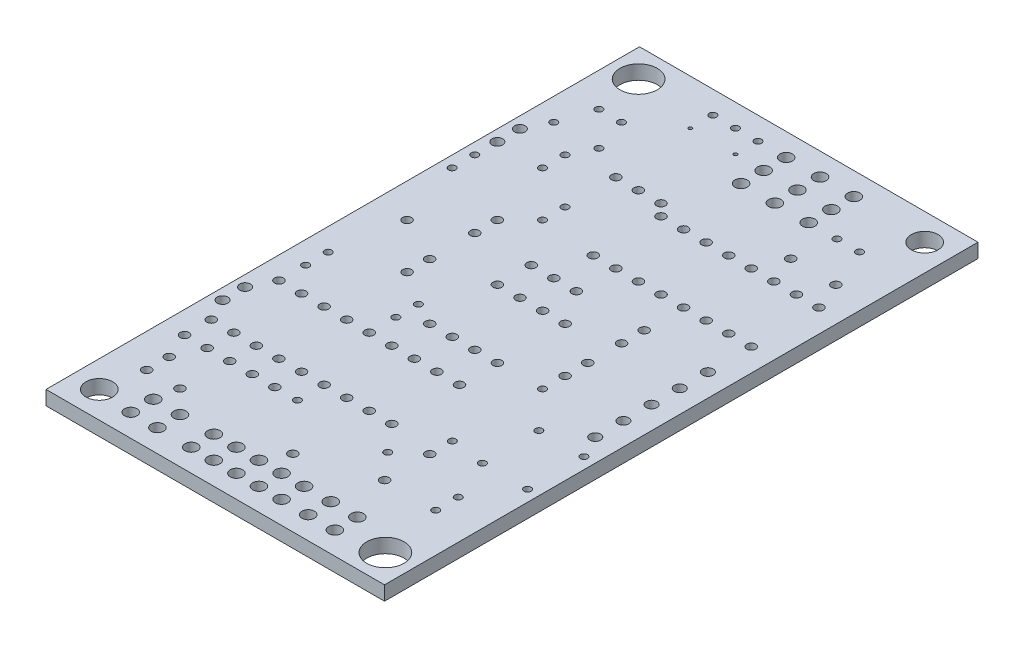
ISO-10303-21;
HEADER;
FILE_DESCRIPTION(('STEP AP214'),'2;1');
FILE_NAME('part.step','',(''),(''),'','','');
FILE_SCHEMA(('AUTOMOTIVE_DESIGN { 1 0 10303 214 1 1 1 1 }'));
ENDSEC;
DATA;
#1=APPLICATION_CONTEXT('core data for automotive mechanical design processes');
#2=APPLICATION_PROTOCOL_DEFINITION('international standard','automotive_design',2000,#1);
#3=PRODUCT_CONTEXT('',#1,'mechanical');
#4=PRODUCT('Part','Part','',(#3));
#5=PRODUCT_RELATED_PRODUCT_CATEGORY('part','',(#4));
#6=PRODUCT_DEFINITION_FORMATION('','',#4);
#7=PRODUCT_DEFINITION_CONTEXT('part definition',#1,'design');
#8=PRODUCT_DEFINITION('design','',#6,#7);
#9=PRODUCT_DEFINITION_SHAPE('','',#8);
#10=(LENGTH_UNIT() NAMED_UNIT(*) SI_UNIT(.MILLI.,.METRE.));
#11=(NAMED_UNIT(*) PLANE_ANGLE_UNIT() SI_UNIT($,.RADIAN.));
#12=(NAMED_UNIT(*) SI_UNIT($,.STERADIAN.) SOLID_ANGLE_UNIT());
#13=UNCERTAINTY_MEASURE_WITH_UNIT(LENGTH_MEASURE(1.E-05),#10,'distance_accuracy_value','');
#14=(GEOMETRIC_REPRESENTATION_CONTEXT(3) GLOBAL_UNCERTAINTY_ASSIGNED_CONTEXT((#13)) GLOBAL_UNIT_ASSIGNED_CONTEXT((#10,
#11,#12)) REPRESENTATION_CONTEXT('',''));
#15=CARTESIAN_POINT('',(0.,0.,0.));
#16=DIRECTION('',(0.,0.,1.));
#17=DIRECTION('',(1.,0.,0.));
#18=AXIS2_PLACEMENT_3D('',#15,#16,#17);
#19=CARTESIAN_POINT('',(0.,1.6,0.));
#20=DIRECTION('',(0.,-1.,0.));
#21=DIRECTION('',(0.,0.,-1.));
#22=AXIS2_PLACEMENT_3D('',#19,#20,#21);
#23=PLANE('',#22);
#24=CARTESIAN_POINT('',(11.4290508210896,1.6,-46.9883999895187));
#25=DIRECTION('',(0.,1.,0.));
#26=DIRECTION('',(0.,0.,1.));
#27=AXIS2_PLACEMENT_3D('',#24,#25,#26);
#28=CIRCLE('',#27,0.399999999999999);
#29=CARTESIAN_POINT('',(11.4290508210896,1.6,-46.5883999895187));
#30=VERTEX_POINT('',#29);
#31=EDGE_CURVE('E946',#30,#30,#28,.T.);
#32=ORIENTED_EDGE('',*,*,#31,.F.);
#33=EDGE_LOOP('',(#32));
#34=FACE_BOUND('',#33,.T.);
#35=CARTESIAN_POINT('',(6.34905082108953,1.6,-58.4218037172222));
#36=DIRECTION('',(0.,1.,0.));
#37=DIRECTION('',(0.,0.,1.));
#38=AXIS2_PLACEMENT_3D('',#35,#36,#37);
#39=CIRCLE('',#38,0.399999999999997);
#40=CARTESIAN_POINT('',(6.34905082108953,1.6,-58.0218037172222));
#41=VERTEX_POINT('',#40);
#42=EDGE_CURVE('E934',#41,#41,#39,.T.);
#43=ORIENTED_EDGE('',*,*,#42,.F.);
#44=EDGE_LOOP('',(#43));
#45=FACE_BOUND('',#44,.T.);
#46=CARTESIAN_POINT('',(8.88905082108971,1.6,-34.2883999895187));
#47=DIRECTION('',(0.,1.,0.));
#48=DIRECTION('',(0.,0.,1.));
#49=AXIS2_PLACEMENT_3D('',#46,#47,#48);
#50=CIRCLE('',#49,0.500000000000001);
#51=CARTESIAN_POINT('',(8.88905082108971,1.6,-33.7883999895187));
#52=VERTEX_POINT('',#51);
#53=EDGE_CURVE('E922',#52,#52,#50,.T.);
#54=ORIENTED_EDGE('',*,*,#53,.F.);
#55=EDGE_LOOP('',(#54));
#56=FACE_BOUND('',#55,.T.);
#57=CARTESIAN_POINT('',(8.8890508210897,1.6,-39.3683999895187));
#58=DIRECTION('',(0.,1.,0.));
#59=DIRECTION('',(0.,0.,1.));
#60=AXIS2_PLACEMENT_3D('',#57,#58,#59);
#61=CIRCLE('',#60,0.500000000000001);
#62=CARTESIAN_POINT('',(8.8890508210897,1.6,-38.8683999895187));
#63=VERTEX_POINT('',#62);
#64=EDGE_CURVE('E910',#63,#63,#61,.T.);
#65=ORIENTED_EDGE('',*,*,#64,.F.);
#66=EDGE_LOOP('',(#65));
#67=FACE_BOUND('',#66,.T.);
#68=CARTESIAN_POINT('',(6.34905082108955,1.6,-49.5283999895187));
#69=DIRECTION('',(0.,1.,0.));
#70=DIRECTION('',(0.,0.,1.));
#71=AXIS2_PLACEMENT_3D('',#68,#69,#70);
#72=CIRCLE('',#71,0.4);
#73=CARTESIAN_POINT('',(6.34905082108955,1.6,-49.1283999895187));
#74=VERTEX_POINT('',#73);
#75=EDGE_CURVE('E898',#74,#74,#72,.T.);
#76=ORIENTED_EDGE('',*,*,#75,.F.);
#77=EDGE_LOOP('',(#76));
#78=FACE_BOUND('',#77,.T.);
#79=CARTESIAN_POINT('',(3.80905082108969,1.6,-36.8283999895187));
#80=DIRECTION('',(0.,1.,0.));
#81=DIRECTION('',(0.,0.,1.));
#82=AXIS2_PLACEMENT_3D('',#79,#80,#81);
#83=CIRCLE('',#82,0.5);
#84=CARTESIAN_POINT('',(3.80905082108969,1.6,-36.3283999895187));
#85=VERTEX_POINT('',#84);
#86=EDGE_CURVE('E886',#85,#85,#83,.T.);
#87=ORIENTED_EDGE('',*,*,#86,.F.);
#88=EDGE_LOOP('',(#87));
#89=FACE_BOUND('',#88,.T.);
#90=CARTESIAN_POINT('',(27.8999999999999,1.6,-39.42));
#91=DIRECTION('',(0.,1.,0.));
#92=DIRECTION('',(0.,0.,1.));
#93=AXIS2_PLACEMENT_3D('',#90,#91,#92);
#94=CIRCLE('',#93,0.500000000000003);
#95=CARTESIAN_POINT('',(27.8999999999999,1.6,-38.92));
#96=VERTEX_POINT('',#95);
#97=EDGE_CURVE('E874',#96,#96,#94,.T.);
#98=ORIENTED_EDGE('',*,*,#97,.F.);
#99=EDGE_LOOP('',(#98));
#100=FACE_BOUND('',#99,.T.);
#101=CARTESIAN_POINT('',(1.26905082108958,1.6,-46.9883999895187));
#102=DIRECTION('',(0.,1.,0.));
#103=DIRECTION('',(0.,0.,1.));
#104=AXIS2_PLACEMENT_3D('',#101,#102,#103);
#105=CIRCLE('',#104,0.399999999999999);
#106=CARTESIAN_POINT('',(1.26905082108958,1.6,-46.5883999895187));
#107=VERTEX_POINT('',#106);
#108=EDGE_CURVE('E862',#107,#107,#105,.T.);
#109=ORIENTED_EDGE('',*,*,#108,.F.);
#110=EDGE_LOOP('',(#109));
#111=FACE_BOUND('',#110,.T.);
#112=CARTESIAN_POINT('',(20.2799999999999,1.6,-39.42));
#113=DIRECTION('',(0.,1.,0.));
#114=DIRECTION('',(0.,0.,1.));
#115=AXIS2_PLACEMENT_3D('',#112,#113,#114);
#116=CIRCLE('',#115,0.499999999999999);
#117=CARTESIAN_POINT('',(20.2799999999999,1.6,-38.92));
#118=VERTEX_POINT('',#117);
#119=EDGE_CURVE('E850',#118,#118,#116,.T.);
#120=ORIENTED_EDGE('',*,*,#119,.F.);
#121=EDGE_LOOP('',(#120));
#122=FACE_BOUND('',#121,.T.);
#123=CARTESIAN_POINT('',(15.1999999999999,1.6,-39.42));
#124=DIRECTION('',(0.,1.,0.));
#125=DIRECTION('',(0.,0.,1.));
#126=AXIS2_PLACEMENT_3D('',#123,#124,#125);
#127=CIRCLE('',#126,0.499999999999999);
#128=CARTESIAN_POINT('',(15.1999999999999,1.6,-38.92));
#129=VERTEX_POINT('',#128);
#130=EDGE_CURVE('E838',#129,#129,#127,.T.);
#131=ORIENTED_EDGE('',*,*,#130,.F.);
#132=EDGE_LOOP('',(#131));
#133=FACE_BOUND('',#132,.T.);
#134=CARTESIAN_POINT('',(16.4699999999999,1.6,-52.75));
#135=DIRECTION('',(0.,1.,0.));
#136=DIRECTION('',(0.,0.,1.));
#137=AXIS2_PLACEMENT_3D('',#134,#135,#136);
#138=CIRCLE('',#137,0.499999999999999);
#139=CARTESIAN_POINT('',(16.4699999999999,1.6,-52.25));
#140=VERTEX_POINT('',#139);
#141=EDGE_CURVE('E826',#140,#140,#138,.T.);
#142=ORIENTED_EDGE('',*,*,#141,.F.);
#143=EDGE_LOOP('',(#142));
#144=FACE_BOUND('',#143,.T.);
#145=CARTESIAN_POINT('',(13.9299999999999,1.6,-52.75));
#146=DIRECTION('',(0.,1.,0.));
#147=DIRECTION('',(0.,0.,1.));
#148=AXIS2_PLACEMENT_3D('',#145,#146,#147);
#149=CIRCLE('',#148,0.499999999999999);
#150=CARTESIAN_POINT('',(13.9299999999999,1.6,-52.25));
#151=VERTEX_POINT('',#150);
#152=EDGE_CURVE('E814',#151,#151,#149,.T.);
#153=ORIENTED_EDGE('',*,*,#152,.F.);
#154=EDGE_LOOP('',(#153));
#155=FACE_BOUND('',#154,.T.);
#156=CARTESIAN_POINT('',(29.1699999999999,1.6,-54.65));
#157=DIRECTION('',(0.,1.,0.));
#158=DIRECTION('',(0.,0.,1.));
#159=AXIS2_PLACEMENT_3D('',#156,#157,#158);
#160=CIRCLE('',#159,0.499999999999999);
#161=CARTESIAN_POINT('',(29.1699999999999,1.6,-54.15));
#162=VERTEX_POINT('',#161);
#163=EDGE_CURVE('E802',#162,#162,#160,.T.);
#164=ORIENTED_EDGE('',*,*,#163,.F.);
#165=EDGE_LOOP('',(#164));
#166=FACE_BOUND('',#165,.T.);
#167=CARTESIAN_POINT('',(19.0500000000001,1.6,-59.1799999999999));
#168=DIRECTION('',(0.,1.,0.));
#169=DIRECTION('',(0.,0.,1.));
#170=AXIS2_PLACEMENT_3D('',#167,#168,#169);
#171=CIRCLE('',#170,0.700000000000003);
#172=CARTESIAN_POINT('',(19.0500000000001,1.6,-58.4799999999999));
#173=VERTEX_POINT('',#172);
#174=EDGE_CURVE('E790',#173,#173,#171,.T.);
#175=ORIENTED_EDGE('',*,*,#174,.F.);
#176=EDGE_LOOP('',(#175));
#177=FACE_BOUND('',#176,.T.);
#178=CARTESIAN_POINT('',(26.6700000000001,1.6,-59.18));
#179=DIRECTION('',(0.,1.,0.));
#180=DIRECTION('',(0.,0.,1.));
#181=AXIS2_PLACEMENT_3D('',#178,#179,#180);
#182=CIRCLE('',#181,0.7);
#183=CARTESIAN_POINT('',(26.6700000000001,1.6,-58.48));
#184=VERTEX_POINT('',#183);
#185=EDGE_CURVE('E778',#184,#184,#182,.T.);
#186=ORIENTED_EDGE('',*,*,#185,.F.);
#187=EDGE_LOOP('',(#186));
#188=FACE_BOUND('',#187,.T.);
#189=CARTESIAN_POINT('',(29.8400000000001,1.6,-59.18));
#190=DIRECTION('',(0.,1.,0.));
#191=DIRECTION('',(0.,0.,1.));
#192=AXIS2_PLACEMENT_3D('',#189,#190,#191);
#193=CIRCLE('',#192,0.400000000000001);
#194=CARTESIAN_POINT('',(29.8400000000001,1.6,-58.78));
#195=VERTEX_POINT('',#194);
#196=EDGE_CURVE('E766',#195,#195,#193,.T.);
#197=ORIENTED_EDGE('',*,*,#196,.F.);
#198=EDGE_LOOP('',(#197));
#199=FACE_BOUND('',#198,.T.);
#200=CARTESIAN_POINT('',(19.05,1.6,-61.7199999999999));
#201=DIRECTION('',(0.,1.,0.));
#202=DIRECTION('',(0.,0.,1.));
#203=AXIS2_PLACEMENT_3D('',#200,#201,#202);
#204=CIRCLE('',#203,0.700000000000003);
#205=CARTESIAN_POINT('',(19.05,1.6,-61.0199999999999));
#206=VERTEX_POINT('',#205);
#207=EDGE_CURVE('E754',#206,#206,#204,.T.);
#208=ORIENTED_EDGE('',*,*,#207,.F.);
#209=EDGE_LOOP('',(#208));
#210=FACE_BOUND('',#209,.T.);
#211=CARTESIAN_POINT('',(26.67,1.6,-61.72));
#212=DIRECTION('',(0.,1.,0.));
#213=DIRECTION('',(0.,0.,1.));
#214=AXIS2_PLACEMENT_3D('',#211,#212,#213);
#215=CIRCLE('',#214,0.7);
#216=CARTESIAN_POINT('',(26.67,1.6,-61.02));
#217=VERTEX_POINT('',#216);
#218=EDGE_CURVE('E742',#217,#217,#215,.T.);
#219=ORIENTED_EDGE('',*,*,#218,.F.);
#220=EDGE_LOOP('',(#219));
#221=FACE_BOUND('',#220,.T.);
#222=CARTESIAN_POINT('',(13.34,1.6,-64.2599999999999));
#223=DIRECTION('',(0.,1.,0.));
#224=DIRECTION('',(0.,0.,1.));
#225=AXIS2_PLACEMENT_3D('',#222,#223,#224);
#226=CIRCLE('',#225,0.399999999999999);
#227=CARTESIAN_POINT('',(13.34,1.6,-63.8599999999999));
#228=VERTEX_POINT('',#227);
#229=EDGE_CURVE('E730',#228,#228,#226,.T.);
#230=ORIENTED_EDGE('',*,*,#229,.F.);
#231=EDGE_LOOP('',(#230));
#232=FACE_BOUND('',#231,.T.);
#233=CARTESIAN_POINT('',(19.05,1.6,-64.2599999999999));
#234=DIRECTION('',(0.,1.,0.));
#235=DIRECTION('',(0.,0.,1.));
#236=AXIS2_PLACEMENT_3D('',#233,#234,#235);
#237=CIRCLE('',#236,0.700000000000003);
#238=CARTESIAN_POINT('',(19.05,1.6,-63.5599999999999));
#239=VERTEX_POINT('',#238);
#240=EDGE_CURVE('E718',#239,#239,#237,.T.);
#241=ORIENTED_EDGE('',*,*,#240,.F.);
#242=EDGE_LOOP('',(#241));
#243=FACE_BOUND('',#242,.T.);
#244=CARTESIAN_POINT('',(26.67,1.6,-64.26));
#245=DIRECTION('',(0.,1.,0.));
#246=DIRECTION('',(0.,0.,1.));
#247=AXIS2_PLACEMENT_3D('',#244,#245,#246);
#248=CIRCLE('',#247,0.7);
#249=CARTESIAN_POINT('',(26.67,1.6,-63.56));
#250=VERTEX_POINT('',#249);
#251=EDGE_CURVE('E706',#250,#250,#248,.T.);
#252=ORIENTED_EDGE('',*,*,#251,.F.);
#253=EDGE_LOOP('',(#252));
#254=FACE_BOUND('',#253,.T.);
#255=CARTESIAN_POINT('',(35.5599999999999,1.6,-35.77));
#256=DIRECTION('',(0.,1.,0.));
#257=DIRECTION('',(0.,0.,1.));
#258=AXIS2_PLACEMENT_3D('',#255,#256,#257);
#259=CIRCLE('',#258,0.599999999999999);
#260=CARTESIAN_POINT('',(35.5599999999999,1.6,-35.17));
#261=VERTEX_POINT('',#260);
#262=EDGE_CURVE('E694',#261,#261,#259,.T.);
#263=ORIENTED_EDGE('',*,*,#262,.F.);
#264=EDGE_LOOP('',(#263));
#265=FACE_BOUND('',#264,.T.);
#266=CARTESIAN_POINT('',(35.5199999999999,1.6,-51.48));
#267=DIRECTION('',(0.,1.,0.));
#268=DIRECTION('',(0.,0.,1.));
#269=AXIS2_PLACEMENT_3D('',#266,#267,#268);
#270=CIRCLE('',#269,0.499999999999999);
#271=CARTESIAN_POINT('',(35.5199999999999,1.6,-50.98));
#272=VERTEX_POINT('',#271);
#273=EDGE_CURVE('E682',#272,#272,#270,.T.);
#274=ORIENTED_EDGE('',*,*,#273,.F.);
#275=EDGE_LOOP('',(#274));
#276=FACE_BOUND('',#275,.T.);
#277=CARTESIAN_POINT('',(30.4399999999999,1.6,-51.48));
#278=DIRECTION('',(0.,1.,0.));
#279=DIRECTION('',(0.,0.,1.));
#280=AXIS2_PLACEMENT_3D('',#277,#278,#279);
#281=CIRCLE('',#280,0.499999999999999);
#282=CARTESIAN_POINT('',(30.4399999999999,1.6,-50.98));
#283=VERTEX_POINT('',#282);
#284=EDGE_CURVE('E670',#283,#283,#281,.T.);
#285=ORIENTED_EDGE('',*,*,#284,.F.);
#286=EDGE_LOOP('',(#285));
#287=FACE_BOUND('',#286,.T.);
#288=CARTESIAN_POINT('',(25.3599999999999,1.6,-51.48));
#289=DIRECTION('',(0.,1.,0.));
#290=DIRECTION('',(0.,0.,1.));
#291=AXIS2_PLACEMENT_3D('',#288,#289,#290);
#292=CIRCLE('',#291,0.499999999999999);
#293=CARTESIAN_POINT('',(25.3599999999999,1.6,-50.98));
#294=VERTEX_POINT('',#293);
#295=EDGE_CURVE('E658',#294,#294,#292,.T.);
#296=ORIENTED_EDGE('',*,*,#295,.F.);
#297=EDGE_LOOP('',(#296));
#298=FACE_BOUND('',#297,.T.);
#299=CARTESIAN_POINT('',(20.2799999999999,1.6,-51.48));
#300=DIRECTION('',(0.,1.,0.));
#301=DIRECTION('',(0.,0.,1.));
#302=AXIS2_PLACEMENT_3D('',#299,#300,#301);
#303=CIRCLE('',#302,0.499999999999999);
#304=CARTESIAN_POINT('',(20.2799999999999,1.6,-50.98));
#305=VERTEX_POINT('',#304);
#306=EDGE_CURVE('E646',#305,#305,#303,.T.);
#307=ORIENTED_EDGE('',*,*,#306,.F.);
#308=EDGE_LOOP('',(#307));
#309=FACE_BOUND('',#308,.T.);
#310=CARTESIAN_POINT('',(35.5199999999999,1.6,-43.86));
#311=DIRECTION('',(0.,1.,0.));
#312=DIRECTION('',(0.,0.,1.));
#313=AXIS2_PLACEMENT_3D('',#310,#311,#312);
#314=CIRCLE('',#313,0.499999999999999);
#315=CARTESIAN_POINT('',(35.5199999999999,1.6,-43.36));
#316=VERTEX_POINT('',#315);
#317=EDGE_CURVE('E634',#316,#316,#314,.T.);
#318=ORIENTED_EDGE('',*,*,#317,.F.);
#319=EDGE_LOOP('',(#318));
#320=FACE_BOUND('',#319,.T.);
#321=CARTESIAN_POINT('',(30.4399999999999,1.6,-43.86));
#322=DIRECTION('',(0.,1.,0.));
#323=DIRECTION('',(0.,0.,1.));
#324=AXIS2_PLACEMENT_3D('',#321,#322,#323);
#325=CIRCLE('',#324,0.499999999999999);
#326=CARTESIAN_POINT('',(30.4399999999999,1.6,-43.36));
#327=VERTEX_POINT('',#326);
#328=EDGE_CURVE('E622',#327,#327,#325,.T.);
#329=ORIENTED_EDGE('',*,*,#328,.F.);
#330=EDGE_LOOP('',(#329));
#331=FACE_BOUND('',#330,.T.);
#332=CARTESIAN_POINT('',(31.75,1.6,-23.72));
#333=DIRECTION('',(0.,1.,0.));
#334=DIRECTION('',(0.,0.,1.));
#335=AXIS2_PLACEMENT_3D('',#332,#333,#334);
#336=CIRCLE('',#335,0.399999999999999);
#337=CARTESIAN_POINT('',(31.75,1.6,-23.32));
#338=VERTEX_POINT('',#337);
#339=EDGE_CURVE('E610',#338,#338,#336,.T.);
#340=ORIENTED_EDGE('',*,*,#339,.F.);
#341=EDGE_LOOP('',(#340));
#342=FACE_BOUND('',#341,.T.);
#343=CARTESIAN_POINT('',(31.75,1.6,-17.37));
#344=DIRECTION('',(0.,1.,0.));
#345=DIRECTION('',(0.,0.,1.));
#346=AXIS2_PLACEMENT_3D('',#343,#344,#345);
#347=CIRCLE('',#346,0.399999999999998);
#348=CARTESIAN_POINT('',(31.75,1.6,-16.97));
#349=VERTEX_POINT('',#348);
#350=EDGE_CURVE('E598',#349,#349,#347,.T.);
#351=ORIENTED_EDGE('',*,*,#350,.F.);
#352=EDGE_LOOP('',(#351));
#353=FACE_BOUND('',#352,.T.);
#354=CARTESIAN_POINT('',(27.8999999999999,1.6,-43.86));
#355=DIRECTION('',(0.,1.,0.));
#356=DIRECTION('',(0.,0.,1.));
#357=AXIS2_PLACEMENT_3D('',#354,#355,#356);
#358=CIRCLE('',#357,0.499999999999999);
#359=CARTESIAN_POINT('',(27.8999999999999,1.6,-43.36));
#360=VERTEX_POINT('',#359);
#361=EDGE_CURVE('E586',#360,#360,#358,.T.);
#362=ORIENTED_EDGE('',*,*,#361,.F.);
#363=EDGE_LOOP('',(#362));
#364=FACE_BOUND('',#363,.T.);
#365=CARTESIAN_POINT('',(22.8199999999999,1.6,-43.86));
#366=DIRECTION('',(0.,1.,0.));
#367=DIRECTION('',(0.,0.,1.));
#368=AXIS2_PLACEMENT_3D('',#365,#366,#367);
#369=CIRCLE('',#368,0.499999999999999);
#370=CARTESIAN_POINT('',(22.8199999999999,1.6,-43.36));
#371=VERTEX_POINT('',#370);
#372=EDGE_CURVE('E574',#371,#371,#369,.T.);
#373=ORIENTED_EDGE('',*,*,#372,.F.);
#374=EDGE_LOOP('',(#373));
#375=FACE_BOUND('',#374,.T.);
#376=CARTESIAN_POINT('',(17.7399999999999,1.6,-43.86));
#377=DIRECTION('',(0.,1.,0.));
#378=DIRECTION('',(0.,0.,1.));
#379=AXIS2_PLACEMENT_3D('',#376,#377,#378);
#380=CIRCLE('',#379,0.499999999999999);
#381=CARTESIAN_POINT('',(17.7399999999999,1.6,-43.36));
#382=VERTEX_POINT('',#381);
#383=EDGE_CURVE('E562',#382,#382,#380,.T.);
#384=ORIENTED_EDGE('',*,*,#383,.F.);
#385=EDGE_LOOP('',(#384));
#386=FACE_BOUND('',#385,.T.);
#387=CARTESIAN_POINT('',(27.8999999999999,1.6,-36.88));
#388=DIRECTION('',(0.,1.,0.));
#389=DIRECTION('',(0.,0.,1.));
#390=AXIS2_PLACEMENT_3D('',#387,#388,#389);
#391=CIRCLE('',#390,0.500000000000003);
#392=CARTESIAN_POINT('',(27.8999999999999,1.6,-36.38));
#393=VERTEX_POINT('',#392);
#394=EDGE_CURVE('E550',#393,#393,#391,.T.);
#395=ORIENTED_EDGE('',*,*,#394,.F.);
#396=EDGE_LOOP('',(#395));
#397=FACE_BOUND('',#396,.T.);
#398=CARTESIAN_POINT('',(27.8999999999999,1.6,-30.53));
#399=DIRECTION('',(0.,1.,0.));
#400=DIRECTION('',(0.,0.,1.));
#401=AXIS2_PLACEMENT_3D('',#398,#399,#400);
#402=CIRCLE('',#401,0.500000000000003);
#403=CARTESIAN_POINT('',(27.8999999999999,1.6,-30.03));
#404=VERTEX_POINT('',#403);
#405=EDGE_CURVE('E538',#404,#404,#402,.T.);
#406=ORIENTED_EDGE('',*,*,#405,.F.);
#407=EDGE_LOOP('',(#406));
#408=FACE_BOUND('',#407,.T.);
#409=CARTESIAN_POINT('',(27.8999999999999,1.6,-27.99));
#410=DIRECTION('',(0.,1.,0.));
#411=DIRECTION('',(0.,0.,1.));
#412=AXIS2_PLACEMENT_3D('',#409,#410,#411);
#413=CIRCLE('',#412,0.400000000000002);
#414=CARTESIAN_POINT('',(27.8999999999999,1.6,-27.59));
#415=VERTEX_POINT('',#414);
#416=EDGE_CURVE('E526',#415,#415,#413,.T.);
#417=ORIENTED_EDGE('',*,*,#416,.F.);
#418=EDGE_LOOP('',(#417));
#419=FACE_BOUND('',#418,.T.);
#420=CARTESIAN_POINT('',(27.9000000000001,1.6,-15.29));
#421=DIRECTION('',(0.,1.,0.));
#422=DIRECTION('',(0.,0.,1.));
#423=AXIS2_PLACEMENT_3D('',#420,#421,#422);
#424=CIRCLE('',#423,0.500000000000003);
#425=CARTESIAN_POINT('',(27.9000000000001,1.6,-14.79));
#426=VERTEX_POINT('',#425);
#427=EDGE_CURVE('E514',#426,#426,#424,.T.);
#428=ORIENTED_EDGE('',*,*,#427,.F.);
#429=EDGE_LOOP('',(#428));
#430=FACE_BOUND('',#429,.T.);
#431=CARTESIAN_POINT('',(22.82,1.6,-23.72));
#432=DIRECTION('',(0.,1.,0.));
#433=DIRECTION('',(0.,0.,1.));
#434=AXIS2_PLACEMENT_3D('',#431,#432,#433);
#435=CIRCLE('',#434,0.499999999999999);
#436=CARTESIAN_POINT('',(22.82,1.6,-23.22));
#437=VERTEX_POINT('',#436);
#438=EDGE_CURVE('E502',#437,#437,#435,.T.);
#439=ORIENTED_EDGE('',*,*,#438,.F.);
#440=EDGE_LOOP('',(#439));
#441=FACE_BOUND('',#440,.T.);
#442=CARTESIAN_POINT('',(25.36,1.6,-13.1));
#443=DIRECTION('',(0.,1.,0.));
#444=DIRECTION('',(0.,0.,1.));
#445=AXIS2_PLACEMENT_3D('',#442,#443,#444);
#446=CIRCLE('',#445,0.400000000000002);
#447=CARTESIAN_POINT('',(25.36,1.6,-12.7));
#448=VERTEX_POINT('',#447);
#449=EDGE_CURVE('E490',#448,#448,#446,.T.);
#450=ORIENTED_EDGE('',*,*,#449,.F.);
#451=EDGE_LOOP('',(#450));
#452=FACE_BOUND('',#451,.T.);
#453=CARTESIAN_POINT('',(20.28,1.6,-23.72));
#454=DIRECTION('',(0.,1.,0.));
#455=DIRECTION('',(0.,0.,1.));
#456=AXIS2_PLACEMENT_3D('',#453,#454,#455);
#457=CIRCLE('',#456,0.499999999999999);
#458=CARTESIAN_POINT('',(20.28,1.6,-23.22));
#459=VERTEX_POINT('',#458);
#460=EDGE_CURVE('E478',#459,#459,#457,.T.);
#461=ORIENTED_EDGE('',*,*,#460,.F.);
#462=EDGE_LOOP('',(#461));
#463=FACE_BOUND('',#462,.T.);
#464=CARTESIAN_POINT('',(3.77000000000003,1.6,-10.1));
#465=DIRECTION('',(0.,1.,0.));
#466=DIRECTION('',(0.,0.,1.));
#467=AXIS2_PLACEMENT_3D('',#464,#465,#466);
#468=CIRCLE('',#467,0.5);
#469=CARTESIAN_POINT('',(3.77000000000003,1.6,-9.6));
#470=VERTEX_POINT('',#469);
#471=EDGE_CURVE('E466',#470,#470,#468,.T.);
#472=ORIENTED_EDGE('',*,*,#471,.F.);
#473=EDGE_LOOP('',(#472));
#474=FACE_BOUND('',#473,.T.);
#475=CARTESIAN_POINT('',(17.74,1.6,-23.72));
#476=DIRECTION('',(0.,1.,0.));
#477=DIRECTION('',(0.,0.,1.));
#478=AXIS2_PLACEMENT_3D('',#475,#476,#477);
#479=CIRCLE('',#478,0.499999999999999);
#480=CARTESIAN_POINT('',(17.74,1.6,-23.22));
#481=VERTEX_POINT('',#480);
#482=EDGE_CURVE('E454',#481,#481,#479,.T.);
#483=ORIENTED_EDGE('',*,*,#482,.F.);
#484=EDGE_LOOP('',(#483));
#485=FACE_BOUND('',#484,.T.);
#486=CARTESIAN_POINT('',(17.74,1.6,-16.1));
#487=DIRECTION('',(0.,1.,0.));
#488=DIRECTION('',(0.,0.,1.));
#489=AXIS2_PLACEMENT_3D('',#486,#487,#488);
#490=CIRCLE('',#489,0.500000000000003);
#491=CARTESIAN_POINT('',(17.74,1.6,-15.6));
#492=VERTEX_POINT('',#491);
#493=EDGE_CURVE('E442',#492,#492,#490,.T.);
#494=ORIENTED_EDGE('',*,*,#493,.F.);
#495=EDGE_LOOP('',(#494));
#496=FACE_BOUND('',#495,.T.);
#497=CARTESIAN_POINT('',(15.2,1.6,-23.72));
#498=DIRECTION('',(0.,1.,0.));
#499=DIRECTION('',(0.,0.,1.));
#500=AXIS2_PLACEMENT_3D('',#497,#498,#499);
#501=CIRCLE('',#500,0.499999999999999);
#502=CARTESIAN_POINT('',(15.2,1.6,-23.22));
#503=VERTEX_POINT('',#502);
#504=EDGE_CURVE('E430',#503,#503,#501,.T.);
#505=ORIENTED_EDGE('',*,*,#504,.F.);
#506=EDGE_LOOP('',(#505));
#507=FACE_BOUND('',#506,.T.);
#508=CARTESIAN_POINT('',(22.8199999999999,1.6,-35.61));
#509=DIRECTION('',(0.,1.,0.));
#510=DIRECTION('',(0.,0.,1.));
#511=AXIS2_PLACEMENT_3D('',#508,#509,#510);
#512=CIRCLE('',#511,0.499999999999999);
#513=CARTESIAN_POINT('',(22.8199999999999,1.6,-35.11));
#514=VERTEX_POINT('',#513);
#515=EDGE_CURVE('E418',#514,#514,#512,.T.);
#516=ORIENTED_EDGE('',*,*,#515,.F.);
#517=EDGE_LOOP('',(#516));
#518=FACE_BOUND('',#517,.T.);
#519=CARTESIAN_POINT('',(15.2,1.6,-13.1));
#520=DIRECTION('',(0.,1.,0.));
#521=DIRECTION('',(0.,0.,1.));
#522=AXIS2_PLACEMENT_3D('',#519,#520,#521);
#523=CIRCLE('',#522,0.399999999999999);
#524=CARTESIAN_POINT('',(15.2,1.6,-12.7));
#525=VERTEX_POINT('',#524);
#526=EDGE_CURVE('E406',#525,#525,#523,.T.);
#527=ORIENTED_EDGE('',*,*,#526,.F.);
#528=EDGE_LOOP('',(#527));
#529=FACE_BOUND('',#528,.T.);
#530=CARTESIAN_POINT('',(12.6599999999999,1.6,-29.26));
#531=DIRECTION('',(0.,1.,0.));
#532=DIRECTION('',(0.,0.,1.));
#533=AXIS2_PLACEMENT_3D('',#530,#531,#532);
#534=CIRCLE('',#533,0.4);
#535=CARTESIAN_POINT('',(12.6599999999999,1.6,-28.86));
#536=VERTEX_POINT('',#535);
#537=EDGE_CURVE('E394',#536,#536,#534,.T.);
#538=ORIENTED_EDGE('',*,*,#537,.F.);
#539=EDGE_LOOP('',(#538));
#540=FACE_BOUND('',#539,.T.);
#541=CARTESIAN_POINT('',(12.66,1.6,-16.1));
#542=DIRECTION('',(0.,1.,0.));
#543=DIRECTION('',(0.,0.,1.));
#544=AXIS2_PLACEMENT_3D('',#541,#542,#543);
#545=CIRCLE('',#544,0.499999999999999);
#546=CARTESIAN_POINT('',(12.66,1.6,-15.6));
#547=VERTEX_POINT('',#546);
#548=EDGE_CURVE('E382',#547,#547,#545,.T.);
#549=ORIENTED_EDGE('',*,*,#548,.F.);
#550=EDGE_LOOP('',(#549));
#551=FACE_BOUND('',#550,.T.);
#552=CARTESIAN_POINT('',(10.12,1.6,-23.72));
#553=DIRECTION('',(0.,1.,0.));
#554=DIRECTION('',(0.,0.,1.));
#555=AXIS2_PLACEMENT_3D('',#552,#553,#554);
#556=CIRCLE('',#555,0.500000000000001);
#557=CARTESIAN_POINT('',(10.12,1.6,-23.22));
#558=VERTEX_POINT('',#557);
#559=EDGE_CURVE('E370',#558,#558,#556,.T.);
#560=ORIENTED_EDGE('',*,*,#559,.F.);
#561=EDGE_LOOP('',(#560));
#562=FACE_BOUND('',#561,.T.);
#563=CARTESIAN_POINT('',(20.2799999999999,1.6,-35.61));
#564=DIRECTION('',(0.,1.,0.));
#565=DIRECTION('',(0.,0.,1.));
#566=AXIS2_PLACEMENT_3D('',#563,#564,#565);
#567=CIRCLE('',#566,0.499999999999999);
#568=CARTESIAN_POINT('',(20.2799999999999,1.6,-35.11));
#569=VERTEX_POINT('',#568);
#570=EDGE_CURVE('E358',#569,#569,#567,.T.);
#571=ORIENTED_EDGE('',*,*,#570,.F.);
#572=EDGE_LOOP('',(#571));
#573=FACE_BOUND('',#572,.T.);
#574=CARTESIAN_POINT('',(10.12,1.6,-13.1));
#575=DIRECTION('',(0.,1.,0.));
#576=DIRECTION('',(0.,0.,1.));
#577=AXIS2_PLACEMENT_3D('',#574,#575,#576);
#578=CIRCLE('',#577,0.499999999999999);
#579=CARTESIAN_POINT('',(10.12,1.6,-12.6));
#580=VERTEX_POINT('',#579);
#581=EDGE_CURVE('E346',#580,#580,#578,.T.);
#582=ORIENTED_EDGE('',*,*,#581,.F.);
#583=EDGE_LOOP('',(#582));
#584=FACE_BOUND('',#583,.T.);
#585=CARTESIAN_POINT('',(17.7399999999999,1.6,-27.99));
#586=DIRECTION('',(0.,1.,0.));
#587=DIRECTION('',(0.,0.,1.));
#588=AXIS2_PLACEMENT_3D('',#585,#586,#587);
#589=CIRCLE('',#588,0.500000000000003);
#590=CARTESIAN_POINT('',(17.7399999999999,1.6,-27.49));
#591=VERTEX_POINT('',#590);
#592=EDGE_CURVE('E334',#591,#591,#589,.T.);
#593=ORIENTED_EDGE('',*,*,#592,.F.);
#594=EDGE_LOOP('',(#593));
#595=FACE_BOUND('',#594,.T.);
#596=CARTESIAN_POINT('',(15.1999999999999,1.6,-27.99));
#597=DIRECTION('',(0.,1.,0.));
#598=DIRECTION('',(0.,0.,1.));
#599=AXIS2_PLACEMENT_3D('',#596,#597,#598);
#600=CIRCLE('',#599,0.500000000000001);
#601=CARTESIAN_POINT('',(15.1999999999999,1.6,-27.49));
#602=VERTEX_POINT('',#601);
#603=EDGE_CURVE('E322',#602,#602,#600,.T.);
#604=ORIENTED_EDGE('',*,*,#603,.F.);
#605=EDGE_LOOP('',(#604));
#606=FACE_BOUND('',#605,.T.);
#607=CARTESIAN_POINT('',(7.58,1.6,-13.1));
#608=DIRECTION('',(0.,1.,0.));
#609=DIRECTION('',(0.,0.,1.));
#610=AXIS2_PLACEMENT_3D('',#607,#608,#609);
#611=CIRCLE('',#610,0.500000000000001);
#612=CARTESIAN_POINT('',(7.58,1.6,-12.6));
#613=VERTEX_POINT('',#612);
#614=EDGE_CURVE('E310',#613,#613,#611,.T.);
#615=ORIENTED_EDGE('',*,*,#614,.F.);
#616=EDGE_LOOP('',(#615));
#617=FACE_BOUND('',#616,.T.);
#618=CARTESIAN_POINT('',(15.1999999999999,1.6,-35.61));
#619=DIRECTION('',(0.,1.,0.));
#620=DIRECTION('',(0.,0.,1.));
#621=AXIS2_PLACEMENT_3D('',#618,#619,#620);
#622=CIRCLE('',#621,0.499999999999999);
#623=CARTESIAN_POINT('',(15.1999999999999,1.6,-35.11));
#624=VERTEX_POINT('',#623);
#625=EDGE_CURVE('E298',#624,#624,#622,.T.);
#626=ORIENTED_EDGE('',*,*,#625,.F.);
#627=EDGE_LOOP('',(#626));
#628=FACE_BOUND('',#627,.T.);
#629=CARTESIAN_POINT('',(2.49999999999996,1.6,-23.72));
#630=DIRECTION('',(0.,1.,0.));
#631=DIRECTION('',(0.,0.,1.));
#632=AXIS2_PLACEMENT_3D('',#629,#630,#631);
#633=CIRCLE('',#632,0.5);
#634=CARTESIAN_POINT('',(2.49999999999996,1.6,-23.22));
#635=VERTEX_POINT('',#634);
#636=EDGE_CURVE('E286',#635,#635,#633,.T.);
#637=ORIENTED_EDGE('',*,*,#636,.F.);
#638=EDGE_LOOP('',(#637));
#639=FACE_BOUND('',#638,.T.);
#640=CARTESIAN_POINT('',(2.49999999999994,1.6,-29.26));
#641=DIRECTION('',(0.,1.,0.));
#642=DIRECTION('',(0.,0.,1.));
#643=AXIS2_PLACEMENT_3D('',#640,#641,#642);
#644=CIRCLE('',#643,0.400000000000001);
#645=CARTESIAN_POINT('',(2.49999999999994,1.6,-28.86));
#646=VERTEX_POINT('',#645);
#647=EDGE_CURVE('E274',#646,#646,#644,.T.);
#648=ORIENTED_EDGE('',*,*,#647,.F.);
#649=EDGE_LOOP('',(#648));
#650=FACE_BOUND('',#649,.T.);
#651=CARTESIAN_POINT('',(2.49999999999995,1.6,-26.72));
#652=DIRECTION('',(0.,1.,0.));
#653=DIRECTION('',(0.,0.,1.));
#654=AXIS2_PLACEMENT_3D('',#651,#652,#653);
#655=CIRCLE('',#654,0.400000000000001);
#656=CARTESIAN_POINT('',(2.49999999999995,1.6,-26.32));
#657=VERTEX_POINT('',#656);
#658=EDGE_CURVE('E262',#657,#657,#655,.T.);
#659=ORIENTED_EDGE('',*,*,#658,.F.);
#660=EDGE_LOOP('',(#659));
#661=FACE_BOUND('',#660,.T.);
#662=CARTESIAN_POINT('',(2.49999999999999,1.6,-16.1));
#663=DIRECTION('',(0.,1.,0.));
#664=DIRECTION('',(0.,0.,1.));
#665=AXIS2_PLACEMENT_3D('',#662,#663,#664);
#666=CIRCLE('',#665,0.5);
#667=CARTESIAN_POINT('',(2.49999999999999,1.6,-15.6));
#668=VERTEX_POINT('',#667);
#669=EDGE_CURVE('E250',#668,#668,#666,.T.);
#670=ORIENTED_EDGE('',*,*,#669,.F.);
#671=EDGE_LOOP('',(#670));
#672=FACE_BOUND('',#671,.T.);
#673=CARTESIAN_POINT('',(29.97,1.6,-5.08));
#674=DIRECTION('',(0.,1.,0.));
#675=DIRECTION('',(0.,0.,1.));
#676=AXIS2_PLACEMENT_3D('',#673,#674,#675);
#677=CIRCLE('',#676,0.700000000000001);
#678=CARTESIAN_POINT('',(29.97,1.6,-4.38));
#679=VERTEX_POINT('',#678);
#680=EDGE_CURVE('E238',#679,#679,#677,.T.);
#681=ORIENTED_EDGE('',*,*,#680,.F.);
#682=EDGE_LOOP('',(#681));
#683=FACE_BOUND('',#682,.T.);
#684=CARTESIAN_POINT('',(23.97,1.6,-5.08));
#685=DIRECTION('',(0.,1.,0.));
#686=DIRECTION('',(0.,0.,1.));
#687=AXIS2_PLACEMENT_3D('',#684,#685,#686);
#688=CIRCLE('',#687,0.700000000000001);
#689=CARTESIAN_POINT('',(23.97,1.6,-4.38));
#690=VERTEX_POINT('',#689);
#691=EDGE_CURVE('E226',#690,#690,#688,.T.);
#692=ORIENTED_EDGE('',*,*,#691,.F.);
#693=EDGE_LOOP('',(#692));
#694=FACE_BOUND('',#693,.T.);
#695=CARTESIAN_POINT('',(18.89,1.6,-5.08));
#696=DIRECTION('',(0.,1.,0.));
#697=DIRECTION('',(0.,0.,1.));
#698=AXIS2_PLACEMENT_3D('',#695,#696,#697);
#699=CIRCLE('',#698,0.699999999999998);
#700=CARTESIAN_POINT('',(18.89,1.6,-4.38));
#701=VERTEX_POINT('',#700);
#702=EDGE_CURVE('E214',#701,#701,#699,.T.);
#703=ORIENTED_EDGE('',*,*,#702,.F.);
#704=EDGE_LOOP('',(#703));
#705=FACE_BOUND('',#704,.T.);
#706=CARTESIAN_POINT('',(13.81,1.6,-5.08));
#707=DIRECTION('',(0.,1.,0.));
#708=DIRECTION('',(0.,0.,1.));
#709=AXIS2_PLACEMENT_3D('',#706,#707,#708);
#710=CIRCLE('',#709,0.699999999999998);
#711=CARTESIAN_POINT('',(13.81,1.6,-4.38));
#712=VERTEX_POINT('',#711);
#713=EDGE_CURVE('E202',#712,#712,#710,.T.);
#714=ORIENTED_EDGE('',*,*,#713,.F.);
#715=EDGE_LOOP('',(#714));
#716=FACE_BOUND('',#715,.T.);
#717=CARTESIAN_POINT('',(6.99999999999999,1.6,-5.08));
#718=DIRECTION('',(0.,1.,0.));
#719=DIRECTION('',(0.,0.,1.));
#720=AXIS2_PLACEMENT_3D('',#717,#718,#719);
#721=CIRCLE('',#720,0.7);
#722=CARTESIAN_POINT('',(6.99999999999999,1.6,-4.38));
#723=VERTEX_POINT('',#722);
#724=EDGE_CURVE('E190',#723,#723,#721,.T.);
#725=ORIENTED_EDGE('',*,*,#724,.F.);
#726=EDGE_LOOP('',(#725));
#727=FACE_BOUND('',#726,.T.);
#728=CARTESIAN_POINT('',(26.97,1.6,-2.54));
#729=DIRECTION('',(0.,1.,0.));
#730=DIRECTION('',(0.,0.,1.));
#731=AXIS2_PLACEMENT_3D('',#728,#729,#730);
#732=CIRCLE('',#731,0.700000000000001);
#733=CARTESIAN_POINT('',(26.97,1.6,-1.84));
#734=VERTEX_POINT('',#733);
#735=EDGE_CURVE('E178',#734,#734,#732,.T.);
#736=ORIENTED_EDGE('',*,*,#735,.F.);
#737=EDGE_LOOP('',(#736));
#738=FACE_BOUND('',#737,.T.);
#739=CARTESIAN_POINT('',(21.43,1.6,-2.54));
#740=DIRECTION('',(0.,1.,0.));
#741=DIRECTION('',(0.,0.,1.));
#742=AXIS2_PLACEMENT_3D('',#739,#740,#741);
#743=CIRCLE('',#742,0.700000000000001);
#744=CARTESIAN_POINT('',(21.43,1.6,-1.84));
#745=VERTEX_POINT('',#744);
#746=EDGE_CURVE('E166',#745,#745,#743,.T.);
#747=ORIENTED_EDGE('',*,*,#746,.F.);
#748=EDGE_LOOP('',(#747));
#749=FACE_BOUND('',#748,.T.);
#750=CARTESIAN_POINT('',(16.35,1.6,-2.54));
#751=DIRECTION('',(0.,1.,0.));
#752=DIRECTION('',(0.,0.,1.));
#753=AXIS2_PLACEMENT_3D('',#750,#751,#752);
#754=CIRCLE('',#753,0.699999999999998);
#755=CARTESIAN_POINT('',(16.35,1.6,-1.84));
#756=VERTEX_POINT('',#755);
#757=EDGE_CURVE('E154',#756,#756,#754,.T.);
#758=ORIENTED_EDGE('',*,*,#757,.F.);
#759=EDGE_LOOP('',(#758));
#760=FACE_BOUND('',#759,.T.);
#761=CARTESIAN_POINT('',(10.,1.6,-2.54));
#762=DIRECTION('',(0.,1.,0.));
#763=DIRECTION('',(0.,0.,1.));
#764=AXIS2_PLACEMENT_3D('',#761,#762,#763);
#765=CIRCLE('',#764,0.7);
#766=CARTESIAN_POINT('',(10.,1.6,-1.84));
#767=VERTEX_POINT('',#766);
#768=EDGE_CURVE('E142',#767,#767,#765,.T.);
#769=ORIENTED_EDGE('',*,*,#768,.F.);
#770=EDGE_LOOP('',(#769));
#771=FACE_BOUND('',#770,.T.);
#772=CARTESIAN_POINT('',(35.1,1.6,-63.8));
#773=DIRECTION('',(0.,1.,0.));
#774=DIRECTION('',(0.,0.,1.));
#775=AXIS2_PLACEMENT_3D('',#772,#773,#774);
#776=CIRCLE('',#775,1.5);
#777=CARTESIAN_POINT('',(35.1,1.6,-62.3));
#778=VERTEX_POINT('',#777);
#779=EDGE_CURVE('E130',#778,#778,#776,.T.);
#780=ORIENTED_EDGE('',*,*,#779,.F.);
#781=EDGE_LOOP('',(#780));
#782=FACE_BOUND('',#781,.T.);
#783=CARTESIAN_POINT('',(35.,1.6,-3.2));
#784=DIRECTION('',(0.,1.,0.));
#785=DIRECTION('',(0.,0.,1.));
#786=AXIS2_PLACEMENT_3D('',#783,#784,#785);
#787=CIRCLE('',#786,2.1);
#788=CARTESIAN_POINT('',(35.,1.6,-1.1));
#789=VERTEX_POINT('',#788);
#790=EDGE_CURVE('E118',#789,#789,#787,.T.);
#791=ORIENTED_EDGE('',*,*,#790,.F.);
#792=EDGE_LOOP('',(#791));
#793=FACE_BOUND('',#792,.T.);
#794=DIRECTION('',(0.,0.,1.));
#795=VECTOR('',#794,1.);
#796=CARTESIAN_POINT('',(0.,1.6,0.));
#797=LINE('',#796,#795);
#798=CARTESIAN_POINT('',(0.,1.6,-66.8));
#799=VERTEX_POINT('',#798);
#800=CARTESIAN_POINT('',(0.,1.6,0.));
#801=VERTEX_POINT('',#800);
#802=EDGE_CURVE('E88',#799,#801,#797,.T.);
#803=ORIENTED_EDGE('',*,*,#802,.T.);
#804=DIRECTION('',(1.,0.,0.));
#805=VECTOR('',#804,1.);
#806=CARTESIAN_POINT('',(0.,1.6,0.));
#807=LINE('',#806,#805);
#808=CARTESIAN_POINT('',(38.1,1.6,0.));
#809=VERTEX_POINT('',#808);
#810=EDGE_CURVE('E83',#801,#809,#807,.T.);
#811=ORIENTED_EDGE('',*,*,#810,.T.);
#812=DIRECTION('',(0.,0.,-1.));
#813=VECTOR('',#812,1.);
#814=CARTESIAN_POINT('',(38.1,1.6,0.));
#815=LINE('',#814,#813);
#816=CARTESIAN_POINT('',(38.1,1.6,-66.8));
#817=VERTEX_POINT('',#816);
#818=EDGE_CURVE('E86',#809,#817,#815,.T.);
#819=ORIENTED_EDGE('',*,*,#818,.T.);
#820=DIRECTION('',(-1.,0.,0.));
#821=VECTOR('',#820,1.);
#822=CARTESIAN_POINT('',(0.,1.6,-66.8));
#823=LINE('',#822,#821);
#824=EDGE_CURVE('E53',#817,#799,#823,.T.);
#825=ORIENTED_EDGE('',*,*,#824,.T.);
#826=EDGE_LOOP('',(#803,#811,#819,#825));
#827=FACE_BOUND('',#826,.T.);
#828=CARTESIAN_POINT('',(3.,1.6,-3.));
#829=DIRECTION('',(0.,1.,0.));
#830=DIRECTION('',(0.,0.,1.));
#831=AXIS2_PLACEMENT_3D('',#828,#829,#830);
#832=CIRCLE('',#831,1.5);
#833=CARTESIAN_POINT('',(3.,1.6,-1.5));
#834=VERTEX_POINT('',#833);
#835=EDGE_CURVE('E103',#834,#834,#832,.T.);
#836=ORIENTED_EDGE('',*,*,#835,.F.);
#837=EDGE_LOOP('',(#836));
#838=FACE_BOUND('',#837,.T.);
#839=CARTESIAN_POINT('',(3.1,1.6,-63.6));
#840=DIRECTION('',(0.,1.,0.));
#841=DIRECTION('',(0.,0.,1.));
#842=AXIS2_PLACEMENT_3D('',#839,#840,#841);
#843=CIRCLE('',#842,2.09999999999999);
#844=CARTESIAN_POINT('',(3.1,1.6,-61.5));
#845=VERTEX_POINT('',#844);
#846=EDGE_CURVE('E124',#845,#845,#843,.T.);
#847=ORIENTED_EDGE('',*,*,#846,.F.);
#848=EDGE_LOOP('',(#847));
#849=FACE_BOUND('',#848,.T.);
#850=CARTESIAN_POINT('',(7.,1.6,-2.54));
#851=DIRECTION('',(0.,1.,0.));
#852=DIRECTION('',(0.,0.,1.));
#853=AXIS2_PLACEMENT_3D('',#850,#851,#852);
#854=CIRCLE('',#853,0.700000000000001);
#855=CARTESIAN_POINT('',(7.,1.6,-1.84));
#856=VERTEX_POINT('',#855);
#857=EDGE_CURVE('E136',#856,#856,#854,.T.);
#858=ORIENTED_EDGE('',*,*,#857,.F.);
#859=EDGE_LOOP('',(#858));
#860=FACE_BOUND('',#859,.T.);
#861=CARTESIAN_POINT('',(13.81,1.6,-2.54));
#862=DIRECTION('',(0.,1.,0.));
#863=DIRECTION('',(0.,0.,1.));
#864=AXIS2_PLACEMENT_3D('',#861,#862,#863);
#865=CIRCLE('',#864,0.699999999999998);
#866=CARTESIAN_POINT('',(13.81,1.6,-1.84));
#867=VERTEX_POINT('',#866);
#868=EDGE_CURVE('E148',#867,#867,#865,.T.);
#869=ORIENTED_EDGE('',*,*,#868,.F.);
#870=EDGE_LOOP('',(#869));
#871=FACE_BOUND('',#870,.T.);
#872=CARTESIAN_POINT('',(18.89,1.6,-2.54));
#873=DIRECTION('',(0.,1.,0.));
#874=DIRECTION('',(0.,0.,1.));
#875=AXIS2_PLACEMENT_3D('',#872,#873,#874);
#876=CIRCLE('',#875,0.699999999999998);
#877=CARTESIAN_POINT('',(18.89,1.6,-1.84));
#878=VERTEX_POINT('',#877);
#879=EDGE_CURVE('E160',#878,#878,#876,.T.);
#880=ORIENTED_EDGE('',*,*,#879,.F.);
#881=EDGE_LOOP('',(#880));
#882=FACE_BOUND('',#881,.T.);
#883=CARTESIAN_POINT('',(23.97,1.6,-2.54));
#884=DIRECTION('',(0.,1.,0.));
#885=DIRECTION('',(0.,0.,1.));
#886=AXIS2_PLACEMENT_3D('',#883,#884,#885);
#887=CIRCLE('',#886,0.700000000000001);
#888=CARTESIAN_POINT('',(23.97,1.6,-1.84));
#889=VERTEX_POINT('',#888);
#890=EDGE_CURVE('E172',#889,#889,#887,.T.);
#891=ORIENTED_EDGE('',*,*,#890,.F.);
#892=EDGE_LOOP('',(#891));
#893=FACE_BOUND('',#892,.T.);
#894=CARTESIAN_POINT('',(29.97,1.6,-2.54));
#895=DIRECTION('',(0.,1.,0.));
#896=DIRECTION('',(0.,0.,1.));
#897=AXIS2_PLACEMENT_3D('',#894,#895,#896);
#898=CIRCLE('',#897,0.700000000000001);
#899=CARTESIAN_POINT('',(29.97,1.6,-1.84));
#900=VERTEX_POINT('',#899);
#901=EDGE_CURVE('E184',#900,#900,#898,.T.);
#902=ORIENTED_EDGE('',*,*,#901,.F.);
#903=EDGE_LOOP('',(#902));
#904=FACE_BOUND('',#903,.T.);
#905=CARTESIAN_POINT('',(9.99999999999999,1.6,-5.08));
#906=DIRECTION('',(0.,1.,0.));
#907=DIRECTION('',(0.,0.,1.));
#908=AXIS2_PLACEMENT_3D('',#905,#906,#907);
#909=CIRCLE('',#908,0.7);
#910=CARTESIAN_POINT('',(9.99999999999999,1.6,-4.38));
#911=VERTEX_POINT('',#910);
#912=EDGE_CURVE('E196',#911,#911,#909,.T.);
#913=ORIENTED_EDGE('',*,*,#912,.F.);
#914=EDGE_LOOP('',(#913));
#915=FACE_BOUND('',#914,.T.);
#916=CARTESIAN_POINT('',(16.35,1.6,-5.08));
#917=DIRECTION('',(0.,1.,0.));
#918=DIRECTION('',(0.,0.,1.));
#919=AXIS2_PLACEMENT_3D('',#916,#917,#918);
#920=CIRCLE('',#919,0.699999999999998);
#921=CARTESIAN_POINT('',(16.35,1.6,-4.38));
#922=VERTEX_POINT('',#921);
#923=EDGE_CURVE('E208',#922,#922,#920,.T.);
#924=ORIENTED_EDGE('',*,*,#923,.F.);
#925=EDGE_LOOP('',(#924));
#926=FACE_BOUND('',#925,.T.);
#927=CARTESIAN_POINT('',(21.43,1.6,-5.08));
#928=DIRECTION('',(0.,1.,0.));
#929=DIRECTION('',(0.,0.,1.));
#930=AXIS2_PLACEMENT_3D('',#927,#928,#929);
#931=CIRCLE('',#930,0.700000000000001);
#932=CARTESIAN_POINT('',(21.43,1.6,-4.38));
#933=VERTEX_POINT('',#932);
#934=EDGE_CURVE('E220',#933,#933,#931,.T.);
#935=ORIENTED_EDGE('',*,*,#934,.F.);
#936=EDGE_LOOP('',(#935));
#937=FACE_BOUND('',#936,.T.);
#938=CARTESIAN_POINT('',(26.97,1.6,-5.08));
#939=DIRECTION('',(0.,1.,0.));
#940=DIRECTION('',(0.,0.,1.));
#941=AXIS2_PLACEMENT_3D('',#938,#939,#940);
#942=CIRCLE('',#941,0.700000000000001);
#943=CARTESIAN_POINT('',(26.97,1.6,-4.38));
#944=VERTEX_POINT('',#943);
#945=EDGE_CURVE('E232',#944,#944,#942,.T.);
#946=ORIENTED_EDGE('',*,*,#945,.F.);
#947=EDGE_LOOP('',(#946));
#948=FACE_BOUND('',#947,.T.);
#949=CARTESIAN_POINT('',(2.5,1.6,-13.1));
#950=DIRECTION('',(0.,1.,0.));
#951=DIRECTION('',(0.,0.,1.));
#952=AXIS2_PLACEMENT_3D('',#949,#950,#951);
#953=CIRCLE('',#952,0.5);
#954=CARTESIAN_POINT('',(2.5,1.6,-12.6));
#955=VERTEX_POINT('',#954);
#956=EDGE_CURVE('E244',#955,#955,#953,.T.);
#957=ORIENTED_EDGE('',*,*,#956,.F.);
#958=EDGE_LOOP('',(#957));
#959=FACE_BOUND('',#958,.T.);
#960=CARTESIAN_POINT('',(1.22999999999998,1.6,-18.64));
#961=DIRECTION('',(0.,1.,0.));
#962=DIRECTION('',(0.,0.,1.));
#963=AXIS2_PLACEMENT_3D('',#960,#961,#962);
#964=CIRCLE('',#963,0.6);
#965=CARTESIAN_POINT('',(1.22999999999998,1.6,-18.04));
#966=VERTEX_POINT('',#965);
#967=EDGE_CURVE('E256',#966,#966,#964,.T.);
#968=ORIENTED_EDGE('',*,*,#967,.F.);
#969=EDGE_LOOP('',(#968));
#970=FACE_BOUND('',#969,.T.);
#971=CARTESIAN_POINT('',(1.22999999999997,1.6,-21.18));
#972=DIRECTION('',(0.,1.,0.));
#973=DIRECTION('',(0.,0.,1.));
#974=AXIS2_PLACEMENT_3D('',#971,#972,#973);
#975=CIRCLE('',#974,0.6);
#976=CARTESIAN_POINT('',(1.22999999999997,1.6,-20.58));
#977=VERTEX_POINT('',#976);
#978=EDGE_CURVE('E268',#977,#977,#975,.T.);
#979=ORIENTED_EDGE('',*,*,#978,.F.);
#980=EDGE_LOOP('',(#979));
#981=FACE_BOUND('',#980,.T.);
#982=CARTESIAN_POINT('',(5.04,1.6,-13.1));
#983=DIRECTION('',(0.,1.,0.));
#984=DIRECTION('',(0.,0.,1.));
#985=AXIS2_PLACEMENT_3D('',#982,#983,#984);
#986=CIRCLE('',#985,0.5);
#987=CARTESIAN_POINT('',(5.04,1.6,-12.6));
#988=VERTEX_POINT('',#987);
#989=EDGE_CURVE('E280',#988,#988,#986,.T.);
#990=ORIENTED_EDGE('',*,*,#989,.F.);
#991=EDGE_LOOP('',(#990));
#992=FACE_BOUND('',#991,.T.);
#993=CARTESIAN_POINT('',(5.03999999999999,1.6,-16.1));
#994=DIRECTION('',(0.,1.,0.));
#995=DIRECTION('',(0.,0.,1.));
#996=AXIS2_PLACEMENT_3D('',#993,#994,#995);
#997=CIRCLE('',#996,0.5);
#998=CARTESIAN_POINT('',(5.03999999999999,1.6,-15.6));
#999=VERTEX_POINT('',#998);
#1000=EDGE_CURVE('E292',#999,#999,#997,.T.);
#1001=ORIENTED_EDGE('',*,*,#1000,.F.);
#1002=EDGE_LOOP('',(#1001));
#1003=FACE_BOUND('',#1002,.T.);
#1004=CARTESIAN_POINT('',(5.03999999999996,1.6,-23.72));
#1005=DIRECTION('',(0.,1.,0.));
#1006=DIRECTION('',(0.,0.,1.));
#1007=AXIS2_PLACEMENT_3D('',#1004,#1005,#1006);
#1008=CIRCLE('',#1007,0.500000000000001);
#1009=CARTESIAN_POINT('',(5.03999999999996,1.6,-23.22));
#1010=VERTEX_POINT('',#1009);
#1011=EDGE_CURVE('E304',#1010,#1010,#1008,.T.);
#1012=ORIENTED_EDGE('',*,*,#1011,.F.);
#1013=EDGE_LOOP('',(#1012));
#1014=FACE_BOUND('',#1013,.T.);
#1015=CARTESIAN_POINT('',(7.57999999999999,1.6,-16.1));
#1016=DIRECTION('',(0.,1.,0.));
#1017=DIRECTION('',(0.,0.,1.));
#1018=AXIS2_PLACEMENT_3D('',#1015,#1016,#1017);
#1019=CIRCLE('',#1018,0.500000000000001);
#1020=CARTESIAN_POINT('',(7.57999999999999,1.6,-15.6));
#1021=VERTEX_POINT('',#1020);
#1022=EDGE_CURVE('E316',#1021,#1021,#1019,.T.);
#1023=ORIENTED_EDGE('',*,*,#1022,.F.);
#1024=EDGE_LOOP('',(#1023));
#1025=FACE_BOUND('',#1024,.T.);
#1026=CARTESIAN_POINT('',(17.7399999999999,1.6,-35.61));
#1027=DIRECTION('',(0.,1.,0.));
#1028=DIRECTION('',(0.,0.,1.));
#1029=AXIS2_PLACEMENT_3D('',#1026,#1027,#1028);
#1030=CIRCLE('',#1029,0.499999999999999);
#1031=CARTESIAN_POINT('',(17.7399999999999,1.6,-35.11));
#1032=VERTEX_POINT('',#1031);
#1033=EDGE_CURVE('E328',#1032,#1032,#1030,.T.);
#1034=ORIENTED_EDGE('',*,*,#1033,.F.);
#1035=EDGE_LOOP('',(#1034));
#1036=FACE_BOUND('',#1035,.T.);
#1037=CARTESIAN_POINT('',(7.57999999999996,1.6,-23.72));
#1038=DIRECTION('',(0.,1.,0.));
#1039=DIRECTION('',(0.,0.,1.));
#1040=AXIS2_PLACEMENT_3D('',#1037,#1038,#1039);
#1041=CIRCLE('',#1040,0.500000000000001);
#1042=CARTESIAN_POINT('',(7.57999999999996,1.6,-23.22));
#1043=VERTEX_POINT('',#1042);
#1044=EDGE_CURVE('E340',#1043,#1043,#1041,.T.);
#1045=ORIENTED_EDGE('',*,*,#1044,.F.);
#1046=EDGE_LOOP('',(#1045));
#1047=FACE_BOUND('',#1046,.T.);
#1048=CARTESIAN_POINT('',(10.12,1.6,-16.1));
#1049=DIRECTION('',(0.,1.,0.));
#1050=DIRECTION('',(0.,0.,1.));
#1051=AXIS2_PLACEMENT_3D('',#1048,#1049,#1050);
#1052=CIRCLE('',#1051,0.499999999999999);
#1053=CARTESIAN_POINT('',(10.12,1.6,-15.6));
#1054=VERTEX_POINT('',#1053);
#1055=EDGE_CURVE('E352',#1054,#1054,#1052,.T.);
#1056=ORIENTED_EDGE('',*,*,#1055,.F.);
#1057=EDGE_LOOP('',(#1056));
#1058=FACE_BOUND('',#1057,.T.);
#1059=CARTESIAN_POINT('',(20.2799999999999,1.6,-27.99));
#1060=DIRECTION('',(0.,1.,0.));
#1061=DIRECTION('',(0.,0.,1.));
#1062=AXIS2_PLACEMENT_3D('',#1059,#1060,#1061);
#1063=CIRCLE('',#1062,0.500000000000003);
#1064=CARTESIAN_POINT('',(20.2799999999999,1.6,-27.49));
#1065=VERTEX_POINT('',#1064);
#1066=EDGE_CURVE('E364',#1065,#1065,#1063,.T.);
#1067=ORIENTED_EDGE('',*,*,#1066,.F.);
#1068=EDGE_LOOP('',(#1067));
#1069=FACE_BOUND('',#1068,.T.);
#1070=CARTESIAN_POINT('',(12.66,1.6,-13.1));
#1071=DIRECTION('',(0.,1.,0.));
#1072=DIRECTION('',(0.,0.,1.));
#1073=AXIS2_PLACEMENT_3D('',#1070,#1071,#1072);
#1074=CIRCLE('',#1073,0.499999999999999);
#1075=CARTESIAN_POINT('',(12.66,1.6,-12.6));
#1076=VERTEX_POINT('',#1075);
#1077=EDGE_CURVE('E376',#1076,#1076,#1074,.T.);
#1078=ORIENTED_EDGE('',*,*,#1077,.F.);
#1079=EDGE_LOOP('',(#1078));
#1080=FACE_BOUND('',#1079,.T.);
#1081=CARTESIAN_POINT('',(12.66,1.6,-26.72));
#1082=DIRECTION('',(0.,1.,0.));
#1083=DIRECTION('',(0.,0.,1.));
#1084=AXIS2_PLACEMENT_3D('',#1081,#1082,#1083);
#1085=CIRCLE('',#1084,0.4);
#1086=CARTESIAN_POINT('',(12.66,1.6,-26.32));
#1087=VERTEX_POINT('',#1086);
#1088=EDGE_CURVE('E388',#1087,#1087,#1085,.T.);
#1089=ORIENTED_EDGE('',*,*,#1088,.F.);
#1090=EDGE_LOOP('',(#1089));
#1091=FACE_BOUND('',#1090,.T.);
#1092=CARTESIAN_POINT('',(12.66,1.6,-23.72));
#1093=DIRECTION('',(0.,1.,0.));
#1094=DIRECTION('',(0.,0.,1.));
#1095=AXIS2_PLACEMENT_3D('',#1092,#1093,#1094);
#1096=CIRCLE('',#1095,0.500000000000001);
#1097=CARTESIAN_POINT('',(12.66,1.6,-23.22));
#1098=VERTEX_POINT('',#1097);
#1099=EDGE_CURVE('E400',#1098,#1098,#1096,.T.);
#1100=ORIENTED_EDGE('',*,*,#1099,.F.);
#1101=EDGE_LOOP('',(#1100));
#1102=FACE_BOUND('',#1101,.T.);
#1103=CARTESIAN_POINT('',(15.2,1.6,-16.1));
#1104=DIRECTION('',(0.,1.,0.));
#1105=DIRECTION('',(0.,0.,1.));
#1106=AXIS2_PLACEMENT_3D('',#1103,#1104,#1105);
#1107=CIRCLE('',#1106,0.499999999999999);
#1108=CARTESIAN_POINT('',(15.2,1.6,-15.6));
#1109=VERTEX_POINT('',#1108);
#1110=EDGE_CURVE('E412',#1109,#1109,#1107,.T.);
#1111=ORIENTED_EDGE('',*,*,#1110,.F.);
#1112=EDGE_LOOP('',(#1111));
#1113=FACE_BOUND('',#1112,.T.);
#1114=CARTESIAN_POINT('',(22.8199999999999,1.6,-27.99));
#1115=DIRECTION('',(0.,1.,0.));
#1116=DIRECTION('',(0.,0.,1.));
#1117=AXIS2_PLACEMENT_3D('',#1114,#1115,#1116);
#1118=CIRCLE('',#1117,0.500000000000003);
#1119=CARTESIAN_POINT('',(22.8199999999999,1.6,-27.49));
#1120=VERTEX_POINT('',#1119);
#1121=EDGE_CURVE('E424',#1120,#1120,#1118,.T.);
#1122=ORIENTED_EDGE('',*,*,#1121,.F.);
#1123=EDGE_LOOP('',(#1122));
#1124=FACE_BOUND('',#1123,.T.);
#1125=CARTESIAN_POINT('',(7.45999999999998,1.6,-7.6199999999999));
#1126=DIRECTION('',(0.,1.,0.));
#1127=DIRECTION('',(0.,0.,1.));
#1128=AXIS2_PLACEMENT_3D('',#1125,#1126,#1127);
#1129=CIRCLE('',#1128,0.499999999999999);
#1130=CARTESIAN_POINT('',(7.45999999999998,1.6,-7.1199999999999));
#1131=VERTEX_POINT('',#1130);
#1132=EDGE_CURVE('E436',#1131,#1131,#1129,.T.);
#1133=ORIENTED_EDGE('',*,*,#1132,.F.);
#1134=EDGE_LOOP('',(#1133));
#1135=FACE_BOUND('',#1134,.T.);
#1136=CARTESIAN_POINT('',(20.16,1.6,-7.61999999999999));
#1137=DIRECTION('',(0.,1.,0.));
#1138=DIRECTION('',(0.,0.,1.));
#1139=AXIS2_PLACEMENT_3D('',#1136,#1137,#1138);
#1140=CIRCLE('',#1139,0.499999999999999);
#1141=CARTESIAN_POINT('',(20.16,1.6,-7.11999999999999));
#1142=VERTEX_POINT('',#1141);
#1143=EDGE_CURVE('E448',#1142,#1142,#1140,.T.);
#1144=ORIENTED_EDGE('',*,*,#1143,.F.);
#1145=EDGE_LOOP('',(#1144));
#1146=FACE_BOUND('',#1145,.T.);
#1147=CARTESIAN_POINT('',(20.28,1.6,-16.1));
#1148=DIRECTION('',(0.,1.,0.));
#1149=DIRECTION('',(0.,0.,1.));
#1150=AXIS2_PLACEMENT_3D('',#1147,#1148,#1149);
#1151=CIRCLE('',#1150,0.500000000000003);
#1152=CARTESIAN_POINT('',(20.28,1.6,-15.6));
#1153=VERTEX_POINT('',#1152);
#1154=EDGE_CURVE('E460',#1153,#1153,#1151,.T.);
#1155=ORIENTED_EDGE('',*,*,#1154,.F.);
#1156=EDGE_LOOP('',(#1155));
#1157=FACE_BOUND('',#1156,.T.);
#1158=CARTESIAN_POINT('',(3.77000000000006,1.6,-7.56));
#1159=DIRECTION('',(0.,1.,0.));
#1160=DIRECTION('',(0.,0.,1.));
#1161=AXIS2_PLACEMENT_3D('',#1158,#1159,#1160);
#1162=CIRCLE('',#1161,0.5);
#1163=CARTESIAN_POINT('',(3.77000000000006,1.6,-7.06));
#1164=VERTEX_POINT('',#1163);
#1165=EDGE_CURVE('E472',#1164,#1164,#1162,.T.);
#1166=ORIENTED_EDGE('',*,*,#1165,.F.);
#1167=EDGE_LOOP('',(#1166));
#1168=FACE_BOUND('',#1167,.T.);
#1169=CARTESIAN_POINT('',(22.82,1.6,-16.1));
#1170=DIRECTION('',(0.,1.,0.));
#1171=DIRECTION('',(0.,0.,1.));
#1172=AXIS2_PLACEMENT_3D('',#1169,#1170,#1171);
#1173=CIRCLE('',#1172,0.500000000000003);
#1174=CARTESIAN_POINT('',(22.82,1.6,-15.6));
#1175=VERTEX_POINT('',#1174);
#1176=EDGE_CURVE('E484',#1175,#1175,#1173,.T.);
#1177=ORIENTED_EDGE('',*,*,#1176,.F.);
#1178=EDGE_LOOP('',(#1177));
#1179=FACE_BOUND('',#1178,.T.);
#1180=CARTESIAN_POINT('',(33.7,1.6,-10.16));
#1181=DIRECTION('',(0.,1.,0.));
#1182=DIRECTION('',(0.,0.,1.));
#1183=AXIS2_PLACEMENT_3D('',#1180,#1181,#1182);
#1184=CIRCLE('',#1183,0.399999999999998);
#1185=CARTESIAN_POINT('',(33.7,1.6,-9.76));
#1186=VERTEX_POINT('',#1185);
#1187=EDGE_CURVE('E496',#1186,#1186,#1184,.T.);
#1188=ORIENTED_EDGE('',*,*,#1187,.F.);
#1189=EDGE_LOOP('',(#1188));
#1190=FACE_BOUND('',#1189,.T.);
#1191=CARTESIAN_POINT('',(27.9000000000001,1.6,-17.83));
#1192=DIRECTION('',(0.,1.,0.));
#1193=DIRECTION('',(0.,0.,1.));
#1194=AXIS2_PLACEMENT_3D('',#1191,#1192,#1193);
#1195=CIRCLE('',#1194,0.400000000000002);
#1196=CARTESIAN_POINT('',(27.9000000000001,1.6,-17.43));
#1197=VERTEX_POINT('',#1196);
#1198=EDGE_CURVE('E508',#1197,#1197,#1195,.T.);
#1199=ORIENTED_EDGE('',*,*,#1198,.F.);
#1200=EDGE_LOOP('',(#1199));
#1201=FACE_BOUND('',#1200,.T.);
#1202=CARTESIAN_POINT('',(27.9000000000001,1.6,-10.21));
#1203=DIRECTION('',(0.,1.,0.));
#1204=DIRECTION('',(0.,0.,1.));
#1205=AXIS2_PLACEMENT_3D('',#1202,#1203,#1204);
#1206=CIRCLE('',#1205,0.500000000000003);
#1207=CARTESIAN_POINT('',(27.9000000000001,1.6,-9.71));
#1208=VERTEX_POINT('',#1207);
#1209=EDGE_CURVE('E520',#1208,#1208,#1206,.T.);
#1210=ORIENTED_EDGE('',*,*,#1209,.F.);
#1211=EDGE_LOOP('',(#1210));
#1212=FACE_BOUND('',#1211,.T.);
#1213=CARTESIAN_POINT('',(33.7,1.6,-12.7));
#1214=DIRECTION('',(0.,1.,0.));
#1215=DIRECTION('',(0.,0.,1.));
#1216=AXIS2_PLACEMENT_3D('',#1213,#1214,#1215);
#1217=CIRCLE('',#1216,0.399999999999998);
#1218=CARTESIAN_POINT('',(33.7,1.6,-12.3));
#1219=VERTEX_POINT('',#1218);
#1220=EDGE_CURVE('E532',#1219,#1219,#1217,.T.);
#1221=ORIENTED_EDGE('',*,*,#1220,.F.);
#1222=EDGE_LOOP('',(#1221));
#1223=FACE_BOUND('',#1222,.T.);
#1224=CARTESIAN_POINT('',(27.8999999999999,1.6,-33.07));
#1225=DIRECTION('',(0.,1.,0.));
#1226=DIRECTION('',(0.,0.,1.));
#1227=AXIS2_PLACEMENT_3D('',#1224,#1225,#1226);
#1228=CIRCLE('',#1227,0.500000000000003);
#1229=CARTESIAN_POINT('',(27.8999999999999,1.6,-32.57));
#1230=VERTEX_POINT('',#1229);
#1231=EDGE_CURVE('E544',#1230,#1230,#1228,.T.);
#1232=ORIENTED_EDGE('',*,*,#1231,.F.);
#1233=EDGE_LOOP('',(#1232));
#1234=FACE_BOUND('',#1233,.T.);
#1235=CARTESIAN_POINT('',(35.56,1.6,-26.26));
#1236=DIRECTION('',(0.,1.,0.));
#1237=DIRECTION('',(0.,0.,1.));
#1238=AXIS2_PLACEMENT_3D('',#1235,#1236,#1237);
#1239=CIRCLE('',#1238,0.6);
#1240=CARTESIAN_POINT('',(35.56,1.6,-25.66));
#1241=VERTEX_POINT('',#1240);
#1242=EDGE_CURVE('E556',#1241,#1241,#1239,.T.);
#1243=ORIENTED_EDGE('',*,*,#1242,.F.);
#1244=EDGE_LOOP('',(#1243));
#1245=FACE_BOUND('',#1244,.T.);
#1246=CARTESIAN_POINT('',(20.2799999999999,1.6,-43.86));
#1247=DIRECTION('',(0.,1.,0.));
#1248=DIRECTION('',(0.,0.,1.));
#1249=AXIS2_PLACEMENT_3D('',#1246,#1247,#1248);
#1250=CIRCLE('',#1249,0.499999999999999);
#1251=CARTESIAN_POINT('',(20.2799999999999,1.6,-43.36));
#1252=VERTEX_POINT('',#1251);
#1253=EDGE_CURVE('E568',#1252,#1252,#1250,.T.);
#1254=ORIENTED_EDGE('',*,*,#1253,.F.);
#1255=EDGE_LOOP('',(#1254));
#1256=FACE_BOUND('',#1255,.T.);
#1257=CARTESIAN_POINT('',(25.3599999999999,1.6,-43.86));
#1258=DIRECTION('',(0.,1.,0.));
#1259=DIRECTION('',(0.,0.,1.));
#1260=AXIS2_PLACEMENT_3D('',#1257,#1258,#1259);
#1261=CIRCLE('',#1260,0.499999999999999);
#1262=CARTESIAN_POINT('',(25.3599999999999,1.6,-43.36));
#1263=VERTEX_POINT('',#1262);
#1264=EDGE_CURVE('E580',#1263,#1263,#1261,.T.);
#1265=ORIENTED_EDGE('',*,*,#1264,.F.);
#1266=EDGE_LOOP('',(#1265));
#1267=FACE_BOUND('',#1266,.T.);
#1268=CARTESIAN_POINT('',(36.83,1.6,-17.37));
#1269=DIRECTION('',(0.,1.,0.));
#1270=DIRECTION('',(0.,0.,1.));
#1271=AXIS2_PLACEMENT_3D('',#1268,#1269,#1270);
#1272=CIRCLE('',#1271,0.399999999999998);
#1273=CARTESIAN_POINT('',(36.83,1.6,-16.97));
#1274=VERTEX_POINT('',#1273);
#1275=EDGE_CURVE('E592',#1274,#1274,#1272,.T.);
#1276=ORIENTED_EDGE('',*,*,#1275,.F.);
#1277=EDGE_LOOP('',(#1276));
#1278=FACE_BOUND('',#1277,.T.);
#1279=CARTESIAN_POINT('',(36.83,1.6,-23.72));
#1280=DIRECTION('',(0.,1.,0.));
#1281=DIRECTION('',(0.,0.,1.));
#1282=AXIS2_PLACEMENT_3D('',#1279,#1280,#1281);
#1283=CIRCLE('',#1282,0.399999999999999);
#1284=CARTESIAN_POINT('',(36.83,1.6,-23.32));
#1285=VERTEX_POINT('',#1284);
#1286=EDGE_CURVE('E604',#1285,#1285,#1283,.T.);
#1287=ORIENTED_EDGE('',*,*,#1286,.F.);
#1288=EDGE_LOOP('',(#1287));
#1289=FACE_BOUND('',#1288,.T.);
#1290=CARTESIAN_POINT('',(35.56,1.6,-29.43));
#1291=DIRECTION('',(0.,1.,0.));
#1292=DIRECTION('',(0.,0.,1.));
#1293=AXIS2_PLACEMENT_3D('',#1290,#1291,#1292);
#1294=CIRCLE('',#1293,0.6);
#1295=CARTESIAN_POINT('',(35.56,1.6,-28.83));
#1296=VERTEX_POINT('',#1295);
#1297=EDGE_CURVE('E616',#1296,#1296,#1294,.T.);
#1298=ORIENTED_EDGE('',*,*,#1297,.F.);
#1299=EDGE_LOOP('',(#1298));
#1300=FACE_BOUND('',#1299,.T.);
#1301=CARTESIAN_POINT('',(32.9799999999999,1.6,-43.86));
#1302=DIRECTION('',(0.,1.,0.));
#1303=DIRECTION('',(0.,0.,1.));
#1304=AXIS2_PLACEMENT_3D('',#1301,#1302,#1303);
#1305=CIRCLE('',#1304,0.499999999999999);
#1306=CARTESIAN_POINT('',(32.9799999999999,1.6,-43.36));
#1307=VERTEX_POINT('',#1306);
#1308=EDGE_CURVE('E628',#1307,#1307,#1305,.T.);
#1309=ORIENTED_EDGE('',*,*,#1308,.F.);
#1310=EDGE_LOOP('',(#1309));
#1311=FACE_BOUND('',#1310,.T.);
#1312=CARTESIAN_POINT('',(17.7399999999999,1.6,-51.48));
#1313=DIRECTION('',(0.,1.,0.));
#1314=DIRECTION('',(0.,0.,1.));
#1315=AXIS2_PLACEMENT_3D('',#1312,#1313,#1314);
#1316=CIRCLE('',#1315,0.499999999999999);
#1317=CARTESIAN_POINT('',(17.7399999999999,1.6,-50.98));
#1318=VERTEX_POINT('',#1317);
#1319=EDGE_CURVE('E640',#1318,#1318,#1316,.T.);
#1320=ORIENTED_EDGE('',*,*,#1319,.F.);
#1321=EDGE_LOOP('',(#1320));
#1322=FACE_BOUND('',#1321,.T.);
#1323=CARTESIAN_POINT('',(22.8199999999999,1.6,-51.48));
#1324=DIRECTION('',(0.,1.,0.));
#1325=DIRECTION('',(0.,0.,1.));
#1326=AXIS2_PLACEMENT_3D('',#1323,#1324,#1325);
#1327=CIRCLE('',#1326,0.499999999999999);
#1328=CARTESIAN_POINT('',(22.8199999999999,1.6,-50.98));
#1329=VERTEX_POINT('',#1328);
#1330=EDGE_CURVE('E652',#1329,#1329,#1327,.T.);
#1331=ORIENTED_EDGE('',*,*,#1330,.F.);
#1332=EDGE_LOOP('',(#1331));
#1333=FACE_BOUND('',#1332,.T.);
#1334=CARTESIAN_POINT('',(27.8999999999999,1.6,-51.48));
#1335=DIRECTION('',(0.,1.,0.));
#1336=DIRECTION('',(0.,0.,1.));
#1337=AXIS2_PLACEMENT_3D('',#1334,#1335,#1336);
#1338=CIRCLE('',#1337,0.499999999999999);
#1339=CARTESIAN_POINT('',(27.8999999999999,1.6,-50.98));
#1340=VERTEX_POINT('',#1339);
#1341=EDGE_CURVE('E664',#1340,#1340,#1338,.T.);
#1342=ORIENTED_EDGE('',*,*,#1341,.F.);
#1343=EDGE_LOOP('',(#1342));
#1344=FACE_BOUND('',#1343,.T.);
#1345=CARTESIAN_POINT('',(32.9799999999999,1.6,-51.48));
#1346=DIRECTION('',(0.,1.,0.));
#1347=DIRECTION('',(0.,0.,1.));
#1348=AXIS2_PLACEMENT_3D('',#1345,#1346,#1347);
#1349=CIRCLE('',#1348,0.499999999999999);
#1350=CARTESIAN_POINT('',(32.9799999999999,1.6,-50.98));
#1351=VERTEX_POINT('',#1350);
#1352=EDGE_CURVE('E676',#1351,#1351,#1349,.T.);
#1353=ORIENTED_EDGE('',*,*,#1352,.F.);
#1354=EDGE_LOOP('',(#1353));
#1355=FACE_BOUND('',#1354,.T.);
#1356=CARTESIAN_POINT('',(35.56,1.6,-32.6));
#1357=DIRECTION('',(0.,1.,0.));
#1358=DIRECTION('',(0.,0.,1.));
#1359=AXIS2_PLACEMENT_3D('',#1356,#1357,#1358);
#1360=CIRCLE('',#1359,0.599999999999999);
#1361=CARTESIAN_POINT('',(35.56,1.6,-32.));
#1362=VERTEX_POINT('',#1361);
#1363=EDGE_CURVE('E688',#1362,#1362,#1360,.T.);
#1364=ORIENTED_EDGE('',*,*,#1363,.F.);
#1365=EDGE_LOOP('',(#1364));
#1366=FACE_BOUND('',#1365,.T.);
#1367=CARTESIAN_POINT('',(35.5599999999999,1.6,-38.94));
#1368=DIRECTION('',(0.,1.,0.));
#1369=DIRECTION('',(0.,0.,1.));
#1370=AXIS2_PLACEMENT_3D('',#1367,#1368,#1369);
#1371=CIRCLE('',#1370,0.600000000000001);
#1372=CARTESIAN_POINT('',(35.5599999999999,1.6,-38.34));
#1373=VERTEX_POINT('',#1372);
#1374=EDGE_CURVE('E700',#1373,#1373,#1371,.T.);
#1375=ORIENTED_EDGE('',*,*,#1374,.F.);
#1376=EDGE_LOOP('',(#1375));
#1377=FACE_BOUND('',#1376,.T.);
#1378=CARTESIAN_POINT('',(22.86,1.6,-64.26));
#1379=DIRECTION('',(0.,1.,0.));
#1380=DIRECTION('',(0.,0.,1.));
#1381=AXIS2_PLACEMENT_3D('',#1378,#1379,#1380);
#1382=CIRCLE('',#1381,0.7);
#1383=CARTESIAN_POINT('',(22.86,1.6,-63.56));
#1384=VERTEX_POINT('',#1383);
#1385=EDGE_CURVE('E712',#1384,#1384,#1382,.T.);
#1386=ORIENTED_EDGE('',*,*,#1385,.F.);
#1387=EDGE_LOOP('',(#1386));
#1388=FACE_BOUND('',#1387,.T.);
#1389=CARTESIAN_POINT('',(15.88,1.6,-64.2599999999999));
#1390=DIRECTION('',(0.,1.,0.));
#1391=DIRECTION('',(0.,0.,1.));
#1392=AXIS2_PLACEMENT_3D('',#1389,#1390,#1391);
#1393=CIRCLE('',#1392,0.400000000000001);
#1394=CARTESIAN_POINT('',(15.88,1.6,-63.8599999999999));
#1395=VERTEX_POINT('',#1394);
#1396=EDGE_CURVE('E724',#1395,#1395,#1393,.T.);
#1397=ORIENTED_EDGE('',*,*,#1396,.F.);
#1398=EDGE_LOOP('',(#1397));
#1399=FACE_BOUND('',#1398,.T.);
#1400=CARTESIAN_POINT('',(10.8,1.6,-64.2599999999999));
#1401=DIRECTION('',(0.,1.,0.));
#1402=DIRECTION('',(0.,0.,1.));
#1403=AXIS2_PLACEMENT_3D('',#1400,#1401,#1402);
#1404=CIRCLE('',#1403,0.399999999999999);
#1405=CARTESIAN_POINT('',(10.8,1.6,-63.8599999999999));
#1406=VERTEX_POINT('',#1405);
#1407=EDGE_CURVE('E736',#1406,#1406,#1404,.T.);
#1408=ORIENTED_EDGE('',*,*,#1407,.F.);
#1409=EDGE_LOOP('',(#1408));
#1410=FACE_BOUND('',#1409,.T.);
#1411=CARTESIAN_POINT('',(22.86,1.6,-61.72));
#1412=DIRECTION('',(0.,1.,0.));
#1413=DIRECTION('',(0.,0.,1.));
#1414=AXIS2_PLACEMENT_3D('',#1411,#1412,#1413);
#1415=CIRCLE('',#1414,0.7);
#1416=CARTESIAN_POINT('',(22.86,1.6,-61.02));
#1417=VERTEX_POINT('',#1416);
#1418=EDGE_CURVE('E748',#1417,#1417,#1415,.T.);
#1419=ORIENTED_EDGE('',*,*,#1418,.F.);
#1420=EDGE_LOOP('',(#1419));
#1421=FACE_BOUND('',#1420,.T.);
#1422=CARTESIAN_POINT('',(15.88,1.6,-61.7199999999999));
#1423=DIRECTION('',(0.,1.,0.));
#1424=DIRECTION('',(0.,0.,1.));
#1425=AXIS2_PLACEMENT_3D('',#1422,#1423,#1424);
#1426=CIRCLE('',#1425,0.199999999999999);
#1427=CARTESIAN_POINT('',(15.88,1.6,-61.5199999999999));
#1428=VERTEX_POINT('',#1427);
#1429=EDGE_CURVE('E760',#1428,#1428,#1426,.T.);
#1430=ORIENTED_EDGE('',*,*,#1429,.F.);
#1431=EDGE_LOOP('',(#1430));
#1432=FACE_BOUND('',#1431,.T.);
#1433=CARTESIAN_POINT('',(10.8,1.6,-61.7199999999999));
#1434=DIRECTION('',(0.,1.,0.));
#1435=DIRECTION('',(0.,0.,1.));
#1436=AXIS2_PLACEMENT_3D('',#1433,#1434,#1435);
#1437=CIRCLE('',#1436,0.2);
#1438=CARTESIAN_POINT('',(10.8,1.6,-61.5199999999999));
#1439=VERTEX_POINT('',#1438);
#1440=EDGE_CURVE('E772',#1439,#1439,#1437,.T.);
#1441=ORIENTED_EDGE('',*,*,#1440,.F.);
#1442=EDGE_LOOP('',(#1441));
#1443=FACE_BOUND('',#1442,.T.);
#1444=CARTESIAN_POINT('',(22.8600000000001,1.6,-59.18));
#1445=DIRECTION('',(0.,1.,0.));
#1446=DIRECTION('',(0.,0.,1.));
#1447=AXIS2_PLACEMENT_3D('',#1444,#1445,#1446);
#1448=CIRCLE('',#1447,0.7);
#1449=CARTESIAN_POINT('',(22.8600000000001,1.6,-58.48));
#1450=VERTEX_POINT('',#1449);
#1451=EDGE_CURVE('E784',#1450,#1450,#1448,.T.);
#1452=ORIENTED_EDGE('',*,*,#1451,.F.);
#1453=EDGE_LOOP('',(#1452));
#1454=FACE_BOUND('',#1453,.T.);
#1455=CARTESIAN_POINT('',(32.3800000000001,1.6,-59.18));
#1456=DIRECTION('',(0.,1.,0.));
#1457=DIRECTION('',(0.,0.,1.));
#1458=AXIS2_PLACEMENT_3D('',#1455,#1456,#1457);
#1459=CIRCLE('',#1458,0.400000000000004);
#1460=CARTESIAN_POINT('',(32.3800000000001,1.6,-58.78));
#1461=VERTEX_POINT('',#1460);
#1462=EDGE_CURVE('E796',#1461,#1461,#1459,.T.);
#1463=ORIENTED_EDGE('',*,*,#1462,.F.);
#1464=EDGE_LOOP('',(#1463));
#1465=FACE_BOUND('',#1464,.T.);
#1466=CARTESIAN_POINT('',(34.2499999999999,1.6,-54.65));
#1467=DIRECTION('',(0.,1.,0.));
#1468=DIRECTION('',(0.,0.,1.));
#1469=AXIS2_PLACEMENT_3D('',#1466,#1467,#1468);
#1470=CIRCLE('',#1469,0.499999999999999);
#1471=CARTESIAN_POINT('',(34.2499999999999,1.6,-54.15));
#1472=VERTEX_POINT('',#1471);
#1473=EDGE_CURVE('E808',#1472,#1472,#1470,.T.);
#1474=ORIENTED_EDGE('',*,*,#1473,.F.);
#1475=EDGE_LOOP('',(#1474));
#1476=FACE_BOUND('',#1475,.T.);
#1477=CARTESIAN_POINT('',(11.3899999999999,1.6,-52.75));
#1478=DIRECTION('',(0.,1.,0.));
#1479=DIRECTION('',(0.,0.,1.));
#1480=AXIS2_PLACEMENT_3D('',#1477,#1478,#1479);
#1481=CIRCLE('',#1480,0.499999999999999);
#1482=CARTESIAN_POINT('',(11.3899999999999,1.6,-52.25));
#1483=VERTEX_POINT('',#1482);
#1484=EDGE_CURVE('E820',#1483,#1483,#1481,.T.);
#1485=ORIENTED_EDGE('',*,*,#1484,.F.);
#1486=EDGE_LOOP('',(#1485));
#1487=FACE_BOUND('',#1486,.T.);
#1488=CARTESIAN_POINT('',(1.26905082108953,1.6,-52.0683999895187));
#1489=DIRECTION('',(0.,1.,0.));
#1490=DIRECTION('',(0.,0.,1.));
#1491=AXIS2_PLACEMENT_3D('',#1488,#1489,#1490);
#1492=CIRCLE('',#1491,0.600000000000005);
#1493=CARTESIAN_POINT('',(1.26905082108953,1.6,-51.4683999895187));
#1494=VERTEX_POINT('',#1493);
#1495=EDGE_CURVE('E832',#1494,#1494,#1492,.T.);
#1496=ORIENTED_EDGE('',*,*,#1495,.F.);
#1497=EDGE_LOOP('',(#1496));
#1498=FACE_BOUND('',#1497,.T.);
#1499=CARTESIAN_POINT('',(17.7399999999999,1.6,-39.42));
#1500=DIRECTION('',(0.,1.,0.));
#1501=DIRECTION('',(0.,0.,1.));
#1502=AXIS2_PLACEMENT_3D('',#1499,#1500,#1501);
#1503=CIRCLE('',#1502,0.499999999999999);
#1504=CARTESIAN_POINT('',(17.7399999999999,1.6,-38.92));
#1505=VERTEX_POINT('',#1504);
#1506=EDGE_CURVE('E844',#1505,#1505,#1503,.T.);
#1507=ORIENTED_EDGE('',*,*,#1506,.F.);
#1508=EDGE_LOOP('',(#1507));
#1509=FACE_BOUND('',#1508,.T.);
#1510=CARTESIAN_POINT('',(1.26905082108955,1.6,-49.5283999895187));
#1511=DIRECTION('',(0.,1.,0.));
#1512=DIRECTION('',(0.,0.,1.));
#1513=AXIS2_PLACEMENT_3D('',#1510,#1511,#1512);
#1514=CIRCLE('',#1513,0.600000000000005);
#1515=CARTESIAN_POINT('',(1.26905082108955,1.6,-48.9283999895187));
#1516=VERTEX_POINT('',#1515);
#1517=EDGE_CURVE('E856',#1516,#1516,#1514,.T.);
#1518=ORIENTED_EDGE('',*,*,#1517,.F.);
#1519=EDGE_LOOP('',(#1518));
#1520=FACE_BOUND('',#1519,.T.);
#1521=CARTESIAN_POINT('',(1.26905082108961,1.6,-44.4483999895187));
#1522=DIRECTION('',(0.,1.,0.));
#1523=DIRECTION('',(0.,0.,1.));
#1524=AXIS2_PLACEMENT_3D('',#1521,#1522,#1523);
#1525=CIRCLE('',#1524,0.399999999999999);
#1526=CARTESIAN_POINT('',(1.26905082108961,1.6,-44.0483999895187));
#1527=VERTEX_POINT('',#1526);
#1528=EDGE_CURVE('E868',#1527,#1527,#1525,.T.);
#1529=ORIENTED_EDGE('',*,*,#1528,.F.);
#1530=EDGE_LOOP('',(#1529));
#1531=FACE_BOUND('',#1530,.T.);
#1532=CARTESIAN_POINT('',(6.34905082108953,1.6,-52.0683999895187));
#1533=DIRECTION('',(0.,1.,0.));
#1534=DIRECTION('',(0.,0.,1.));
#1535=AXIS2_PLACEMENT_3D('',#1532,#1533,#1534);
#1536=CIRCLE('',#1535,0.4);
#1537=CARTESIAN_POINT('',(6.34905082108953,1.6,-51.6683999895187));
#1538=VERTEX_POINT('',#1537);
#1539=EDGE_CURVE('E880',#1538,#1538,#1536,.T.);
#1540=ORIENTED_EDGE('',*,*,#1539,.F.);
#1541=EDGE_LOOP('',(#1540));
#1542=FACE_BOUND('',#1541,.T.);
#1543=CARTESIAN_POINT('',(8.88905082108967,1.6,-41.9083999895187));
#1544=DIRECTION('',(0.,1.,0.));
#1545=DIRECTION('',(0.,0.,1.));
#1546=AXIS2_PLACEMENT_3D('',#1543,#1544,#1545);
#1547=CIRCLE('',#1546,0.500000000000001);
#1548=CARTESIAN_POINT('',(8.88905082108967,1.6,-41.4083999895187));
#1549=VERTEX_POINT('',#1548);
#1550=EDGE_CURVE('E892',#1549,#1549,#1547,.T.);
#1551=ORIENTED_EDGE('',*,*,#1550,.F.);
#1552=EDGE_LOOP('',(#1551));
#1553=FACE_BOUND('',#1552,.T.);
#1554=CARTESIAN_POINT('',(2.54001966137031,1.6,-54.6101185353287));
#1555=DIRECTION('',(0.,1.,0.));
#1556=DIRECTION('',(0.,0.,1.));
#1557=AXIS2_PLACEMENT_3D('',#1554,#1555,#1556);
#1558=CIRCLE('',#1557,0.4);
#1559=CARTESIAN_POINT('',(2.54001966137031,1.6,-54.2101185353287));
#1560=VERTEX_POINT('',#1559);
#1561=EDGE_CURVE('E904',#1560,#1560,#1558,.T.);
#1562=ORIENTED_EDGE('',*,*,#1561,.F.);
#1563=EDGE_LOOP('',(#1562));
#1564=FACE_BOUND('',#1563,.T.);
#1565=CARTESIAN_POINT('',(7.62001966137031,1.6,-54.6101185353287));
#1566=DIRECTION('',(0.,1.,0.));
#1567=DIRECTION('',(0.,0.,1.));
#1568=AXIS2_PLACEMENT_3D('',#1565,#1566,#1567);
#1569=CIRCLE('',#1568,0.399999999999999);
#1570=CARTESIAN_POINT('',(7.62001966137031,1.6,-54.2101185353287));
#1571=VERTEX_POINT('',#1570);
#1572=EDGE_CURVE('E916',#1571,#1571,#1569,.T.);
#1573=ORIENTED_EDGE('',*,*,#1572,.F.);
#1574=EDGE_LOOP('',(#1573));
#1575=FACE_BOUND('',#1574,.T.);
#1576=CARTESIAN_POINT('',(8.88905082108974,1.6,-31.7483999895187));
#1577=DIRECTION('',(0.,1.,0.));
#1578=DIRECTION('',(0.,0.,1.));
#1579=AXIS2_PLACEMENT_3D('',#1576,#1577,#1578);
#1580=CIRCLE('',#1579,0.500000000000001);
#1581=CARTESIAN_POINT('',(8.88905082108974,1.6,-31.2483999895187));
#1582=VERTEX_POINT('',#1581);
#1583=EDGE_CURVE('E928',#1582,#1582,#1580,.T.);
#1584=ORIENTED_EDGE('',*,*,#1583,.F.);
#1585=EDGE_LOOP('',(#1584));
#1586=FACE_BOUND('',#1585,.T.);
#1587=CARTESIAN_POINT('',(3.80905082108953,1.6,-58.4218037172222));
#1588=DIRECTION('',(0.,1.,0.));
#1589=DIRECTION('',(0.,0.,1.));
#1590=AXIS2_PLACEMENT_3D('',#1587,#1588,#1589);
#1591=CIRCLE('',#1590,0.399999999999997);
#1592=CARTESIAN_POINT('',(3.80905082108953,1.6,-58.0218037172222));
#1593=VERTEX_POINT('',#1592);
#1594=EDGE_CURVE('E940',#1593,#1593,#1591,.T.);
#1595=ORIENTED_EDGE('',*,*,#1594,.F.);
#1596=EDGE_LOOP('',(#1595));
#1597=FACE_BOUND('',#1596,.T.);
#1598=CARTESIAN_POINT('',(11.4290508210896,1.6,-44.4483999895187));
#1599=DIRECTION('',(0.,1.,0.));
#1600=DIRECTION('',(0.,0.,1.));
#1601=AXIS2_PLACEMENT_3D('',#1598,#1599,#1600);
#1602=CIRCLE('',#1601,0.400000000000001);
#1603=CARTESIAN_POINT('',(11.4290508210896,1.6,-44.0483999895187));
#1604=VERTEX_POINT('',#1603);
#1605=EDGE_CURVE('E952',#1604,#1604,#1602,.T.);
#1606=ORIENTED_EDGE('',*,*,#1605,.F.);
#1607=EDGE_LOOP('',(#1606));
#1608=FACE_BOUND('',#1607,.T.);
#1609=ADVANCED_FACE('F36',(#34,#45,#56,#67,#78,#89,#100,#111,#122,#133,#144,#155,#166,#177,#188,
#199,#210,#221,#232,#243,#254,#265,#276,#287,#298,#309,#320,#331,#342,#353,#364,#375,#386,#397,
#408,#419,#430,#441,#452,#463,#474,#485,#496,#507,#518,#529,#540,#551,#562,#573,#584,#595,#606,
#617,#628,#639,#650,#661,#672,#683,#694,#705,#716,#727,#738,#749,#760,#771,#782,#793,#827,#838,
#849,#860,#871,#882,#893,#904,#915,#926,#937,#948,#959,#970,#981,#992,#1003,#1014,#1025,#1036,
#1047,#1058,#1069,#1080,#1091,#1102,#1113,#1124,#1135,#1146,#1157,#1168,#1179,#1190,#1201,#1212,
#1223,#1234,#1245,#1256,#1267,#1278,#1289,#1300,#1311,#1322,#1333,#1344,#1355,#1366,#1377,#1388,
#1399,#1410,#1421,#1432,#1443,#1454,#1465,#1476,#1487,#1498,#1509,#1520,#1531,#1542,#1553,#1564,
#1575,#1586,#1597,#1608),#23,.F.);
#1610=CARTESIAN_POINT('',(0.,0.,0.));
#1611=DIRECTION('',(0.,-1.,0.));
#1612=DIRECTION('',(0.,0.,-1.));
#1613=AXIS2_PLACEMENT_3D('',#1610,#1611,#1612);
#1614=PLANE('',#1613);
#1615=CARTESIAN_POINT('',(11.4290508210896,0.,-46.9883999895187));
#1616=DIRECTION('',(0.,1.,0.));
#1617=DIRECTION('',(0.,0.,1.));
#1618=AXIS2_PLACEMENT_3D('',#1615,#1616,#1617);
#1619=CIRCLE('',#1618,0.399999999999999);
#1620=CARTESIAN_POINT('',(11.4290508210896,0.,-46.5883999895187));
#1621=VERTEX_POINT('',#1620);
#1622=EDGE_CURVE('E949',#1621,#1621,#1619,.T.);
#1623=ORIENTED_EDGE('',*,*,#1622,.T.);
#1624=EDGE_LOOP('',(#1623));
#1625=FACE_BOUND('',#1624,.T.);
#1626=CARTESIAN_POINT('',(6.34905082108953,0.,-58.4218037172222));
#1627=DIRECTION('',(0.,1.,0.));
#1628=DIRECTION('',(0.,0.,1.));
#1629=AXIS2_PLACEMENT_3D('',#1626,#1627,#1628);
#1630=CIRCLE('',#1629,0.399999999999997);
#1631=CARTESIAN_POINT('',(6.34905082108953,0.,-58.0218037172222));
#1632=VERTEX_POINT('',#1631);
#1633=EDGE_CURVE('E937',#1632,#1632,#1630,.T.);
#1634=ORIENTED_EDGE('',*,*,#1633,.T.);
#1635=EDGE_LOOP('',(#1634));
#1636=FACE_BOUND('',#1635,.T.);
#1637=CARTESIAN_POINT('',(8.88905082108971,0.,-34.2883999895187));
#1638=DIRECTION('',(0.,1.,0.));
#1639=DIRECTION('',(0.,0.,1.));
#1640=AXIS2_PLACEMENT_3D('',#1637,#1638,#1639);
#1641=CIRCLE('',#1640,0.500000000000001);
#1642=CARTESIAN_POINT('',(8.88905082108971,0.,-33.7883999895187));
#1643=VERTEX_POINT('',#1642);
#1644=EDGE_CURVE('E925',#1643,#1643,#1641,.T.);
#1645=ORIENTED_EDGE('',*,*,#1644,.T.);
#1646=EDGE_LOOP('',(#1645));
#1647=FACE_BOUND('',#1646,.T.);
#1648=CARTESIAN_POINT('',(8.8890508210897,0.,-39.3683999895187));
#1649=DIRECTION('',(0.,1.,0.));
#1650=DIRECTION('',(0.,0.,1.));
#1651=AXIS2_PLACEMENT_3D('',#1648,#1649,#1650);
#1652=CIRCLE('',#1651,0.500000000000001);
#1653=CARTESIAN_POINT('',(8.8890508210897,0.,-38.8683999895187));
#1654=VERTEX_POINT('',#1653);
#1655=EDGE_CURVE('E913',#1654,#1654,#1652,.T.);
#1656=ORIENTED_EDGE('',*,*,#1655,.T.);
#1657=EDGE_LOOP('',(#1656));
#1658=FACE_BOUND('',#1657,.T.);
#1659=CARTESIAN_POINT('',(6.34905082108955,0.,-49.5283999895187));
#1660=DIRECTION('',(0.,1.,0.));
#1661=DIRECTION('',(0.,0.,1.));
#1662=AXIS2_PLACEMENT_3D('',#1659,#1660,#1661);
#1663=CIRCLE('',#1662,0.4);
#1664=CARTESIAN_POINT('',(6.34905082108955,0.,-49.1283999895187));
#1665=VERTEX_POINT('',#1664);
#1666=EDGE_CURVE('E901',#1665,#1665,#1663,.T.);
#1667=ORIENTED_EDGE('',*,*,#1666,.T.);
#1668=EDGE_LOOP('',(#1667));
#1669=FACE_BOUND('',#1668,.T.);
#1670=CARTESIAN_POINT('',(3.80905082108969,0.,-36.8283999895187));
#1671=DIRECTION('',(0.,1.,0.));
#1672=DIRECTION('',(0.,0.,1.));
#1673=AXIS2_PLACEMENT_3D('',#1670,#1671,#1672);
#1674=CIRCLE('',#1673,0.5);
#1675=CARTESIAN_POINT('',(3.80905082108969,0.,-36.3283999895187));
#1676=VERTEX_POINT('',#1675);
#1677=EDGE_CURVE('E889',#1676,#1676,#1674,.T.);
#1678=ORIENTED_EDGE('',*,*,#1677,.T.);
#1679=EDGE_LOOP('',(#1678));
#1680=FACE_BOUND('',#1679,.T.);
#1681=CARTESIAN_POINT('',(27.8999999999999,0.,-39.42));
#1682=DIRECTION('',(0.,1.,0.));
#1683=DIRECTION('',(0.,0.,1.));
#1684=AXIS2_PLACEMENT_3D('',#1681,#1682,#1683);
#1685=CIRCLE('',#1684,0.500000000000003);
#1686=CARTESIAN_POINT('',(27.8999999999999,0.,-38.92));
#1687=VERTEX_POINT('',#1686);
#1688=EDGE_CURVE('E877',#1687,#1687,#1685,.T.);
#1689=ORIENTED_EDGE('',*,*,#1688,.T.);
#1690=EDGE_LOOP('',(#1689));
#1691=FACE_BOUND('',#1690,.T.);
#1692=CARTESIAN_POINT('',(1.26905082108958,0.,-46.9883999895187));
#1693=DIRECTION('',(0.,1.,0.));
#1694=DIRECTION('',(0.,0.,1.));
#1695=AXIS2_PLACEMENT_3D('',#1692,#1693,#1694);
#1696=CIRCLE('',#1695,0.399999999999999);
#1697=CARTESIAN_POINT('',(1.26905082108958,0.,-46.5883999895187));
#1698=VERTEX_POINT('',#1697);
#1699=EDGE_CURVE('E865',#1698,#1698,#1696,.T.);
#1700=ORIENTED_EDGE('',*,*,#1699,.T.);
#1701=EDGE_LOOP('',(#1700));
#1702=FACE_BOUND('',#1701,.T.);
#1703=CARTESIAN_POINT('',(20.2799999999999,0.,-39.42));
#1704=DIRECTION('',(0.,1.,0.));
#1705=DIRECTION('',(0.,0.,1.));
#1706=AXIS2_PLACEMENT_3D('',#1703,#1704,#1705);
#1707=CIRCLE('',#1706,0.499999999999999);
#1708=CARTESIAN_POINT('',(20.2799999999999,0.,-38.92));
#1709=VERTEX_POINT('',#1708);
#1710=EDGE_CURVE('E853',#1709,#1709,#1707,.T.);
#1711=ORIENTED_EDGE('',*,*,#1710,.T.);
#1712=EDGE_LOOP('',(#1711));
#1713=FACE_BOUND('',#1712,.T.);
#1714=CARTESIAN_POINT('',(15.1999999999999,0.,-39.42));
#1715=DIRECTION('',(0.,1.,0.));
#1716=DIRECTION('',(0.,0.,1.));
#1717=AXIS2_PLACEMENT_3D('',#1714,#1715,#1716);
#1718=CIRCLE('',#1717,0.499999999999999);
#1719=CARTESIAN_POINT('',(15.1999999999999,0.,-38.92));
#1720=VERTEX_POINT('',#1719);
#1721=EDGE_CURVE('E841',#1720,#1720,#1718,.T.);
#1722=ORIENTED_EDGE('',*,*,#1721,.T.);
#1723=EDGE_LOOP('',(#1722));
#1724=FACE_BOUND('',#1723,.T.);
#1725=CARTESIAN_POINT('',(16.4699999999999,0.,-52.75));
#1726=DIRECTION('',(0.,1.,0.));
#1727=DIRECTION('',(0.,0.,1.));
#1728=AXIS2_PLACEMENT_3D('',#1725,#1726,#1727);
#1729=CIRCLE('',#1728,0.499999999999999);
#1730=CARTESIAN_POINT('',(16.4699999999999,0.,-52.25));
#1731=VERTEX_POINT('',#1730);
#1732=EDGE_CURVE('E829',#1731,#1731,#1729,.T.);
#1733=ORIENTED_EDGE('',*,*,#1732,.T.);
#1734=EDGE_LOOP('',(#1733));
#1735=FACE_BOUND('',#1734,.T.);
#1736=CARTESIAN_POINT('',(13.9299999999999,0.,-52.75));
#1737=DIRECTION('',(0.,1.,0.));
#1738=DIRECTION('',(0.,0.,1.));
#1739=AXIS2_PLACEMENT_3D('',#1736,#1737,#1738);
#1740=CIRCLE('',#1739,0.499999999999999);
#1741=CARTESIAN_POINT('',(13.9299999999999,0.,-52.25));
#1742=VERTEX_POINT('',#1741);
#1743=EDGE_CURVE('E817',#1742,#1742,#1740,.T.);
#1744=ORIENTED_EDGE('',*,*,#1743,.T.);
#1745=EDGE_LOOP('',(#1744));
#1746=FACE_BOUND('',#1745,.T.);
#1747=CARTESIAN_POINT('',(29.1699999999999,0.,-54.65));
#1748=DIRECTION('',(0.,1.,0.));
#1749=DIRECTION('',(0.,0.,1.));
#1750=AXIS2_PLACEMENT_3D('',#1747,#1748,#1749);
#1751=CIRCLE('',#1750,0.499999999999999);
#1752=CARTESIAN_POINT('',(29.1699999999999,0.,-54.15));
#1753=VERTEX_POINT('',#1752);
#1754=EDGE_CURVE('E805',#1753,#1753,#1751,.T.);
#1755=ORIENTED_EDGE('',*,*,#1754,.T.);
#1756=EDGE_LOOP('',(#1755));
#1757=FACE_BOUND('',#1756,.T.);
#1758=CARTESIAN_POINT('',(19.0500000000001,0.,-59.1799999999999));
#1759=DIRECTION('',(0.,1.,0.));
#1760=DIRECTION('',(0.,0.,1.));
#1761=AXIS2_PLACEMENT_3D('',#1758,#1759,#1760);
#1762=CIRCLE('',#1761,0.700000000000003);
#1763=CARTESIAN_POINT('',(19.0500000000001,0.,-58.4799999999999));
#1764=VERTEX_POINT('',#1763);
#1765=EDGE_CURVE('E793',#1764,#1764,#1762,.T.);
#1766=ORIENTED_EDGE('',*,*,#1765,.T.);
#1767=EDGE_LOOP('',(#1766));
#1768=FACE_BOUND('',#1767,.T.);
#1769=CARTESIAN_POINT('',(26.6700000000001,0.,-59.18));
#1770=DIRECTION('',(0.,1.,0.));
#1771=DIRECTION('',(0.,0.,1.));
#1772=AXIS2_PLACEMENT_3D('',#1769,#1770,#1771);
#1773=CIRCLE('',#1772,0.7);
#1774=CARTESIAN_POINT('',(26.6700000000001,0.,-58.48));
#1775=VERTEX_POINT('',#1774);
#1776=EDGE_CURVE('E781',#1775,#1775,#1773,.T.);
#1777=ORIENTED_EDGE('',*,*,#1776,.T.);
#1778=EDGE_LOOP('',(#1777));
#1779=FACE_BOUND('',#1778,.T.);
#1780=CARTESIAN_POINT('',(29.8400000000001,0.,-59.18));
#1781=DIRECTION('',(0.,1.,0.));
#1782=DIRECTION('',(0.,0.,1.));
#1783=AXIS2_PLACEMENT_3D('',#1780,#1781,#1782);
#1784=CIRCLE('',#1783,0.400000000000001);
#1785=CARTESIAN_POINT('',(29.8400000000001,0.,-58.78));
#1786=VERTEX_POINT('',#1785);
#1787=EDGE_CURVE('E769',#1786,#1786,#1784,.T.);
#1788=ORIENTED_EDGE('',*,*,#1787,.T.);
#1789=EDGE_LOOP('',(#1788));
#1790=FACE_BOUND('',#1789,.T.);
#1791=CARTESIAN_POINT('',(19.05,0.,-61.7199999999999));
#1792=DIRECTION('',(0.,1.,0.));
#1793=DIRECTION('',(0.,0.,1.));
#1794=AXIS2_PLACEMENT_3D('',#1791,#1792,#1793);
#1795=CIRCLE('',#1794,0.700000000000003);
#1796=CARTESIAN_POINT('',(19.05,0.,-61.0199999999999));
#1797=VERTEX_POINT('',#1796);
#1798=EDGE_CURVE('E757',#1797,#1797,#1795,.T.);
#1799=ORIENTED_EDGE('',*,*,#1798,.T.);
#1800=EDGE_LOOP('',(#1799));
#1801=FACE_BOUND('',#1800,.T.);
#1802=CARTESIAN_POINT('',(26.67,0.,-61.72));
#1803=DIRECTION('',(0.,1.,0.));
#1804=DIRECTION('',(0.,0.,1.));
#1805=AXIS2_PLACEMENT_3D('',#1802,#1803,#1804);
#1806=CIRCLE('',#1805,0.7);
#1807=CARTESIAN_POINT('',(26.67,0.,-61.02));
#1808=VERTEX_POINT('',#1807);
#1809=EDGE_CURVE('E745',#1808,#1808,#1806,.T.);
#1810=ORIENTED_EDGE('',*,*,#1809,.T.);
#1811=EDGE_LOOP('',(#1810));
#1812=FACE_BOUND('',#1811,.T.);
#1813=CARTESIAN_POINT('',(13.34,0.,-64.2599999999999));
#1814=DIRECTION('',(0.,1.,0.));
#1815=DIRECTION('',(0.,0.,1.));
#1816=AXIS2_PLACEMENT_3D('',#1813,#1814,#1815);
#1817=CIRCLE('',#1816,0.399999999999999);
#1818=CARTESIAN_POINT('',(13.34,0.,-63.8599999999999));
#1819=VERTEX_POINT('',#1818);
#1820=EDGE_CURVE('E733',#1819,#1819,#1817,.T.);
#1821=ORIENTED_EDGE('',*,*,#1820,.T.);
#1822=EDGE_LOOP('',(#1821));
#1823=FACE_BOUND('',#1822,.T.);
#1824=CARTESIAN_POINT('',(19.05,0.,-64.2599999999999));
#1825=DIRECTION('',(0.,1.,0.));
#1826=DIRECTION('',(0.,0.,1.));
#1827=AXIS2_PLACEMENT_3D('',#1824,#1825,#1826);
#1828=CIRCLE('',#1827,0.700000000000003);
#1829=CARTESIAN_POINT('',(19.05,0.,-63.5599999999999));
#1830=VERTEX_POINT('',#1829);
#1831=EDGE_CURVE('E721',#1830,#1830,#1828,.T.);
#1832=ORIENTED_EDGE('',*,*,#1831,.T.);
#1833=EDGE_LOOP('',(#1832));
#1834=FACE_BOUND('',#1833,.T.);
#1835=CARTESIAN_POINT('',(26.67,0.,-64.26));
#1836=DIRECTION('',(0.,1.,0.));
#1837=DIRECTION('',(0.,0.,1.));
#1838=AXIS2_PLACEMENT_3D('',#1835,#1836,#1837);
#1839=CIRCLE('',#1838,0.7);
#1840=CARTESIAN_POINT('',(26.67,0.,-63.56));
#1841=VERTEX_POINT('',#1840);
#1842=EDGE_CURVE('E709',#1841,#1841,#1839,.T.);
#1843=ORIENTED_EDGE('',*,*,#1842,.T.);
#1844=EDGE_LOOP('',(#1843));
#1845=FACE_BOUND('',#1844,.T.);
#1846=CARTESIAN_POINT('',(35.5599999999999,0.,-35.77));
#1847=DIRECTION('',(0.,1.,0.));
#1848=DIRECTION('',(0.,0.,1.));
#1849=AXIS2_PLACEMENT_3D('',#1846,#1847,#1848);
#1850=CIRCLE('',#1849,0.599999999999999);
#1851=CARTESIAN_POINT('',(35.5599999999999,0.,-35.17));
#1852=VERTEX_POINT('',#1851);
#1853=EDGE_CURVE('E697',#1852,#1852,#1850,.T.);
#1854=ORIENTED_EDGE('',*,*,#1853,.T.);
#1855=EDGE_LOOP('',(#1854));
#1856=FACE_BOUND('',#1855,.T.);
#1857=CARTESIAN_POINT('',(35.5199999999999,0.,-51.48));
#1858=DIRECTION('',(0.,1.,0.));
#1859=DIRECTION('',(0.,0.,1.));
#1860=AXIS2_PLACEMENT_3D('',#1857,#1858,#1859);
#1861=CIRCLE('',#1860,0.499999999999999);
#1862=CARTESIAN_POINT('',(35.5199999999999,0.,-50.98));
#1863=VERTEX_POINT('',#1862);
#1864=EDGE_CURVE('E685',#1863,#1863,#1861,.T.);
#1865=ORIENTED_EDGE('',*,*,#1864,.T.);
#1866=EDGE_LOOP('',(#1865));
#1867=FACE_BOUND('',#1866,.T.);
#1868=CARTESIAN_POINT('',(30.4399999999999,0.,-51.48));
#1869=DIRECTION('',(0.,1.,0.));
#1870=DIRECTION('',(0.,0.,1.));
#1871=AXIS2_PLACEMENT_3D('',#1868,#1869,#1870);
#1872=CIRCLE('',#1871,0.499999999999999);
#1873=CARTESIAN_POINT('',(30.4399999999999,0.,-50.98));
#1874=VERTEX_POINT('',#1873);
#1875=EDGE_CURVE('E673',#1874,#1874,#1872,.T.);
#1876=ORIENTED_EDGE('',*,*,#1875,.T.);
#1877=EDGE_LOOP('',(#1876));
#1878=FACE_BOUND('',#1877,.T.);
#1879=CARTESIAN_POINT('',(25.3599999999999,0.,-51.48));
#1880=DIRECTION('',(0.,1.,0.));
#1881=DIRECTION('',(0.,0.,1.));
#1882=AXIS2_PLACEMENT_3D('',#1879,#1880,#1881);
#1883=CIRCLE('',#1882,0.499999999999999);
#1884=CARTESIAN_POINT('',(25.3599999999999,0.,-50.98));
#1885=VERTEX_POINT('',#1884);
#1886=EDGE_CURVE('E661',#1885,#1885,#1883,.T.);
#1887=ORIENTED_EDGE('',*,*,#1886,.T.);
#1888=EDGE_LOOP('',(#1887));
#1889=FACE_BOUND('',#1888,.T.);
#1890=CARTESIAN_POINT('',(20.2799999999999,0.,-51.48));
#1891=DIRECTION('',(0.,1.,0.));
#1892=DIRECTION('',(0.,0.,1.));
#1893=AXIS2_PLACEMENT_3D('',#1890,#1891,#1892);
#1894=CIRCLE('',#1893,0.499999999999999);
#1895=CARTESIAN_POINT('',(20.2799999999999,0.,-50.98));
#1896=VERTEX_POINT('',#1895);
#1897=EDGE_CURVE('E649',#1896,#1896,#1894,.T.);
#1898=ORIENTED_EDGE('',*,*,#1897,.T.);
#1899=EDGE_LOOP('',(#1898));
#1900=FACE_BOUND('',#1899,.T.);
#1901=CARTESIAN_POINT('',(35.5199999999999,0.,-43.86));
#1902=DIRECTION('',(0.,1.,0.));
#1903=DIRECTION('',(0.,0.,1.));
#1904=AXIS2_PLACEMENT_3D('',#1901,#1902,#1903);
#1905=CIRCLE('',#1904,0.499999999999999);
#1906=CARTESIAN_POINT('',(35.5199999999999,0.,-43.36));
#1907=VERTEX_POINT('',#1906);
#1908=EDGE_CURVE('E637',#1907,#1907,#1905,.T.);
#1909=ORIENTED_EDGE('',*,*,#1908,.T.);
#1910=EDGE_LOOP('',(#1909));
#1911=FACE_BOUND('',#1910,.T.);
#1912=CARTESIAN_POINT('',(30.4399999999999,0.,-43.86));
#1913=DIRECTION('',(0.,1.,0.));
#1914=DIRECTION('',(0.,0.,1.));
#1915=AXIS2_PLACEMENT_3D('',#1912,#1913,#1914);
#1916=CIRCLE('',#1915,0.499999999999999);
#1917=CARTESIAN_POINT('',(30.4399999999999,0.,-43.36));
#1918=VERTEX_POINT('',#1917);
#1919=EDGE_CURVE('E625',#1918,#1918,#1916,.T.);
#1920=ORIENTED_EDGE('',*,*,#1919,.T.);
#1921=EDGE_LOOP('',(#1920));
#1922=FACE_BOUND('',#1921,.T.);
#1923=CARTESIAN_POINT('',(31.75,0.,-23.72));
#1924=DIRECTION('',(0.,1.,0.));
#1925=DIRECTION('',(0.,0.,1.));
#1926=AXIS2_PLACEMENT_3D('',#1923,#1924,#1925);
#1927=CIRCLE('',#1926,0.399999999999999);
#1928=CARTESIAN_POINT('',(31.75,0.,-23.32));
#1929=VERTEX_POINT('',#1928);
#1930=EDGE_CURVE('E613',#1929,#1929,#1927,.T.);
#1931=ORIENTED_EDGE('',*,*,#1930,.T.);
#1932=EDGE_LOOP('',(#1931));
#1933=FACE_BOUND('',#1932,.T.);
#1934=CARTESIAN_POINT('',(31.75,0.,-17.37));
#1935=DIRECTION('',(0.,1.,0.));
#1936=DIRECTION('',(0.,0.,1.));
#1937=AXIS2_PLACEMENT_3D('',#1934,#1935,#1936);
#1938=CIRCLE('',#1937,0.399999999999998);
#1939=CARTESIAN_POINT('',(31.75,0.,-16.97));
#1940=VERTEX_POINT('',#1939);
#1941=EDGE_CURVE('E601',#1940,#1940,#1938,.T.);
#1942=ORIENTED_EDGE('',*,*,#1941,.T.);
#1943=EDGE_LOOP('',(#1942));
#1944=FACE_BOUND('',#1943,.T.);
#1945=CARTESIAN_POINT('',(27.8999999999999,0.,-43.86));
#1946=DIRECTION('',(0.,1.,0.));
#1947=DIRECTION('',(0.,0.,1.));
#1948=AXIS2_PLACEMENT_3D('',#1945,#1946,#1947);
#1949=CIRCLE('',#1948,0.499999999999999);
#1950=CARTESIAN_POINT('',(27.8999999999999,0.,-43.36));
#1951=VERTEX_POINT('',#1950);
#1952=EDGE_CURVE('E589',#1951,#1951,#1949,.T.);
#1953=ORIENTED_EDGE('',*,*,#1952,.T.);
#1954=EDGE_LOOP('',(#1953));
#1955=FACE_BOUND('',#1954,.T.);
#1956=CARTESIAN_POINT('',(22.8199999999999,0.,-43.86));
#1957=DIRECTION('',(0.,1.,0.));
#1958=DIRECTION('',(0.,0.,1.));
#1959=AXIS2_PLACEMENT_3D('',#1956,#1957,#1958);
#1960=CIRCLE('',#1959,0.499999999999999);
#1961=CARTESIAN_POINT('',(22.8199999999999,0.,-43.36));
#1962=VERTEX_POINT('',#1961);
#1963=EDGE_CURVE('E577',#1962,#1962,#1960,.T.);
#1964=ORIENTED_EDGE('',*,*,#1963,.T.);
#1965=EDGE_LOOP('',(#1964));
#1966=FACE_BOUND('',#1965,.T.);
#1967=CARTESIAN_POINT('',(17.7399999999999,0.,-43.86));
#1968=DIRECTION('',(0.,1.,0.));
#1969=DIRECTION('',(0.,0.,1.));
#1970=AXIS2_PLACEMENT_3D('',#1967,#1968,#1969);
#1971=CIRCLE('',#1970,0.499999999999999);
#1972=CARTESIAN_POINT('',(17.7399999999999,0.,-43.36));
#1973=VERTEX_POINT('',#1972);
#1974=EDGE_CURVE('E565',#1973,#1973,#1971,.T.);
#1975=ORIENTED_EDGE('',*,*,#1974,.T.);
#1976=EDGE_LOOP('',(#1975));
#1977=FACE_BOUND('',#1976,.T.);
#1978=CARTESIAN_POINT('',(27.8999999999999,0.,-36.88));
#1979=DIRECTION('',(0.,1.,0.));
#1980=DIRECTION('',(0.,0.,1.));
#1981=AXIS2_PLACEMENT_3D('',#1978,#1979,#1980);
#1982=CIRCLE('',#1981,0.500000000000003);
#1983=CARTESIAN_POINT('',(27.8999999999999,0.,-36.38));
#1984=VERTEX_POINT('',#1983);
#1985=EDGE_CURVE('E553',#1984,#1984,#1982,.T.);
#1986=ORIENTED_EDGE('',*,*,#1985,.T.);
#1987=EDGE_LOOP('',(#1986));
#1988=FACE_BOUND('',#1987,.T.);
#1989=CARTESIAN_POINT('',(27.8999999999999,0.,-30.53));
#1990=DIRECTION('',(0.,1.,0.));
#1991=DIRECTION('',(0.,0.,1.));
#1992=AXIS2_PLACEMENT_3D('',#1989,#1990,#1991);
#1993=CIRCLE('',#1992,0.500000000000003);
#1994=CARTESIAN_POINT('',(27.8999999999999,0.,-30.03));
#1995=VERTEX_POINT('',#1994);
#1996=EDGE_CURVE('E541',#1995,#1995,#1993,.T.);
#1997=ORIENTED_EDGE('',*,*,#1996,.T.);
#1998=EDGE_LOOP('',(#1997));
#1999=FACE_BOUND('',#1998,.T.);
#2000=CARTESIAN_POINT('',(27.8999999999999,0.,-27.99));
#2001=DIRECTION('',(0.,1.,0.));
#2002=DIRECTION('',(0.,0.,1.));
#2003=AXIS2_PLACEMENT_3D('',#2000,#2001,#2002);
#2004=CIRCLE('',#2003,0.400000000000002);
#2005=CARTESIAN_POINT('',(27.8999999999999,0.,-27.59));
#2006=VERTEX_POINT('',#2005);
#2007=EDGE_CURVE('E529',#2006,#2006,#2004,.T.);
#2008=ORIENTED_EDGE('',*,*,#2007,.T.);
#2009=EDGE_LOOP('',(#2008));
#2010=FACE_BOUND('',#2009,.T.);
#2011=CARTESIAN_POINT('',(27.9000000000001,0.,-15.29));
#2012=DIRECTION('',(0.,1.,0.));
#2013=DIRECTION('',(0.,0.,1.));
#2014=AXIS2_PLACEMENT_3D('',#2011,#2012,#2013);
#2015=CIRCLE('',#2014,0.500000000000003);
#2016=CARTESIAN_POINT('',(27.9000000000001,0.,-14.79));
#2017=VERTEX_POINT('',#2016);
#2018=EDGE_CURVE('E517',#2017,#2017,#2015,.T.);
#2019=ORIENTED_EDGE('',*,*,#2018,.T.);
#2020=EDGE_LOOP('',(#2019));
#2021=FACE_BOUND('',#2020,.T.);
#2022=CARTESIAN_POINT('',(22.82,0.,-23.72));
#2023=DIRECTION('',(0.,1.,0.));
#2024=DIRECTION('',(0.,0.,1.));
#2025=AXIS2_PLACEMENT_3D('',#2022,#2023,#2024);
#2026=CIRCLE('',#2025,0.499999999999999);
#2027=CARTESIAN_POINT('',(22.82,0.,-23.22));
#2028=VERTEX_POINT('',#2027);
#2029=EDGE_CURVE('E505',#2028,#2028,#2026,.T.);
#2030=ORIENTED_EDGE('',*,*,#2029,.T.);
#2031=EDGE_LOOP('',(#2030));
#2032=FACE_BOUND('',#2031,.T.);
#2033=CARTESIAN_POINT('',(25.36,0.,-13.1));
#2034=DIRECTION('',(0.,1.,0.));
#2035=DIRECTION('',(0.,0.,1.));
#2036=AXIS2_PLACEMENT_3D('',#2033,#2034,#2035);
#2037=CIRCLE('',#2036,0.400000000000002);
#2038=CARTESIAN_POINT('',(25.36,0.,-12.7));
#2039=VERTEX_POINT('',#2038);
#2040=EDGE_CURVE('E493',#2039,#2039,#2037,.T.);
#2041=ORIENTED_EDGE('',*,*,#2040,.T.);
#2042=EDGE_LOOP('',(#2041));
#2043=FACE_BOUND('',#2042,.T.);
#2044=CARTESIAN_POINT('',(20.28,0.,-23.72));
#2045=DIRECTION('',(0.,1.,0.));
#2046=DIRECTION('',(0.,0.,1.));
#2047=AXIS2_PLACEMENT_3D('',#2044,#2045,#2046);
#2048=CIRCLE('',#2047,0.499999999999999);
#2049=CARTESIAN_POINT('',(20.28,0.,-23.22));
#2050=VERTEX_POINT('',#2049);
#2051=EDGE_CURVE('E481',#2050,#2050,#2048,.T.);
#2052=ORIENTED_EDGE('',*,*,#2051,.T.);
#2053=EDGE_LOOP('',(#2052));
#2054=FACE_BOUND('',#2053,.T.);
#2055=CARTESIAN_POINT('',(3.77000000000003,0.,-10.1));
#2056=DIRECTION('',(0.,1.,0.));
#2057=DIRECTION('',(0.,0.,1.));
#2058=AXIS2_PLACEMENT_3D('',#2055,#2056,#2057);
#2059=CIRCLE('',#2058,0.5);
#2060=CARTESIAN_POINT('',(3.77000000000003,0.,-9.6));
#2061=VERTEX_POINT('',#2060);
#2062=EDGE_CURVE('E469',#2061,#2061,#2059,.T.);
#2063=ORIENTED_EDGE('',*,*,#2062,.T.);
#2064=EDGE_LOOP('',(#2063));
#2065=FACE_BOUND('',#2064,.T.);
#2066=CARTESIAN_POINT('',(17.74,0.,-23.72));
#2067=DIRECTION('',(0.,1.,0.));
#2068=DIRECTION('',(0.,0.,1.));
#2069=AXIS2_PLACEMENT_3D('',#2066,#2067,#2068);
#2070=CIRCLE('',#2069,0.499999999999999);
#2071=CARTESIAN_POINT('',(17.74,0.,-23.22));
#2072=VERTEX_POINT('',#2071);
#2073=EDGE_CURVE('E457',#2072,#2072,#2070,.T.);
#2074=ORIENTED_EDGE('',*,*,#2073,.T.);
#2075=EDGE_LOOP('',(#2074));
#2076=FACE_BOUND('',#2075,.T.);
#2077=CARTESIAN_POINT('',(17.74,0.,-16.1));
#2078=DIRECTION('',(0.,1.,0.));
#2079=DIRECTION('',(0.,0.,1.));
#2080=AXIS2_PLACEMENT_3D('',#2077,#2078,#2079);
#2081=CIRCLE('',#2080,0.500000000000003);
#2082=CARTESIAN_POINT('',(17.74,0.,-15.6));
#2083=VERTEX_POINT('',#2082);
#2084=EDGE_CURVE('E445',#2083,#2083,#2081,.T.);
#2085=ORIENTED_EDGE('',*,*,#2084,.T.);
#2086=EDGE_LOOP('',(#2085));
#2087=FACE_BOUND('',#2086,.T.);
#2088=CARTESIAN_POINT('',(15.2,0.,-23.72));
#2089=DIRECTION('',(0.,1.,0.));
#2090=DIRECTION('',(0.,0.,1.));
#2091=AXIS2_PLACEMENT_3D('',#2088,#2089,#2090);
#2092=CIRCLE('',#2091,0.499999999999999);
#2093=CARTESIAN_POINT('',(15.2,0.,-23.22));
#2094=VERTEX_POINT('',#2093);
#2095=EDGE_CURVE('E433',#2094,#2094,#2092,.T.);
#2096=ORIENTED_EDGE('',*,*,#2095,.T.);
#2097=EDGE_LOOP('',(#2096));
#2098=FACE_BOUND('',#2097,.T.);
#2099=CARTESIAN_POINT('',(22.8199999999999,0.,-35.61));
#2100=DIRECTION('',(0.,1.,0.));
#2101=DIRECTION('',(0.,0.,1.));
#2102=AXIS2_PLACEMENT_3D('',#2099,#2100,#2101);
#2103=CIRCLE('',#2102,0.499999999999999);
#2104=CARTESIAN_POINT('',(22.8199999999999,0.,-35.11));
#2105=VERTEX_POINT('',#2104);
#2106=EDGE_CURVE('E421',#2105,#2105,#2103,.T.);
#2107=ORIENTED_EDGE('',*,*,#2106,.T.);
#2108=EDGE_LOOP('',(#2107));
#2109=FACE_BOUND('',#2108,.T.);
#2110=CARTESIAN_POINT('',(15.2,0.,-13.1));
#2111=DIRECTION('',(0.,1.,0.));
#2112=DIRECTION('',(0.,0.,1.));
#2113=AXIS2_PLACEMENT_3D('',#2110,#2111,#2112);
#2114=CIRCLE('',#2113,0.399999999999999);
#2115=CARTESIAN_POINT('',(15.2,0.,-12.7));
#2116=VERTEX_POINT('',#2115);
#2117=EDGE_CURVE('E409',#2116,#2116,#2114,.T.);
#2118=ORIENTED_EDGE('',*,*,#2117,.T.);
#2119=EDGE_LOOP('',(#2118));
#2120=FACE_BOUND('',#2119,.T.);
#2121=CARTESIAN_POINT('',(12.6599999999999,0.,-29.26));
#2122=DIRECTION('',(0.,1.,0.));
#2123=DIRECTION('',(0.,0.,1.));
#2124=AXIS2_PLACEMENT_3D('',#2121,#2122,#2123);
#2125=CIRCLE('',#2124,0.4);
#2126=CARTESIAN_POINT('',(12.6599999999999,0.,-28.86));
#2127=VERTEX_POINT('',#2126);
#2128=EDGE_CURVE('E397',#2127,#2127,#2125,.T.);
#2129=ORIENTED_EDGE('',*,*,#2128,.T.);
#2130=EDGE_LOOP('',(#2129));
#2131=FACE_BOUND('',#2130,.T.);
#2132=CARTESIAN_POINT('',(12.66,0.,-16.1));
#2133=DIRECTION('',(0.,1.,0.));
#2134=DIRECTION('',(0.,0.,1.));
#2135=AXIS2_PLACEMENT_3D('',#2132,#2133,#2134);
#2136=CIRCLE('',#2135,0.499999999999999);
#2137=CARTESIAN_POINT('',(12.66,0.,-15.6));
#2138=VERTEX_POINT('',#2137);
#2139=EDGE_CURVE('E385',#2138,#2138,#2136,.T.);
#2140=ORIENTED_EDGE('',*,*,#2139,.T.);
#2141=EDGE_LOOP('',(#2140));
#2142=FACE_BOUND('',#2141,.T.);
#2143=CARTESIAN_POINT('',(10.12,0.,-23.72));
#2144=DIRECTION('',(0.,1.,0.));
#2145=DIRECTION('',(0.,0.,1.));
#2146=AXIS2_PLACEMENT_3D('',#2143,#2144,#2145);
#2147=CIRCLE('',#2146,0.500000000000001);
#2148=CARTESIAN_POINT('',(10.12,0.,-23.22));
#2149=VERTEX_POINT('',#2148);
#2150=EDGE_CURVE('E373',#2149,#2149,#2147,.T.);
#2151=ORIENTED_EDGE('',*,*,#2150,.T.);
#2152=EDGE_LOOP('',(#2151));
#2153=FACE_BOUND('',#2152,.T.);
#2154=CARTESIAN_POINT('',(20.2799999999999,0.,-35.61));
#2155=DIRECTION('',(0.,1.,0.));
#2156=DIRECTION('',(0.,0.,1.));
#2157=AXIS2_PLACEMENT_3D('',#2154,#2155,#2156);
#2158=CIRCLE('',#2157,0.499999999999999);
#2159=CARTESIAN_POINT('',(20.2799999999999,0.,-35.11));
#2160=VERTEX_POINT('',#2159);
#2161=EDGE_CURVE('E361',#2160,#2160,#2158,.T.);
#2162=ORIENTED_EDGE('',*,*,#2161,.T.);
#2163=EDGE_LOOP('',(#2162));
#2164=FACE_BOUND('',#2163,.T.);
#2165=CARTESIAN_POINT('',(10.12,0.,-13.1));
#2166=DIRECTION('',(0.,1.,0.));
#2167=DIRECTION('',(0.,0.,1.));
#2168=AXIS2_PLACEMENT_3D('',#2165,#2166,#2167);
#2169=CIRCLE('',#2168,0.499999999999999);
#2170=CARTESIAN_POINT('',(10.12,0.,-12.6));
#2171=VERTEX_POINT('',#2170);
#2172=EDGE_CURVE('E349',#2171,#2171,#2169,.T.);
#2173=ORIENTED_EDGE('',*,*,#2172,.T.);
#2174=EDGE_LOOP('',(#2173));
#2175=FACE_BOUND('',#2174,.T.);
#2176=CARTESIAN_POINT('',(17.7399999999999,0.,-27.99));
#2177=DIRECTION('',(0.,1.,0.));
#2178=DIRECTION('',(0.,0.,1.));
#2179=AXIS2_PLACEMENT_3D('',#2176,#2177,#2178);
#2180=CIRCLE('',#2179,0.500000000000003);
#2181=CARTESIAN_POINT('',(17.7399999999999,0.,-27.49));
#2182=VERTEX_POINT('',#2181);
#2183=EDGE_CURVE('E337',#2182,#2182,#2180,.T.);
#2184=ORIENTED_EDGE('',*,*,#2183,.T.);
#2185=EDGE_LOOP('',(#2184));
#2186=FACE_BOUND('',#2185,.T.);
#2187=CARTESIAN_POINT('',(15.1999999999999,0.,-27.99));
#2188=DIRECTION('',(0.,1.,0.));
#2189=DIRECTION('',(0.,0.,1.));
#2190=AXIS2_PLACEMENT_3D('',#2187,#2188,#2189);
#2191=CIRCLE('',#2190,0.500000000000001);
#2192=CARTESIAN_POINT('',(15.1999999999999,0.,-27.49));
#2193=VERTEX_POINT('',#2192);
#2194=EDGE_CURVE('E325',#2193,#2193,#2191,.T.);
#2195=ORIENTED_EDGE('',*,*,#2194,.T.);
#2196=EDGE_LOOP('',(#2195));
#2197=FACE_BOUND('',#2196,.T.);
#2198=CARTESIAN_POINT('',(7.58,0.,-13.1));
#2199=DIRECTION('',(0.,1.,0.));
#2200=DIRECTION('',(0.,0.,1.));
#2201=AXIS2_PLACEMENT_3D('',#2198,#2199,#2200);
#2202=CIRCLE('',#2201,0.500000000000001);
#2203=CARTESIAN_POINT('',(7.58,0.,-12.6));
#2204=VERTEX_POINT('',#2203);
#2205=EDGE_CURVE('E313',#2204,#2204,#2202,.T.);
#2206=ORIENTED_EDGE('',*,*,#2205,.T.);
#2207=EDGE_LOOP('',(#2206));
#2208=FACE_BOUND('',#2207,.T.);
#2209=CARTESIAN_POINT('',(15.1999999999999,0.,-35.61));
#2210=DIRECTION('',(0.,1.,0.));
#2211=DIRECTION('',(0.,0.,1.));
#2212=AXIS2_PLACEMENT_3D('',#2209,#2210,#2211);
#2213=CIRCLE('',#2212,0.499999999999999);
#2214=CARTESIAN_POINT('',(15.1999999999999,0.,-35.11));
#2215=VERTEX_POINT('',#2214);
#2216=EDGE_CURVE('E301',#2215,#2215,#2213,.T.);
#2217=ORIENTED_EDGE('',*,*,#2216,.T.);
#2218=EDGE_LOOP('',(#2217));
#2219=FACE_BOUND('',#2218,.T.);
#2220=CARTESIAN_POINT('',(2.49999999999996,0.,-23.72));
#2221=DIRECTION('',(0.,1.,0.));
#2222=DIRECTION('',(0.,0.,1.));
#2223=AXIS2_PLACEMENT_3D('',#2220,#2221,#2222);
#2224=CIRCLE('',#2223,0.5);
#2225=CARTESIAN_POINT('',(2.49999999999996,0.,-23.22));
#2226=VERTEX_POINT('',#2225);
#2227=EDGE_CURVE('E289',#2226,#2226,#2224,.T.);
#2228=ORIENTED_EDGE('',*,*,#2227,.T.);
#2229=EDGE_LOOP('',(#2228));
#2230=FACE_BOUND('',#2229,.T.);
#2231=CARTESIAN_POINT('',(2.49999999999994,0.,-29.26));
#2232=DIRECTION('',(0.,1.,0.));
#2233=DIRECTION('',(0.,0.,1.));
#2234=AXIS2_PLACEMENT_3D('',#2231,#2232,#2233);
#2235=CIRCLE('',#2234,0.400000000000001);
#2236=CARTESIAN_POINT('',(2.49999999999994,0.,-28.86));
#2237=VERTEX_POINT('',#2236);
#2238=EDGE_CURVE('E277',#2237,#2237,#2235,.T.);
#2239=ORIENTED_EDGE('',*,*,#2238,.T.);
#2240=EDGE_LOOP('',(#2239));
#2241=FACE_BOUND('',#2240,.T.);
#2242=CARTESIAN_POINT('',(2.49999999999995,0.,-26.72));
#2243=DIRECTION('',(0.,1.,0.));
#2244=DIRECTION('',(0.,0.,1.));
#2245=AXIS2_PLACEMENT_3D('',#2242,#2243,#2244);
#2246=CIRCLE('',#2245,0.400000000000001);
#2247=CARTESIAN_POINT('',(2.49999999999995,0.,-26.32));
#2248=VERTEX_POINT('',#2247);
#2249=EDGE_CURVE('E265',#2248,#2248,#2246,.T.);
#2250=ORIENTED_EDGE('',*,*,#2249,.T.);
#2251=EDGE_LOOP('',(#2250));
#2252=FACE_BOUND('',#2251,.T.);
#2253=CARTESIAN_POINT('',(2.49999999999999,0.,-16.1));
#2254=DIRECTION('',(0.,1.,0.));
#2255=DIRECTION('',(0.,0.,1.));
#2256=AXIS2_PLACEMENT_3D('',#2253,#2254,#2255);
#2257=CIRCLE('',#2256,0.5);
#2258=CARTESIAN_POINT('',(2.49999999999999,0.,-15.6));
#2259=VERTEX_POINT('',#2258);
#2260=EDGE_CURVE('E253',#2259,#2259,#2257,.T.);
#2261=ORIENTED_EDGE('',*,*,#2260,.T.);
#2262=EDGE_LOOP('',(#2261));
#2263=FACE_BOUND('',#2262,.T.);
#2264=CARTESIAN_POINT('',(29.97,0.,-5.08));
#2265=DIRECTION('',(0.,1.,0.));
#2266=DIRECTION('',(0.,0.,1.));
#2267=AXIS2_PLACEMENT_3D('',#2264,#2265,#2266);
#2268=CIRCLE('',#2267,0.700000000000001);
#2269=CARTESIAN_POINT('',(29.97,0.,-4.38));
#2270=VERTEX_POINT('',#2269);
#2271=EDGE_CURVE('E241',#2270,#2270,#2268,.T.);
#2272=ORIENTED_EDGE('',*,*,#2271,.T.);
#2273=EDGE_LOOP('',(#2272));
#2274=FACE_BOUND('',#2273,.T.);
#2275=CARTESIAN_POINT('',(23.97,0.,-5.08));
#2276=DIRECTION('',(0.,1.,0.));
#2277=DIRECTION('',(0.,0.,1.));
#2278=AXIS2_PLACEMENT_3D('',#2275,#2276,#2277);
#2279=CIRCLE('',#2278,0.700000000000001);
#2280=CARTESIAN_POINT('',(23.97,0.,-4.38));
#2281=VERTEX_POINT('',#2280);
#2282=EDGE_CURVE('E229',#2281,#2281,#2279,.T.);
#2283=ORIENTED_EDGE('',*,*,#2282,.T.);
#2284=EDGE_LOOP('',(#2283));
#2285=FACE_BOUND('',#2284,.T.);
#2286=CARTESIAN_POINT('',(18.89,0.,-5.08));
#2287=DIRECTION('',(0.,1.,0.));
#2288=DIRECTION('',(0.,0.,1.));
#2289=AXIS2_PLACEMENT_3D('',#2286,#2287,#2288);
#2290=CIRCLE('',#2289,0.699999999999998);
#2291=CARTESIAN_POINT('',(18.89,0.,-4.38));
#2292=VERTEX_POINT('',#2291);
#2293=EDGE_CURVE('E217',#2292,#2292,#2290,.T.);
#2294=ORIENTED_EDGE('',*,*,#2293,.T.);
#2295=EDGE_LOOP('',(#2294));
#2296=FACE_BOUND('',#2295,.T.);
#2297=CARTESIAN_POINT('',(13.81,0.,-5.08));
#2298=DIRECTION('',(0.,1.,0.));
#2299=DIRECTION('',(0.,0.,1.));
#2300=AXIS2_PLACEMENT_3D('',#2297,#2298,#2299);
#2301=CIRCLE('',#2300,0.699999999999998);
#2302=CARTESIAN_POINT('',(13.81,0.,-4.38));
#2303=VERTEX_POINT('',#2302);
#2304=EDGE_CURVE('E205',#2303,#2303,#2301,.T.);
#2305=ORIENTED_EDGE('',*,*,#2304,.T.);
#2306=EDGE_LOOP('',(#2305));
#2307=FACE_BOUND('',#2306,.T.);
#2308=CARTESIAN_POINT('',(6.99999999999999,0.,-5.08));
#2309=DIRECTION('',(0.,1.,0.));
#2310=DIRECTION('',(0.,0.,1.));
#2311=AXIS2_PLACEMENT_3D('',#2308,#2309,#2310);
#2312=CIRCLE('',#2311,0.7);
#2313=CARTESIAN_POINT('',(6.99999999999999,0.,-4.38));
#2314=VERTEX_POINT('',#2313);
#2315=EDGE_CURVE('E193',#2314,#2314,#2312,.T.);
#2316=ORIENTED_EDGE('',*,*,#2315,.T.);
#2317=EDGE_LOOP('',(#2316));
#2318=FACE_BOUND('',#2317,.T.);
#2319=CARTESIAN_POINT('',(26.97,0.,-2.54));
#2320=DIRECTION('',(0.,1.,0.));
#2321=DIRECTION('',(0.,0.,1.));
#2322=AXIS2_PLACEMENT_3D('',#2319,#2320,#2321);
#2323=CIRCLE('',#2322,0.700000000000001);
#2324=CARTESIAN_POINT('',(26.97,0.,-1.84));
#2325=VERTEX_POINT('',#2324);
#2326=EDGE_CURVE('E181',#2325,#2325,#2323,.T.);
#2327=ORIENTED_EDGE('',*,*,#2326,.T.);
#2328=EDGE_LOOP('',(#2327));
#2329=FACE_BOUND('',#2328,.T.);
#2330=CARTESIAN_POINT('',(21.43,0.,-2.54));
#2331=DIRECTION('',(0.,1.,0.));
#2332=DIRECTION('',(0.,0.,1.));
#2333=AXIS2_PLACEMENT_3D('',#2330,#2331,#2332);
#2334=CIRCLE('',#2333,0.700000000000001);
#2335=CARTESIAN_POINT('',(21.43,0.,-1.84));
#2336=VERTEX_POINT('',#2335);
#2337=EDGE_CURVE('E169',#2336,#2336,#2334,.T.);
#2338=ORIENTED_EDGE('',*,*,#2337,.T.);
#2339=EDGE_LOOP('',(#2338));
#2340=FACE_BOUND('',#2339,.T.);
#2341=CARTESIAN_POINT('',(16.35,0.,-2.54));
#2342=DIRECTION('',(0.,1.,0.));
#2343=DIRECTION('',(0.,0.,1.));
#2344=AXIS2_PLACEMENT_3D('',#2341,#2342,#2343);
#2345=CIRCLE('',#2344,0.699999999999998);
#2346=CARTESIAN_POINT('',(16.35,0.,-1.84));
#2347=VERTEX_POINT('',#2346);
#2348=EDGE_CURVE('E157',#2347,#2347,#2345,.T.);
#2349=ORIENTED_EDGE('',*,*,#2348,.T.);
#2350=EDGE_LOOP('',(#2349));
#2351=FACE_BOUND('',#2350,.T.);
#2352=CARTESIAN_POINT('',(10.,0.,-2.54));
#2353=DIRECTION('',(0.,1.,0.));
#2354=DIRECTION('',(0.,0.,1.));
#2355=AXIS2_PLACEMENT_3D('',#2352,#2353,#2354);
#2356=CIRCLE('',#2355,0.7);
#2357=CARTESIAN_POINT('',(10.,0.,-1.84));
#2358=VERTEX_POINT('',#2357);
#2359=EDGE_CURVE('E145',#2358,#2358,#2356,.T.);
#2360=ORIENTED_EDGE('',*,*,#2359,.T.);
#2361=EDGE_LOOP('',(#2360));
#2362=FACE_BOUND('',#2361,.T.);
#2363=CARTESIAN_POINT('',(35.1,0.,-63.8));
#2364=DIRECTION('',(0.,1.,0.));
#2365=DIRECTION('',(0.,0.,1.));
#2366=AXIS2_PLACEMENT_3D('',#2363,#2364,#2365);
#2367=CIRCLE('',#2366,1.5);
#2368=CARTESIAN_POINT('',(35.1,0.,-62.3));
#2369=VERTEX_POINT('',#2368);
#2370=EDGE_CURVE('E133',#2369,#2369,#2367,.T.);
#2371=ORIENTED_EDGE('',*,*,#2370,.T.);
#2372=EDGE_LOOP('',(#2371));
#2373=FACE_BOUND('',#2372,.T.);
#2374=CARTESIAN_POINT('',(35.,0.,-3.2));
#2375=DIRECTION('',(0.,1.,0.));
#2376=DIRECTION('',(0.,0.,1.));
#2377=AXIS2_PLACEMENT_3D('',#2374,#2375,#2376);
#2378=CIRCLE('',#2377,2.1);
#2379=CARTESIAN_POINT('',(35.,0.,-1.1));
#2380=VERTEX_POINT('',#2379);
#2381=EDGE_CURVE('E121',#2380,#2380,#2378,.T.);
#2382=ORIENTED_EDGE('',*,*,#2381,.T.);
#2383=EDGE_LOOP('',(#2382));
#2384=FACE_BOUND('',#2383,.T.);
#2385=DIRECTION('',(0.,0.,1.));
#2386=VECTOR('',#2385,1.);
#2387=CARTESIAN_POINT('',(0.,0.,0.));
#2388=LINE('',#2387,#2386);
#2389=CARTESIAN_POINT('',(0.,0.,-66.8));
#2390=VERTEX_POINT('',#2389);
#2391=CARTESIAN_POINT('',(0.,0.,0.));
#2392=VERTEX_POINT('',#2391);
#2393=EDGE_CURVE('E100',#2390,#2392,#2388,.T.);
#2394=ORIENTED_EDGE('',*,*,#2393,.F.);
#2395=DIRECTION('',(-1.,0.,0.));
#2396=VECTOR('',#2395,1.);
#2397=CARTESIAN_POINT('',(0.,0.,-66.8));
#2398=LINE('',#2397,#2396);
#2399=CARTESIAN_POINT('',(38.1,0.,-66.8));
#2400=VERTEX_POINT('',#2399);
#2401=EDGE_CURVE('E76',#2400,#2390,#2398,.T.);
#2402=ORIENTED_EDGE('',*,*,#2401,.F.);
#2403=DIRECTION('',(0.,0.,-1.));
#2404=VECTOR('',#2403,1.);
#2405=CARTESIAN_POINT('',(38.1,0.,0.));
#2406=LINE('',#2405,#2404);
#2407=CARTESIAN_POINT('',(38.1,0.,0.));
#2408=VERTEX_POINT('',#2407);
#2409=EDGE_CURVE('E70',#2408,#2400,#2406,.T.);
#2410=ORIENTED_EDGE('',*,*,#2409,.F.);
#2411=DIRECTION('',(1.,0.,0.));
#2412=VECTOR('',#2411,1.);
#2413=CARTESIAN_POINT('',(0.,0.,0.));
#2414=LINE('',#2413,#2412);
#2415=EDGE_CURVE('E92',#2392,#2408,#2414,.T.);
#2416=ORIENTED_EDGE('',*,*,#2415,.F.);
#2417=EDGE_LOOP('',(#2394,#2402,#2410,#2416));
#2418=FACE_BOUND('',#2417,.T.);
#2419=CARTESIAN_POINT('',(3.,0.,-3.));
#2420=DIRECTION('',(0.,1.,0.));
#2421=DIRECTION('',(0.,0.,1.));
#2422=AXIS2_PLACEMENT_3D('',#2419,#2420,#2421);
#2423=CIRCLE('',#2422,1.5);
#2424=CARTESIAN_POINT('',(3.,0.,-1.5));
#2425=VERTEX_POINT('',#2424);
#2426=EDGE_CURVE('E115',#2425,#2425,#2423,.T.);
#2427=ORIENTED_EDGE('',*,*,#2426,.T.);
#2428=EDGE_LOOP('',(#2427));
#2429=FACE_BOUND('',#2428,.T.);
#2430=CARTESIAN_POINT('',(3.1,0.,-63.6));
#2431=DIRECTION('',(0.,1.,0.));
#2432=DIRECTION('',(0.,0.,1.));
#2433=AXIS2_PLACEMENT_3D('',#2430,#2431,#2432);
#2434=CIRCLE('',#2433,2.09999999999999);
#2435=CARTESIAN_POINT('',(3.1,0.,-61.5));
#2436=VERTEX_POINT('',#2435);
#2437=EDGE_CURVE('E127',#2436,#2436,#2434,.T.);
#2438=ORIENTED_EDGE('',*,*,#2437,.T.);
#2439=EDGE_LOOP('',(#2438));
#2440=FACE_BOUND('',#2439,.T.);
#2441=CARTESIAN_POINT('',(7.,0.,-2.54));
#2442=DIRECTION('',(0.,1.,0.));
#2443=DIRECTION('',(0.,0.,1.));
#2444=AXIS2_PLACEMENT_3D('',#2441,#2442,#2443);
#2445=CIRCLE('',#2444,0.700000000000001);
#2446=CARTESIAN_POINT('',(7.,0.,-1.84));
#2447=VERTEX_POINT('',#2446);
#2448=EDGE_CURVE('E139',#2447,#2447,#2445,.T.);
#2449=ORIENTED_EDGE('',*,*,#2448,.T.);
#2450=EDGE_LOOP('',(#2449));
#2451=FACE_BOUND('',#2450,.T.);
#2452=CARTESIAN_POINT('',(13.81,0.,-2.54));
#2453=DIRECTION('',(0.,1.,0.));
#2454=DIRECTION('',(0.,0.,1.));
#2455=AXIS2_PLACEMENT_3D('',#2452,#2453,#2454);
#2456=CIRCLE('',#2455,0.699999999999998);
#2457=CARTESIAN_POINT('',(13.81,0.,-1.84));
#2458=VERTEX_POINT('',#2457);
#2459=EDGE_CURVE('E151',#2458,#2458,#2456,.T.);
#2460=ORIENTED_EDGE('',*,*,#2459,.T.);
#2461=EDGE_LOOP('',(#2460));
#2462=FACE_BOUND('',#2461,.T.);
#2463=CARTESIAN_POINT('',(18.89,0.,-2.54));
#2464=DIRECTION('',(0.,1.,0.));
#2465=DIRECTION('',(0.,0.,1.));
#2466=AXIS2_PLACEMENT_3D('',#2463,#2464,#2465);
#2467=CIRCLE('',#2466,0.699999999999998);
#2468=CARTESIAN_POINT('',(18.89,0.,-1.84));
#2469=VERTEX_POINT('',#2468);
#2470=EDGE_CURVE('E163',#2469,#2469,#2467,.T.);
#2471=ORIENTED_EDGE('',*,*,#2470,.T.);
#2472=EDGE_LOOP('',(#2471));
#2473=FACE_BOUND('',#2472,.T.);
#2474=CARTESIAN_POINT('',(23.97,0.,-2.54));
#2475=DIRECTION('',(0.,1.,0.));
#2476=DIRECTION('',(0.,0.,1.));
#2477=AXIS2_PLACEMENT_3D('',#2474,#2475,#2476);
#2478=CIRCLE('',#2477,0.700000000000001);
#2479=CARTESIAN_POINT('',(23.97,0.,-1.84));
#2480=VERTEX_POINT('',#2479);
#2481=EDGE_CURVE('E175',#2480,#2480,#2478,.T.);
#2482=ORIENTED_EDGE('',*,*,#2481,.T.);
#2483=EDGE_LOOP('',(#2482));
#2484=FACE_BOUND('',#2483,.T.);
#2485=CARTESIAN_POINT('',(29.97,0.,-2.54));
#2486=DIRECTION('',(0.,1.,0.));
#2487=DIRECTION('',(0.,0.,1.));
#2488=AXIS2_PLACEMENT_3D('',#2485,#2486,#2487);
#2489=CIRCLE('',#2488,0.700000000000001);
#2490=CARTESIAN_POINT('',(29.97,0.,-1.84));
#2491=VERTEX_POINT('',#2490);
#2492=EDGE_CURVE('E187',#2491,#2491,#2489,.T.);
#2493=ORIENTED_EDGE('',*,*,#2492,.T.);
#2494=EDGE_LOOP('',(#2493));
#2495=FACE_BOUND('',#2494,.T.);
#2496=CARTESIAN_POINT('',(9.99999999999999,0.,-5.08));
#2497=DIRECTION('',(0.,1.,0.));
#2498=DIRECTION('',(0.,0.,1.));
#2499=AXIS2_PLACEMENT_3D('',#2496,#2497,#2498);
#2500=CIRCLE('',#2499,0.7);
#2501=CARTESIAN_POINT('',(9.99999999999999,0.,-4.38));
#2502=VERTEX_POINT('',#2501);
#2503=EDGE_CURVE('E199',#2502,#2502,#2500,.T.);
#2504=ORIENTED_EDGE('',*,*,#2503,.T.);
#2505=EDGE_LOOP('',(#2504));
#2506=FACE_BOUND('',#2505,.T.);
#2507=CARTESIAN_POINT('',(16.35,0.,-5.08));
#2508=DIRECTION('',(0.,1.,0.));
#2509=DIRECTION('',(0.,0.,1.));
#2510=AXIS2_PLACEMENT_3D('',#2507,#2508,#2509);
#2511=CIRCLE('',#2510,0.699999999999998);
#2512=CARTESIAN_POINT('',(16.35,0.,-4.38));
#2513=VERTEX_POINT('',#2512);
#2514=EDGE_CURVE('E211',#2513,#2513,#2511,.T.);
#2515=ORIENTED_EDGE('',*,*,#2514,.T.);
#2516=EDGE_LOOP('',(#2515));
#2517=FACE_BOUND('',#2516,.T.);
#2518=CARTESIAN_POINT('',(21.43,0.,-5.08));
#2519=DIRECTION('',(0.,1.,0.));
#2520=DIRECTION('',(0.,0.,1.));
#2521=AXIS2_PLACEMENT_3D('',#2518,#2519,#2520);
#2522=CIRCLE('',#2521,0.700000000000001);
#2523=CARTESIAN_POINT('',(21.43,0.,-4.38));
#2524=VERTEX_POINT('',#2523);
#2525=EDGE_CURVE('E223',#2524,#2524,#2522,.T.);
#2526=ORIENTED_EDGE('',*,*,#2525,.T.);
#2527=EDGE_LOOP('',(#2526));
#2528=FACE_BOUND('',#2527,.T.);
#2529=CARTESIAN_POINT('',(26.97,0.,-5.08));
#2530=DIRECTION('',(0.,1.,0.));
#2531=DIRECTION('',(0.,0.,1.));
#2532=AXIS2_PLACEMENT_3D('',#2529,#2530,#2531);
#2533=CIRCLE('',#2532,0.700000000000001);
#2534=CARTESIAN_POINT('',(26.97,0.,-4.38));
#2535=VERTEX_POINT('',#2534);
#2536=EDGE_CURVE('E235',#2535,#2535,#2533,.T.);
#2537=ORIENTED_EDGE('',*,*,#2536,.T.);
#2538=EDGE_LOOP('',(#2537));
#2539=FACE_BOUND('',#2538,.T.);
#2540=CARTESIAN_POINT('',(2.5,0.,-13.1));
#2541=DIRECTION('',(0.,1.,0.));
#2542=DIRECTION('',(0.,0.,1.));
#2543=AXIS2_PLACEMENT_3D('',#2540,#2541,#2542);
#2544=CIRCLE('',#2543,0.5);
#2545=CARTESIAN_POINT('',(2.5,0.,-12.6));
#2546=VERTEX_POINT('',#2545);
#2547=EDGE_CURVE('E247',#2546,#2546,#2544,.T.);
#2548=ORIENTED_EDGE('',*,*,#2547,.T.);
#2549=EDGE_LOOP('',(#2548));
#2550=FACE_BOUND('',#2549,.T.);
#2551=CARTESIAN_POINT('',(1.22999999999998,0.,-18.64));
#2552=DIRECTION('',(0.,1.,0.));
#2553=DIRECTION('',(0.,0.,1.));
#2554=AXIS2_PLACEMENT_3D('',#2551,#2552,#2553);
#2555=CIRCLE('',#2554,0.6);
#2556=CARTESIAN_POINT('',(1.22999999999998,0.,-18.04));
#2557=VERTEX_POINT('',#2556);
#2558=EDGE_CURVE('E259',#2557,#2557,#2555,.T.);
#2559=ORIENTED_EDGE('',*,*,#2558,.T.);
#2560=EDGE_LOOP('',(#2559));
#2561=FACE_BOUND('',#2560,.T.);
#2562=CARTESIAN_POINT('',(1.22999999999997,0.,-21.18));
#2563=DIRECTION('',(0.,1.,0.));
#2564=DIRECTION('',(0.,0.,1.));
#2565=AXIS2_PLACEMENT_3D('',#2562,#2563,#2564);
#2566=CIRCLE('',#2565,0.6);
#2567=CARTESIAN_POINT('',(1.22999999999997,0.,-20.58));
#2568=VERTEX_POINT('',#2567);
#2569=EDGE_CURVE('E271',#2568,#2568,#2566,.T.);
#2570=ORIENTED_EDGE('',*,*,#2569,.T.);
#2571=EDGE_LOOP('',(#2570));
#2572=FACE_BOUND('',#2571,.T.);
#2573=CARTESIAN_POINT('',(5.04,0.,-13.1));
#2574=DIRECTION('',(0.,1.,0.));
#2575=DIRECTION('',(0.,0.,1.));
#2576=AXIS2_PLACEMENT_3D('',#2573,#2574,#2575);
#2577=CIRCLE('',#2576,0.5);
#2578=CARTESIAN_POINT('',(5.04,0.,-12.6));
#2579=VERTEX_POINT('',#2578);
#2580=EDGE_CURVE('E283',#2579,#2579,#2577,.T.);
#2581=ORIENTED_EDGE('',*,*,#2580,.T.);
#2582=EDGE_LOOP('',(#2581));
#2583=FACE_BOUND('',#2582,.T.);
#2584=CARTESIAN_POINT('',(5.03999999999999,0.,-16.1));
#2585=DIRECTION('',(0.,1.,0.));
#2586=DIRECTION('',(0.,0.,1.));
#2587=AXIS2_PLACEMENT_3D('',#2584,#2585,#2586);
#2588=CIRCLE('',#2587,0.5);
#2589=CARTESIAN_POINT('',(5.03999999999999,0.,-15.6));
#2590=VERTEX_POINT('',#2589);
#2591=EDGE_CURVE('E295',#2590,#2590,#2588,.T.);
#2592=ORIENTED_EDGE('',*,*,#2591,.T.);
#2593=EDGE_LOOP('',(#2592));
#2594=FACE_BOUND('',#2593,.T.);
#2595=CARTESIAN_POINT('',(5.03999999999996,0.,-23.72));
#2596=DIRECTION('',(0.,1.,0.));
#2597=DIRECTION('',(0.,0.,1.));
#2598=AXIS2_PLACEMENT_3D('',#2595,#2596,#2597);
#2599=CIRCLE('',#2598,0.500000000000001);
#2600=CARTESIAN_POINT('',(5.03999999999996,0.,-23.22));
#2601=VERTEX_POINT('',#2600);
#2602=EDGE_CURVE('E307',#2601,#2601,#2599,.T.);
#2603=ORIENTED_EDGE('',*,*,#2602,.T.);
#2604=EDGE_LOOP('',(#2603));
#2605=FACE_BOUND('',#2604,.T.);
#2606=CARTESIAN_POINT('',(7.57999999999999,0.,-16.1));
#2607=DIRECTION('',(0.,1.,0.));
#2608=DIRECTION('',(0.,0.,1.));
#2609=AXIS2_PLACEMENT_3D('',#2606,#2607,#2608);
#2610=CIRCLE('',#2609,0.500000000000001);
#2611=CARTESIAN_POINT('',(7.57999999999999,0.,-15.6));
#2612=VERTEX_POINT('',#2611);
#2613=EDGE_CURVE('E319',#2612,#2612,#2610,.T.);
#2614=ORIENTED_EDGE('',*,*,#2613,.T.);
#2615=EDGE_LOOP('',(#2614));
#2616=FACE_BOUND('',#2615,.T.);
#2617=CARTESIAN_POINT('',(17.7399999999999,0.,-35.61));
#2618=DIRECTION('',(0.,1.,0.));
#2619=DIRECTION('',(0.,0.,1.));
#2620=AXIS2_PLACEMENT_3D('',#2617,#2618,#2619);
#2621=CIRCLE('',#2620,0.499999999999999);
#2622=CARTESIAN_POINT('',(17.7399999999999,0.,-35.11));
#2623=VERTEX_POINT('',#2622);
#2624=EDGE_CURVE('E331',#2623,#2623,#2621,.T.);
#2625=ORIENTED_EDGE('',*,*,#2624,.T.);
#2626=EDGE_LOOP('',(#2625));
#2627=FACE_BOUND('',#2626,.T.);
#2628=CARTESIAN_POINT('',(7.57999999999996,0.,-23.72));
#2629=DIRECTION('',(0.,1.,0.));
#2630=DIRECTION('',(0.,0.,1.));
#2631=AXIS2_PLACEMENT_3D('',#2628,#2629,#2630);
#2632=CIRCLE('',#2631,0.500000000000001);
#2633=CARTESIAN_POINT('',(7.57999999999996,0.,-23.22));
#2634=VERTEX_POINT('',#2633);
#2635=EDGE_CURVE('E343',#2634,#2634,#2632,.T.);
#2636=ORIENTED_EDGE('',*,*,#2635,.T.);
#2637=EDGE_LOOP('',(#2636));
#2638=FACE_BOUND('',#2637,.T.);
#2639=CARTESIAN_POINT('',(10.12,0.,-16.1));
#2640=DIRECTION('',(0.,1.,0.));
#2641=DIRECTION('',(0.,0.,1.));
#2642=AXIS2_PLACEMENT_3D('',#2639,#2640,#2641);
#2643=CIRCLE('',#2642,0.499999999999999);
#2644=CARTESIAN_POINT('',(10.12,0.,-15.6));
#2645=VERTEX_POINT('',#2644);
#2646=EDGE_CURVE('E355',#2645,#2645,#2643,.T.);
#2647=ORIENTED_EDGE('',*,*,#2646,.T.);
#2648=EDGE_LOOP('',(#2647));
#2649=FACE_BOUND('',#2648,.T.);
#2650=CARTESIAN_POINT('',(20.2799999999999,0.,-27.99));
#2651=DIRECTION('',(0.,1.,0.));
#2652=DIRECTION('',(0.,0.,1.));
#2653=AXIS2_PLACEMENT_3D('',#2650,#2651,#2652);
#2654=CIRCLE('',#2653,0.500000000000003);
#2655=CARTESIAN_POINT('',(20.2799999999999,0.,-27.49));
#2656=VERTEX_POINT('',#2655);
#2657=EDGE_CURVE('E367',#2656,#2656,#2654,.T.);
#2658=ORIENTED_EDGE('',*,*,#2657,.T.);
#2659=EDGE_LOOP('',(#2658));
#2660=FACE_BOUND('',#2659,.T.);
#2661=CARTESIAN_POINT('',(12.66,0.,-13.1));
#2662=DIRECTION('',(0.,1.,0.));
#2663=DIRECTION('',(0.,0.,1.));
#2664=AXIS2_PLACEMENT_3D('',#2661,#2662,#2663);
#2665=CIRCLE('',#2664,0.499999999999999);
#2666=CARTESIAN_POINT('',(12.66,0.,-12.6));
#2667=VERTEX_POINT('',#2666);
#2668=EDGE_CURVE('E379',#2667,#2667,#2665,.T.);
#2669=ORIENTED_EDGE('',*,*,#2668,.T.);
#2670=EDGE_LOOP('',(#2669));
#2671=FACE_BOUND('',#2670,.T.);
#2672=CARTESIAN_POINT('',(12.66,0.,-26.72));
#2673=DIRECTION('',(0.,1.,0.));
#2674=DIRECTION('',(0.,0.,1.));
#2675=AXIS2_PLACEMENT_3D('',#2672,#2673,#2674);
#2676=CIRCLE('',#2675,0.4);
#2677=CARTESIAN_POINT('',(12.66,0.,-26.32));
#2678=VERTEX_POINT('',#2677);
#2679=EDGE_CURVE('E391',#2678,#2678,#2676,.T.);
#2680=ORIENTED_EDGE('',*,*,#2679,.T.);
#2681=EDGE_LOOP('',(#2680));
#2682=FACE_BOUND('',#2681,.T.);
#2683=CARTESIAN_POINT('',(12.66,0.,-23.72));
#2684=DIRECTION('',(0.,1.,0.));
#2685=DIRECTION('',(0.,0.,1.));
#2686=AXIS2_PLACEMENT_3D('',#2683,#2684,#2685);
#2687=CIRCLE('',#2686,0.500000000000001);
#2688=CARTESIAN_POINT('',(12.66,0.,-23.22));
#2689=VERTEX_POINT('',#2688);
#2690=EDGE_CURVE('E403',#2689,#2689,#2687,.T.);
#2691=ORIENTED_EDGE('',*,*,#2690,.T.);
#2692=EDGE_LOOP('',(#2691));
#2693=FACE_BOUND('',#2692,.T.);
#2694=CARTESIAN_POINT('',(15.2,0.,-16.1));
#2695=DIRECTION('',(0.,1.,0.));
#2696=DIRECTION('',(0.,0.,1.));
#2697=AXIS2_PLACEMENT_3D('',#2694,#2695,#2696);
#2698=CIRCLE('',#2697,0.499999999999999);
#2699=CARTESIAN_POINT('',(15.2,0.,-15.6));
#2700=VERTEX_POINT('',#2699);
#2701=EDGE_CURVE('E415',#2700,#2700,#2698,.T.);
#2702=ORIENTED_EDGE('',*,*,#2701,.T.);
#2703=EDGE_LOOP('',(#2702));
#2704=FACE_BOUND('',#2703,.T.);
#2705=CARTESIAN_POINT('',(22.8199999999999,0.,-27.99));
#2706=DIRECTION('',(0.,1.,0.));
#2707=DIRECTION('',(0.,0.,1.));
#2708=AXIS2_PLACEMENT_3D('',#2705,#2706,#2707);
#2709=CIRCLE('',#2708,0.500000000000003);
#2710=CARTESIAN_POINT('',(22.8199999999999,0.,-27.49));
#2711=VERTEX_POINT('',#2710);
#2712=EDGE_CURVE('E427',#2711,#2711,#2709,.T.);
#2713=ORIENTED_EDGE('',*,*,#2712,.T.);
#2714=EDGE_LOOP('',(#2713));
#2715=FACE_BOUND('',#2714,.T.);
#2716=CARTESIAN_POINT('',(7.45999999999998,0.,-7.6199999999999));
#2717=DIRECTION('',(0.,1.,0.));
#2718=DIRECTION('',(0.,0.,1.));
#2719=AXIS2_PLACEMENT_3D('',#2716,#2717,#2718);
#2720=CIRCLE('',#2719,0.499999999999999);
#2721=CARTESIAN_POINT('',(7.45999999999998,0.,-7.1199999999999));
#2722=VERTEX_POINT('',#2721);
#2723=EDGE_CURVE('E439',#2722,#2722,#2720,.T.);
#2724=ORIENTED_EDGE('',*,*,#2723,.T.);
#2725=EDGE_LOOP('',(#2724));
#2726=FACE_BOUND('',#2725,.T.);
#2727=CARTESIAN_POINT('',(20.16,0.,-7.61999999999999));
#2728=DIRECTION('',(0.,1.,0.));
#2729=DIRECTION('',(0.,0.,1.));
#2730=AXIS2_PLACEMENT_3D('',#2727,#2728,#2729);
#2731=CIRCLE('',#2730,0.499999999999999);
#2732=CARTESIAN_POINT('',(20.16,0.,-7.11999999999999));
#2733=VERTEX_POINT('',#2732);
#2734=EDGE_CURVE('E451',#2733,#2733,#2731,.T.);
#2735=ORIENTED_EDGE('',*,*,#2734,.T.);
#2736=EDGE_LOOP('',(#2735));
#2737=FACE_BOUND('',#2736,.T.);
#2738=CARTESIAN_POINT('',(20.28,0.,-16.1));
#2739=DIRECTION('',(0.,1.,0.));
#2740=DIRECTION('',(0.,0.,1.));
#2741=AXIS2_PLACEMENT_3D('',#2738,#2739,#2740);
#2742=CIRCLE('',#2741,0.500000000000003);
#2743=CARTESIAN_POINT('',(20.28,0.,-15.6));
#2744=VERTEX_POINT('',#2743);
#2745=EDGE_CURVE('E463',#2744,#2744,#2742,.T.);
#2746=ORIENTED_EDGE('',*,*,#2745,.T.);
#2747=EDGE_LOOP('',(#2746));
#2748=FACE_BOUND('',#2747,.T.);
#2749=CARTESIAN_POINT('',(3.77000000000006,0.,-7.56));
#2750=DIRECTION('',(0.,1.,0.));
#2751=DIRECTION('',(0.,0.,1.));
#2752=AXIS2_PLACEMENT_3D('',#2749,#2750,#2751);
#2753=CIRCLE('',#2752,0.5);
#2754=CARTESIAN_POINT('',(3.77000000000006,0.,-7.06));
#2755=VERTEX_POINT('',#2754);
#2756=EDGE_CURVE('E475',#2755,#2755,#2753,.T.);
#2757=ORIENTED_EDGE('',*,*,#2756,.T.);
#2758=EDGE_LOOP('',(#2757));
#2759=FACE_BOUND('',#2758,.T.);
#2760=CARTESIAN_POINT('',(22.82,0.,-16.1));
#2761=DIRECTION('',(0.,1.,0.));
#2762=DIRECTION('',(0.,0.,1.));
#2763=AXIS2_PLACEMENT_3D('',#2760,#2761,#2762);
#2764=CIRCLE('',#2763,0.500000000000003);
#2765=CARTESIAN_POINT('',(22.82,0.,-15.6));
#2766=VERTEX_POINT('',#2765);
#2767=EDGE_CURVE('E487',#2766,#2766,#2764,.T.);
#2768=ORIENTED_EDGE('',*,*,#2767,.T.);
#2769=EDGE_LOOP('',(#2768));
#2770=FACE_BOUND('',#2769,.T.);
#2771=CARTESIAN_POINT('',(33.7,0.,-10.16));
#2772=DIRECTION('',(0.,1.,0.));
#2773=DIRECTION('',(0.,0.,1.));
#2774=AXIS2_PLACEMENT_3D('',#2771,#2772,#2773);
#2775=CIRCLE('',#2774,0.399999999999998);
#2776=CARTESIAN_POINT('',(33.7,0.,-9.76));
#2777=VERTEX_POINT('',#2776);
#2778=EDGE_CURVE('E499',#2777,#2777,#2775,.T.);
#2779=ORIENTED_EDGE('',*,*,#2778,.T.);
#2780=EDGE_LOOP('',(#2779));
#2781=FACE_BOUND('',#2780,.T.);
#2782=CARTESIAN_POINT('',(27.9000000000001,0.,-17.83));
#2783=DIRECTION('',(0.,1.,0.));
#2784=DIRECTION('',(0.,0.,1.));
#2785=AXIS2_PLACEMENT_3D('',#2782,#2783,#2784);
#2786=CIRCLE('',#2785,0.400000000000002);
#2787=CARTESIAN_POINT('',(27.9000000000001,0.,-17.43));
#2788=VERTEX_POINT('',#2787);
#2789=EDGE_CURVE('E511',#2788,#2788,#2786,.T.);
#2790=ORIENTED_EDGE('',*,*,#2789,.T.);
#2791=EDGE_LOOP('',(#2790));
#2792=FACE_BOUND('',#2791,.T.);
#2793=CARTESIAN_POINT('',(27.9000000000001,0.,-10.21));
#2794=DIRECTION('',(0.,1.,0.));
#2795=DIRECTION('',(0.,0.,1.));
#2796=AXIS2_PLACEMENT_3D('',#2793,#2794,#2795);
#2797=CIRCLE('',#2796,0.500000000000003);
#2798=CARTESIAN_POINT('',(27.9000000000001,0.,-9.71));
#2799=VERTEX_POINT('',#2798);
#2800=EDGE_CURVE('E523',#2799,#2799,#2797,.T.);
#2801=ORIENTED_EDGE('',*,*,#2800,.T.);
#2802=EDGE_LOOP('',(#2801));
#2803=FACE_BOUND('',#2802,.T.);
#2804=CARTESIAN_POINT('',(33.7,0.,-12.7));
#2805=DIRECTION('',(0.,1.,0.));
#2806=DIRECTION('',(0.,0.,1.));
#2807=AXIS2_PLACEMENT_3D('',#2804,#2805,#2806);
#2808=CIRCLE('',#2807,0.399999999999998);
#2809=CARTESIAN_POINT('',(33.7,0.,-12.3));
#2810=VERTEX_POINT('',#2809);
#2811=EDGE_CURVE('E535',#2810,#2810,#2808,.T.);
#2812=ORIENTED_EDGE('',*,*,#2811,.T.);
#2813=EDGE_LOOP('',(#2812));
#2814=FACE_BOUND('',#2813,.T.);
#2815=CARTESIAN_POINT('',(27.8999999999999,0.,-33.07));
#2816=DIRECTION('',(0.,1.,0.));
#2817=DIRECTION('',(0.,0.,1.));
#2818=AXIS2_PLACEMENT_3D('',#2815,#2816,#2817);
#2819=CIRCLE('',#2818,0.500000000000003);
#2820=CARTESIAN_POINT('',(27.8999999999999,0.,-32.57));
#2821=VERTEX_POINT('',#2820);
#2822=EDGE_CURVE('E547',#2821,#2821,#2819,.T.);
#2823=ORIENTED_EDGE('',*,*,#2822,.T.);
#2824=EDGE_LOOP('',(#2823));
#2825=FACE_BOUND('',#2824,.T.);
#2826=CARTESIAN_POINT('',(35.56,0.,-26.26));
#2827=DIRECTION('',(0.,1.,0.));
#2828=DIRECTION('',(0.,0.,1.));
#2829=AXIS2_PLACEMENT_3D('',#2826,#2827,#2828);
#2830=CIRCLE('',#2829,0.6);
#2831=CARTESIAN_POINT('',(35.56,0.,-25.66));
#2832=VERTEX_POINT('',#2831);
#2833=EDGE_CURVE('E559',#2832,#2832,#2830,.T.);
#2834=ORIENTED_EDGE('',*,*,#2833,.T.);
#2835=EDGE_LOOP('',(#2834));
#2836=FACE_BOUND('',#2835,.T.);
#2837=CARTESIAN_POINT('',(20.2799999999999,0.,-43.86));
#2838=DIRECTION('',(0.,1.,0.));
#2839=DIRECTION('',(0.,0.,1.));
#2840=AXIS2_PLACEMENT_3D('',#2837,#2838,#2839);
#2841=CIRCLE('',#2840,0.499999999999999);
#2842=CARTESIAN_POINT('',(20.2799999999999,0.,-43.36));
#2843=VERTEX_POINT('',#2842);
#2844=EDGE_CURVE('E571',#2843,#2843,#2841,.T.);
#2845=ORIENTED_EDGE('',*,*,#2844,.T.);
#2846=EDGE_LOOP('',(#2845));
#2847=FACE_BOUND('',#2846,.T.);
#2848=CARTESIAN_POINT('',(25.3599999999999,0.,-43.86));
#2849=DIRECTION('',(0.,1.,0.));
#2850=DIRECTION('',(0.,0.,1.));
#2851=AXIS2_PLACEMENT_3D('',#2848,#2849,#2850);
#2852=CIRCLE('',#2851,0.499999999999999);
#2853=CARTESIAN_POINT('',(25.3599999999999,0.,-43.36));
#2854=VERTEX_POINT('',#2853);
#2855=EDGE_CURVE('E583',#2854,#2854,#2852,.T.);
#2856=ORIENTED_EDGE('',*,*,#2855,.T.);
#2857=EDGE_LOOP('',(#2856));
#2858=FACE_BOUND('',#2857,.T.);
#2859=CARTESIAN_POINT('',(36.83,0.,-17.37));
#2860=DIRECTION('',(0.,1.,0.));
#2861=DIRECTION('',(0.,0.,1.));
#2862=AXIS2_PLACEMENT_3D('',#2859,#2860,#2861);
#2863=CIRCLE('',#2862,0.399999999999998);
#2864=CARTESIAN_POINT('',(36.83,0.,-16.97));
#2865=VERTEX_POINT('',#2864);
#2866=EDGE_CURVE('E595',#2865,#2865,#2863,.T.);
#2867=ORIENTED_EDGE('',*,*,#2866,.T.);
#2868=EDGE_LOOP('',(#2867));
#2869=FACE_BOUND('',#2868,.T.);
#2870=CARTESIAN_POINT('',(36.83,0.,-23.72));
#2871=DIRECTION('',(0.,1.,0.));
#2872=DIRECTION('',(0.,0.,1.));
#2873=AXIS2_PLACEMENT_3D('',#2870,#2871,#2872);
#2874=CIRCLE('',#2873,0.399999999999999);
#2875=CARTESIAN_POINT('',(36.83,0.,-23.32));
#2876=VERTEX_POINT('',#2875);
#2877=EDGE_CURVE('E607',#2876,#2876,#2874,.T.);
#2878=ORIENTED_EDGE('',*,*,#2877,.T.);
#2879=EDGE_LOOP('',(#2878));
#2880=FACE_BOUND('',#2879,.T.);
#2881=CARTESIAN_POINT('',(35.56,0.,-29.43));
#2882=DIRECTION('',(0.,1.,0.));
#2883=DIRECTION('',(0.,0.,1.));
#2884=AXIS2_PLACEMENT_3D('',#2881,#2882,#2883);
#2885=CIRCLE('',#2884,0.6);
#2886=CARTESIAN_POINT('',(35.56,0.,-28.83));
#2887=VERTEX_POINT('',#2886);
#2888=EDGE_CURVE('E619',#2887,#2887,#2885,.T.);
#2889=ORIENTED_EDGE('',*,*,#2888,.T.);
#2890=EDGE_LOOP('',(#2889));
#2891=FACE_BOUND('',#2890,.T.);
#2892=CARTESIAN_POINT('',(32.9799999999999,0.,-43.86));
#2893=DIRECTION('',(0.,1.,0.));
#2894=DIRECTION('',(0.,0.,1.));
#2895=AXIS2_PLACEMENT_3D('',#2892,#2893,#2894);
#2896=CIRCLE('',#2895,0.499999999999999);
#2897=CARTESIAN_POINT('',(32.9799999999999,0.,-43.36));
#2898=VERTEX_POINT('',#2897);
#2899=EDGE_CURVE('E631',#2898,#2898,#2896,.T.);
#2900=ORIENTED_EDGE('',*,*,#2899,.T.);
#2901=EDGE_LOOP('',(#2900));
#2902=FACE_BOUND('',#2901,.T.);
#2903=CARTESIAN_POINT('',(17.7399999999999,0.,-51.48));
#2904=DIRECTION('',(0.,1.,0.));
#2905=DIRECTION('',(0.,0.,1.));
#2906=AXIS2_PLACEMENT_3D('',#2903,#2904,#2905);
#2907=CIRCLE('',#2906,0.499999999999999);
#2908=CARTESIAN_POINT('',(17.7399999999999,0.,-50.98));
#2909=VERTEX_POINT('',#2908);
#2910=EDGE_CURVE('E643',#2909,#2909,#2907,.T.);
#2911=ORIENTED_EDGE('',*,*,#2910,.T.);
#2912=EDGE_LOOP('',(#2911));
#2913=FACE_BOUND('',#2912,.T.);
#2914=CARTESIAN_POINT('',(22.8199999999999,0.,-51.48));
#2915=DIRECTION('',(0.,1.,0.));
#2916=DIRECTION('',(0.,0.,1.));
#2917=AXIS2_PLACEMENT_3D('',#2914,#2915,#2916);
#2918=CIRCLE('',#2917,0.499999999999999);
#2919=CARTESIAN_POINT('',(22.8199999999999,0.,-50.98));
#2920=VERTEX_POINT('',#2919);
#2921=EDGE_CURVE('E655',#2920,#2920,#2918,.T.);
#2922=ORIENTED_EDGE('',*,*,#2921,.T.);
#2923=EDGE_LOOP('',(#2922));
#2924=FACE_BOUND('',#2923,.T.);
#2925=CARTESIAN_POINT('',(27.8999999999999,0.,-51.48));
#2926=DIRECTION('',(0.,1.,0.));
#2927=DIRECTION('',(0.,0.,1.));
#2928=AXIS2_PLACEMENT_3D('',#2925,#2926,#2927);
#2929=CIRCLE('',#2928,0.499999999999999);
#2930=CARTESIAN_POINT('',(27.8999999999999,0.,-50.98));
#2931=VERTEX_POINT('',#2930);
#2932=EDGE_CURVE('E667',#2931,#2931,#2929,.T.);
#2933=ORIENTED_EDGE('',*,*,#2932,.T.);
#2934=EDGE_LOOP('',(#2933));
#2935=FACE_BOUND('',#2934,.T.);
#2936=CARTESIAN_POINT('',(32.9799999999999,0.,-51.48));
#2937=DIRECTION('',(0.,1.,0.));
#2938=DIRECTION('',(0.,0.,1.));
#2939=AXIS2_PLACEMENT_3D('',#2936,#2937,#2938);
#2940=CIRCLE('',#2939,0.499999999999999);
#2941=CARTESIAN_POINT('',(32.9799999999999,0.,-50.98));
#2942=VERTEX_POINT('',#2941);
#2943=EDGE_CURVE('E679',#2942,#2942,#2940,.T.);
#2944=ORIENTED_EDGE('',*,*,#2943,.T.);
#2945=EDGE_LOOP('',(#2944));
#2946=FACE_BOUND('',#2945,.T.);
#2947=CARTESIAN_POINT('',(35.56,0.,-32.6));
#2948=DIRECTION('',(0.,1.,0.));
#2949=DIRECTION('',(0.,0.,1.));
#2950=AXIS2_PLACEMENT_3D('',#2947,#2948,#2949);
#2951=CIRCLE('',#2950,0.599999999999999);
#2952=CARTESIAN_POINT('',(35.56,0.,-32.));
#2953=VERTEX_POINT('',#2952);
#2954=EDGE_CURVE('E691',#2953,#2953,#2951,.T.);
#2955=ORIENTED_EDGE('',*,*,#2954,.T.);
#2956=EDGE_LOOP('',(#2955));
#2957=FACE_BOUND('',#2956,.T.);
#2958=CARTESIAN_POINT('',(35.5599999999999,0.,-38.94));
#2959=DIRECTION('',(0.,1.,0.));
#2960=DIRECTION('',(0.,0.,1.));
#2961=AXIS2_PLACEMENT_3D('',#2958,#2959,#2960);
#2962=CIRCLE('',#2961,0.600000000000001);
#2963=CARTESIAN_POINT('',(35.5599999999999,0.,-38.34));
#2964=VERTEX_POINT('',#2963);
#2965=EDGE_CURVE('E703',#2964,#2964,#2962,.T.);
#2966=ORIENTED_EDGE('',*,*,#2965,.T.);
#2967=EDGE_LOOP('',(#2966));
#2968=FACE_BOUND('',#2967,.T.);
#2969=CARTESIAN_POINT('',(22.86,0.,-64.26));
#2970=DIRECTION('',(0.,1.,0.));
#2971=DIRECTION('',(0.,0.,1.));
#2972=AXIS2_PLACEMENT_3D('',#2969,#2970,#2971);
#2973=CIRCLE('',#2972,0.7);
#2974=CARTESIAN_POINT('',(22.86,0.,-63.56));
#2975=VERTEX_POINT('',#2974);
#2976=EDGE_CURVE('E715',#2975,#2975,#2973,.T.);
#2977=ORIENTED_EDGE('',*,*,#2976,.T.);
#2978=EDGE_LOOP('',(#2977));
#2979=FACE_BOUND('',#2978,.T.);
#2980=CARTESIAN_POINT('',(15.88,0.,-64.2599999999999));
#2981=DIRECTION('',(0.,1.,0.));
#2982=DIRECTION('',(0.,0.,1.));
#2983=AXIS2_PLACEMENT_3D('',#2980,#2981,#2982);
#2984=CIRCLE('',#2983,0.400000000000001);
#2985=CARTESIAN_POINT('',(15.88,0.,-63.8599999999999));
#2986=VERTEX_POINT('',#2985);
#2987=EDGE_CURVE('E727',#2986,#2986,#2984,.T.);
#2988=ORIENTED_EDGE('',*,*,#2987,.T.);
#2989=EDGE_LOOP('',(#2988));
#2990=FACE_BOUND('',#2989,.T.);
#2991=CARTESIAN_POINT('',(10.8,0.,-64.2599999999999));
#2992=DIRECTION('',(0.,1.,0.));
#2993=DIRECTION('',(0.,0.,1.));
#2994=AXIS2_PLACEMENT_3D('',#2991,#2992,#2993);
#2995=CIRCLE('',#2994,0.399999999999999);
#2996=CARTESIAN_POINT('',(10.8,0.,-63.8599999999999));
#2997=VERTEX_POINT('',#2996);
#2998=EDGE_CURVE('E739',#2997,#2997,#2995,.T.);
#2999=ORIENTED_EDGE('',*,*,#2998,.T.);
#3000=EDGE_LOOP('',(#2999));
#3001=FACE_BOUND('',#3000,.T.);
#3002=CARTESIAN_POINT('',(22.86,0.,-61.72));
#3003=DIRECTION('',(0.,1.,0.));
#3004=DIRECTION('',(0.,0.,1.));
#3005=AXIS2_PLACEMENT_3D('',#3002,#3003,#3004);
#3006=CIRCLE('',#3005,0.7);
#3007=CARTESIAN_POINT('',(22.86,0.,-61.02));
#3008=VERTEX_POINT('',#3007);
#3009=EDGE_CURVE('E751',#3008,#3008,#3006,.T.);
#3010=ORIENTED_EDGE('',*,*,#3009,.T.);
#3011=EDGE_LOOP('',(#3010));
#3012=FACE_BOUND('',#3011,.T.);
#3013=CARTESIAN_POINT('',(15.88,0.,-61.7199999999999));
#3014=DIRECTION('',(0.,1.,0.));
#3015=DIRECTION('',(0.,0.,1.));
#3016=AXIS2_PLACEMENT_3D('',#3013,#3014,#3015);
#3017=CIRCLE('',#3016,0.199999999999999);
#3018=CARTESIAN_POINT('',(15.88,0.,-61.5199999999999));
#3019=VERTEX_POINT('',#3018);
#3020=EDGE_CURVE('E763',#3019,#3019,#3017,.T.);
#3021=ORIENTED_EDGE('',*,*,#3020,.T.);
#3022=EDGE_LOOP('',(#3021));
#3023=FACE_BOUND('',#3022,.T.);
#3024=CARTESIAN_POINT('',(10.8,0.,-61.7199999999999));
#3025=DIRECTION('',(0.,1.,0.));
#3026=DIRECTION('',(0.,0.,1.));
#3027=AXIS2_PLACEMENT_3D('',#3024,#3025,#3026);
#3028=CIRCLE('',#3027,0.2);
#3029=CARTESIAN_POINT('',(10.8,0.,-61.5199999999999));
#3030=VERTEX_POINT('',#3029);
#3031=EDGE_CURVE('E775',#3030,#3030,#3028,.T.);
#3032=ORIENTED_EDGE('',*,*,#3031,.T.);
#3033=EDGE_LOOP('',(#3032));
#3034=FACE_BOUND('',#3033,.T.);
#3035=CARTESIAN_POINT('',(22.8600000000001,0.,-59.18));
#3036=DIRECTION('',(0.,1.,0.));
#3037=DIRECTION('',(0.,0.,1.));
#3038=AXIS2_PLACEMENT_3D('',#3035,#3036,#3037);
#3039=CIRCLE('',#3038,0.7);
#3040=CARTESIAN_POINT('',(22.8600000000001,0.,-58.48));
#3041=VERTEX_POINT('',#3040);
#3042=EDGE_CURVE('E787',#3041,#3041,#3039,.T.);
#3043=ORIENTED_EDGE('',*,*,#3042,.T.);
#3044=EDGE_LOOP('',(#3043));
#3045=FACE_BOUND('',#3044,.T.);
#3046=CARTESIAN_POINT('',(32.3800000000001,0.,-59.18));
#3047=DIRECTION('',(0.,1.,0.));
#3048=DIRECTION('',(0.,0.,1.));
#3049=AXIS2_PLACEMENT_3D('',#3046,#3047,#3048);
#3050=CIRCLE('',#3049,0.400000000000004);
#3051=CARTESIAN_POINT('',(32.3800000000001,0.,-58.78));
#3052=VERTEX_POINT('',#3051);
#3053=EDGE_CURVE('E799',#3052,#3052,#3050,.T.);
#3054=ORIENTED_EDGE('',*,*,#3053,.T.);
#3055=EDGE_LOOP('',(#3054));
#3056=FACE_BOUND('',#3055,.T.);
#3057=CARTESIAN_POINT('',(34.2499999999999,0.,-54.65));
#3058=DIRECTION('',(0.,1.,0.));
#3059=DIRECTION('',(0.,0.,1.));
#3060=AXIS2_PLACEMENT_3D('',#3057,#3058,#3059);
#3061=CIRCLE('',#3060,0.499999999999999);
#3062=CARTESIAN_POINT('',(34.2499999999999,0.,-54.15));
#3063=VERTEX_POINT('',#3062);
#3064=EDGE_CURVE('E811',#3063,#3063,#3061,.T.);
#3065=ORIENTED_EDGE('',*,*,#3064,.T.);
#3066=EDGE_LOOP('',(#3065));
#3067=FACE_BOUND('',#3066,.T.);
#3068=CARTESIAN_POINT('',(11.3899999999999,0.,-52.75));
#3069=DIRECTION('',(0.,1.,0.));
#3070=DIRECTION('',(0.,0.,1.));
#3071=AXIS2_PLACEMENT_3D('',#3068,#3069,#3070);
#3072=CIRCLE('',#3071,0.499999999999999);
#3073=CARTESIAN_POINT('',(11.3899999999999,0.,-52.25));
#3074=VERTEX_POINT('',#3073);
#3075=EDGE_CURVE('E823',#3074,#3074,#3072,.T.);
#3076=ORIENTED_EDGE('',*,*,#3075,.T.);
#3077=EDGE_LOOP('',(#3076));
#3078=FACE_BOUND('',#3077,.T.);
#3079=CARTESIAN_POINT('',(1.26905082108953,0.,-52.0683999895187));
#3080=DIRECTION('',(0.,1.,0.));
#3081=DIRECTION('',(0.,0.,1.));
#3082=AXIS2_PLACEMENT_3D('',#3079,#3080,#3081);
#3083=CIRCLE('',#3082,0.600000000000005);
#3084=CARTESIAN_POINT('',(1.26905082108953,0.,-51.4683999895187));
#3085=VERTEX_POINT('',#3084);
#3086=EDGE_CURVE('E835',#3085,#3085,#3083,.T.);
#3087=ORIENTED_EDGE('',*,*,#3086,.T.);
#3088=EDGE_LOOP('',(#3087));
#3089=FACE_BOUND('',#3088,.T.);
#3090=CARTESIAN_POINT('',(17.7399999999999,0.,-39.42));
#3091=DIRECTION('',(0.,1.,0.));
#3092=DIRECTION('',(0.,0.,1.));
#3093=AXIS2_PLACEMENT_3D('',#3090,#3091,#3092);
#3094=CIRCLE('',#3093,0.499999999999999);
#3095=CARTESIAN_POINT('',(17.7399999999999,0.,-38.92));
#3096=VERTEX_POINT('',#3095);
#3097=EDGE_CURVE('E847',#3096,#3096,#3094,.T.);
#3098=ORIENTED_EDGE('',*,*,#3097,.T.);
#3099=EDGE_LOOP('',(#3098));
#3100=FACE_BOUND('',#3099,.T.);
#3101=CARTESIAN_POINT('',(1.26905082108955,0.,-49.5283999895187));
#3102=DIRECTION('',(0.,1.,0.));
#3103=DIRECTION('',(0.,0.,1.));
#3104=AXIS2_PLACEMENT_3D('',#3101,#3102,#3103);
#3105=CIRCLE('',#3104,0.600000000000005);
#3106=CARTESIAN_POINT('',(1.26905082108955,0.,-48.9283999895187));
#3107=VERTEX_POINT('',#3106);
#3108=EDGE_CURVE('E859',#3107,#3107,#3105,.T.);
#3109=ORIENTED_EDGE('',*,*,#3108,.T.);
#3110=EDGE_LOOP('',(#3109));
#3111=FACE_BOUND('',#3110,.T.);
#3112=CARTESIAN_POINT('',(1.26905082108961,0.,-44.4483999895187));
#3113=DIRECTION('',(0.,1.,0.));
#3114=DIRECTION('',(0.,0.,1.));
#3115=AXIS2_PLACEMENT_3D('',#3112,#3113,#3114);
#3116=CIRCLE('',#3115,0.399999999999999);
#3117=CARTESIAN_POINT('',(1.26905082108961,0.,-44.0483999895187));
#3118=VERTEX_POINT('',#3117);
#3119=EDGE_CURVE('E871',#3118,#3118,#3116,.T.);
#3120=ORIENTED_EDGE('',*,*,#3119,.T.);
#3121=EDGE_LOOP('',(#3120));
#3122=FACE_BOUND('',#3121,.T.);
#3123=CARTESIAN_POINT('',(6.34905082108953,0.,-52.0683999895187));
#3124=DIRECTION('',(0.,1.,0.));
#3125=DIRECTION('',(0.,0.,1.));
#3126=AXIS2_PLACEMENT_3D('',#3123,#3124,#3125);
#3127=CIRCLE('',#3126,0.4);
#3128=CARTESIAN_POINT('',(6.34905082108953,0.,-51.6683999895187));
#3129=VERTEX_POINT('',#3128);
#3130=EDGE_CURVE('E883',#3129,#3129,#3127,.T.);
#3131=ORIENTED_EDGE('',*,*,#3130,.T.);
#3132=EDGE_LOOP('',(#3131));
#3133=FACE_BOUND('',#3132,.T.);
#3134=CARTESIAN_POINT('',(8.88905082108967,0.,-41.9083999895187));
#3135=DIRECTION('',(0.,1.,0.));
#3136=DIRECTION('',(0.,0.,1.));
#3137=AXIS2_PLACEMENT_3D('',#3134,#3135,#3136);
#3138=CIRCLE('',#3137,0.500000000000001);
#3139=CARTESIAN_POINT('',(8.88905082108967,0.,-41.4083999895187));
#3140=VERTEX_POINT('',#3139);
#3141=EDGE_CURVE('E895',#3140,#3140,#3138,.T.);
#3142=ORIENTED_EDGE('',*,*,#3141,.T.);
#3143=EDGE_LOOP('',(#3142));
#3144=FACE_BOUND('',#3143,.T.);
#3145=CARTESIAN_POINT('',(2.54001966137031,0.,-54.6101185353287));
#3146=DIRECTION('',(0.,1.,0.));
#3147=DIRECTION('',(0.,0.,1.));
#3148=AXIS2_PLACEMENT_3D('',#3145,#3146,#3147);
#3149=CIRCLE('',#3148,0.4);
#3150=CARTESIAN_POINT('',(2.54001966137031,0.,-54.2101185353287));
#3151=VERTEX_POINT('',#3150);
#3152=EDGE_CURVE('E907',#3151,#3151,#3149,.T.);
#3153=ORIENTED_EDGE('',*,*,#3152,.T.);
#3154=EDGE_LOOP('',(#3153));
#3155=FACE_BOUND('',#3154,.T.);
#3156=CARTESIAN_POINT('',(7.62001966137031,0.,-54.6101185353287));
#3157=DIRECTION('',(0.,1.,0.));
#3158=DIRECTION('',(0.,0.,1.));
#3159=AXIS2_PLACEMENT_3D('',#3156,#3157,#3158);
#3160=CIRCLE('',#3159,0.399999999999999);
#3161=CARTESIAN_POINT('',(7.62001966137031,0.,-54.2101185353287));
#3162=VERTEX_POINT('',#3161);
#3163=EDGE_CURVE('E919',#3162,#3162,#3160,.T.);
#3164=ORIENTED_EDGE('',*,*,#3163,.T.);
#3165=EDGE_LOOP('',(#3164));
#3166=FACE_BOUND('',#3165,.T.);
#3167=CARTESIAN_POINT('',(8.88905082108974,0.,-31.7483999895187));
#3168=DIRECTION('',(0.,1.,0.));
#3169=DIRECTION('',(0.,0.,1.));
#3170=AXIS2_PLACEMENT_3D('',#3167,#3168,#3169);
#3171=CIRCLE('',#3170,0.500000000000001);
#3172=CARTESIAN_POINT('',(8.88905082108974,0.,-31.2483999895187));
#3173=VERTEX_POINT('',#3172);
#3174=EDGE_CURVE('E931',#3173,#3173,#3171,.T.);
#3175=ORIENTED_EDGE('',*,*,#3174,.T.);
#3176=EDGE_LOOP('',(#3175));
#3177=FACE_BOUND('',#3176,.T.);
#3178=CARTESIAN_POINT('',(3.80905082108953,0.,-58.4218037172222));
#3179=DIRECTION('',(0.,1.,0.));
#3180=DIRECTION('',(0.,0.,1.));
#3181=AXIS2_PLACEMENT_3D('',#3178,#3179,#3180);
#3182=CIRCLE('',#3181,0.399999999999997);
#3183=CARTESIAN_POINT('',(3.80905082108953,0.,-58.0218037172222));
#3184=VERTEX_POINT('',#3183);
#3185=EDGE_CURVE('E943',#3184,#3184,#3182,.T.);
#3186=ORIENTED_EDGE('',*,*,#3185,.T.);
#3187=EDGE_LOOP('',(#3186));
#3188=FACE_BOUND('',#3187,.T.);
#3189=CARTESIAN_POINT('',(11.4290508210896,0.,-44.4483999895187));
#3190=DIRECTION('',(0.,1.,0.));
#3191=DIRECTION('',(0.,0.,1.));
#3192=AXIS2_PLACEMENT_3D('',#3189,#3190,#3191);
#3193=CIRCLE('',#3192,0.400000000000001);
#3194=CARTESIAN_POINT('',(11.4290508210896,0.,-44.0483999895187));
#3195=VERTEX_POINT('',#3194);
#3196=EDGE_CURVE('E955',#3195,#3195,#3193,.T.);
#3197=ORIENTED_EDGE('',*,*,#3196,.T.);
#3198=EDGE_LOOP('',(#3197));
#3199=FACE_BOUND('',#3198,.T.);
#3200=ADVANCED_FACE('F111',(#1625,#1636,#1647,#1658,#1669,#1680,#1691,#1702,#1713,#1724,#1735,
#1746,#1757,#1768,#1779,#1790,#1801,#1812,#1823,#1834,#1845,#1856,#1867,#1878,#1889,#1900,#1911,
#1922,#1933,#1944,#1955,#1966,#1977,#1988,#1999,#2010,#2021,#2032,#2043,#2054,#2065,#2076,#2087,
#2098,#2109,#2120,#2131,#2142,#2153,#2164,#2175,#2186,#2197,#2208,#2219,#2230,#2241,#2252,#2263,
#2274,#2285,#2296,#2307,#2318,#2329,#2340,#2351,#2362,#2373,#2384,#2418,#2429,#2440,#2451,#2462,
#2473,#2484,#2495,#2506,#2517,#2528,#2539,#2550,#2561,#2572,#2583,#2594,#2605,#2616,#2627,#2638,
#2649,#2660,#2671,#2682,#2693,#2704,#2715,#2726,#2737,#2748,#2759,#2770,#2781,#2792,#2803,#2814,
#2825,#2836,#2847,#2858,#2869,#2880,#2891,#2902,#2913,#2924,#2935,#2946,#2957,#2968,#2979,#2990,
#3001,#3012,#3023,#3034,#3045,#3056,#3067,#3078,#3089,#3100,#3111,#3122,#3133,#3144,#3155,#3166,
#3177,#3188,#3199),#1614,.T.);
#3201=CARTESIAN_POINT('',(0.,1.6,0.));
#3202=DIRECTION('',(1.,0.,0.));
#3203=DIRECTION('',(0.,0.,-1.));
#3204=AXIS2_PLACEMENT_3D('',#3201,#3202,#3203);
#3205=PLANE('',#3204);
#3206=ORIENTED_EDGE('',*,*,#2393,.T.);
#3207=DIRECTION('',(0.,-1.,0.));
#3208=VECTOR('',#3207,1.);
#3209=CARTESIAN_POINT('',(0.,1.6,0.));
#3210=LINE('',#3209,#3208);
#3211=EDGE_CURVE('E11',#801,#2392,#3210,.T.);
#3212=ORIENTED_EDGE('',*,*,#3211,.F.);
#3213=ORIENTED_EDGE('',*,*,#802,.F.);
#3214=DIRECTION('',(0.,-1.,0.));
#3215=VECTOR('',#3214,1.);
#3216=CARTESIAN_POINT('',(0.,1.6,-66.8));
#3217=LINE('',#3216,#3215);
#3218=EDGE_CURVE('E96',#799,#2390,#3217,.T.);
#3219=ORIENTED_EDGE('',*,*,#3218,.T.);
#3220=EDGE_LOOP('',(#3206,#3212,#3213,#3219));
#3221=FACE_BOUND('',#3220,.T.);
#3222=ADVANCED_FACE('F38',(#3221),#3205,.F.);
#3223=CARTESIAN_POINT('',(0.,1.6,0.));
#3224=DIRECTION('',(0.,0.,-1.));
#3225=DIRECTION('',(-1.,0.,0.));
#3226=AXIS2_PLACEMENT_3D('',#3223,#3224,#3225);
#3227=PLANE('',#3226);
#3228=ORIENTED_EDGE('',*,*,#2415,.T.);
#3229=DIRECTION('',(0.,-1.,0.));
#3230=VECTOR('',#3229,1.);
#3231=CARTESIAN_POINT('',(38.1,1.6,0.));
#3232=LINE('',#3231,#3230);
#3233=EDGE_CURVE('E45',#809,#2408,#3232,.T.);
#3234=ORIENTED_EDGE('',*,*,#3233,.F.);
#3235=ORIENTED_EDGE('',*,*,#810,.F.);
#3236=ORIENTED_EDGE('',*,*,#3211,.T.);
#3237=EDGE_LOOP('',(#3228,#3234,#3235,#3236));
#3238=FACE_BOUND('',#3237,.T.);
#3239=ADVANCED_FACE('F91',(#3238),#3227,.F.);
#3240=CARTESIAN_POINT('',(38.1,1.6,0.));
#3241=DIRECTION('',(-1.,0.,0.));
#3242=DIRECTION('',(0.,0.,1.));
#3243=AXIS2_PLACEMENT_3D('',#3240,#3241,#3242);
#3244=PLANE('',#3243);
#3245=ORIENTED_EDGE('',*,*,#2409,.T.);
#3246=DIRECTION('',(0.,-1.,0.));
#3247=VECTOR('',#3246,1.);
#3248=CARTESIAN_POINT('',(38.1,1.6,-66.8));
#3249=LINE('',#3248,#3247);
#3250=EDGE_CURVE('E93',#817,#2400,#3249,.T.);
#3251=ORIENTED_EDGE('',*,*,#3250,.F.);
#3252=ORIENTED_EDGE('',*,*,#818,.F.);
#3253=ORIENTED_EDGE('',*,*,#3233,.T.);
#3254=EDGE_LOOP('',(#3245,#3251,#3252,#3253));
#3255=FACE_BOUND('',#3254,.T.);
#3256=ADVANCED_FACE('F94',(#3255),#3244,.F.);
#3257=CARTESIAN_POINT('',(0.,1.6,-66.8));
#3258=DIRECTION('',(0.,0.,1.));
#3259=DIRECTION('',(1.,0.,0.));
#3260=AXIS2_PLACEMENT_3D('',#3257,#3258,#3259);
#3261=PLANE('',#3260);
#3262=ORIENTED_EDGE('',*,*,#2401,.T.);
#3263=ORIENTED_EDGE('',*,*,#3218,.F.);
#3264=ORIENTED_EDGE('',*,*,#824,.F.);
#3265=ORIENTED_EDGE('',*,*,#3250,.T.);
#3266=EDGE_LOOP('',(#3262,#3263,#3264,#3265));
#3267=FACE_BOUND('',#3266,.T.);
#3268=ADVANCED_FACE('F108',(#3267),#3261,.F.);
#3269=CARTESIAN_POINT('',(3.,1.6,-3.));
#3270=DIRECTION('',(0.,-1.,0.));
#3271=DIRECTION('',(0.,0.,-1.));
#3272=AXIS2_PLACEMENT_3D('',#3269,#3270,#3271);
#3273=CYLINDRICAL_SURFACE('',#3272,1.5);
#3274=ORIENTED_EDGE('',*,*,#835,.T.);
#3275=EDGE_LOOP('',(#3274));
#3276=FACE_BOUND('',#3275,.T.);
#3277=ORIENTED_EDGE('',*,*,#2426,.F.);
#3278=EDGE_LOOP('',(#3277));
#3279=FACE_BOUND('',#3278,.T.);
#3280=ADVANCED_FACE('F975',(#3276,#3279),#3273,.F.);
#3281=CARTESIAN_POINT('',(35.,1.6,-3.2));
#3282=DIRECTION('',(0.,-1.,0.));
#3283=DIRECTION('',(0.,0.,-1.));
#3284=AXIS2_PLACEMENT_3D('',#3281,#3282,#3283);
#3285=CYLINDRICAL_SURFACE('',#3284,2.1);
#3286=ORIENTED_EDGE('',*,*,#790,.T.);
#3287=EDGE_LOOP('',(#3286));
#3288=FACE_BOUND('',#3287,.T.);
#3289=ORIENTED_EDGE('',*,*,#2381,.F.);
#3290=EDGE_LOOP('',(#3289));
#3291=FACE_BOUND('',#3290,.T.);
#3292=ADVANCED_FACE('F1025',(#3288,#3291),#3285,.F.);
#3293=CARTESIAN_POINT('',(3.1,1.6,-63.6));
#3294=DIRECTION('',(0.,-1.,0.));
#3295=DIRECTION('',(0.,0.,-1.));
#3296=AXIS2_PLACEMENT_3D('',#3293,#3294,#3295);
#3297=CYLINDRICAL_SURFACE('',#3296,2.09999999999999);
#3298=ORIENTED_EDGE('',*,*,#846,.T.);
#3299=EDGE_LOOP('',(#3298));
#3300=FACE_BOUND('',#3299,.T.);
#3301=ORIENTED_EDGE('',*,*,#2437,.F.);
#3302=EDGE_LOOP('',(#3301));
#3303=FACE_BOUND('',#3302,.T.);
#3304=ADVANCED_FACE('F1033',(#3300,#3303),#3297,.F.);
#3305=CARTESIAN_POINT('',(35.1,1.6,-63.8));
#3306=DIRECTION('',(0.,-1.,0.));
#3307=DIRECTION('',(0.,0.,-1.));
#3308=AXIS2_PLACEMENT_3D('',#3305,#3306,#3307);
#3309=CYLINDRICAL_SURFACE('',#3308,1.5);
#3310=ORIENTED_EDGE('',*,*,#779,.T.);
#3311=EDGE_LOOP('',(#3310));
#3312=FACE_BOUND('',#3311,.T.);
#3313=ORIENTED_EDGE('',*,*,#2370,.F.);
#3314=EDGE_LOOP('',(#3313));
#3315=FACE_BOUND('',#3314,.T.);
#3316=ADVANCED_FACE('F1041',(#3312,#3315),#3309,.F.);
#3317=CARTESIAN_POINT('',(7.,1.6,-2.54));
#3318=DIRECTION('',(0.,-1.,0.));
#3319=DIRECTION('',(0.,0.,-1.));
#3320=AXIS2_PLACEMENT_3D('',#3317,#3318,#3319);
#3321=CYLINDRICAL_SURFACE('',#3320,0.700000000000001);
#3322=ORIENTED_EDGE('',*,*,#857,.T.);
#3323=EDGE_LOOP('',(#3322));
#3324=FACE_BOUND('',#3323,.T.);
#3325=ORIENTED_EDGE('',*,*,#2448,.F.);
#3326=EDGE_LOOP('',(#3325));
#3327=FACE_BOUND('',#3326,.T.);
#3328=ADVANCED_FACE('F1050',(#3324,#3327),#3321,.F.);
#3329=CARTESIAN_POINT('',(10.,1.6,-2.54));
#3330=DIRECTION('',(0.,-1.,0.));
#3331=DIRECTION('',(0.,0.,-1.));
#3332=AXIS2_PLACEMENT_3D('',#3329,#3330,#3331);
#3333=CYLINDRICAL_SURFACE('',#3332,0.7);
#3334=ORIENTED_EDGE('',*,*,#768,.T.);
#3335=EDGE_LOOP('',(#3334));
#3336=FACE_BOUND('',#3335,.T.);
#3337=ORIENTED_EDGE('',*,*,#2359,.F.);
#3338=EDGE_LOOP('',(#3337));
#3339=FACE_BOUND('',#3338,.T.);
#3340=ADVANCED_FACE('F1059',(#3336,#3339),#3333,.F.);
#3341=CARTESIAN_POINT('',(13.81,1.6,-2.54));
#3342=DIRECTION('',(0.,-1.,0.));
#3343=DIRECTION('',(0.,0.,-1.));
#3344=AXIS2_PLACEMENT_3D('',#3341,#3342,#3343);
#3345=CYLINDRICAL_SURFACE('',#3344,0.699999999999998);
#3346=ORIENTED_EDGE('',*,*,#868,.T.);
#3347=EDGE_LOOP('',(#3346));
#3348=FACE_BOUND('',#3347,.T.);
#3349=ORIENTED_EDGE('',*,*,#2459,.F.);
#3350=EDGE_LOOP('',(#3349));
#3351=FACE_BOUND('',#3350,.T.);
#3352=ADVANCED_FACE('F1068',(#3348,#3351),#3345,.F.);
#3353=CARTESIAN_POINT('',(16.35,1.6,-2.54));
#3354=DIRECTION('',(0.,-1.,0.));
#3355=DIRECTION('',(0.,0.,-1.));
#3356=AXIS2_PLACEMENT_3D('',#3353,#3354,#3355);
#3357=CYLINDRICAL_SURFACE('',#3356,0.699999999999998);
#3358=ORIENTED_EDGE('',*,*,#757,.T.);
#3359=EDGE_LOOP('',(#3358));
#3360=FACE_BOUND('',#3359,.T.);
#3361=ORIENTED_EDGE('',*,*,#2348,.F.);
#3362=EDGE_LOOP('',(#3361));
#3363=FACE_BOUND('',#3362,.T.);
#3364=ADVANCED_FACE('F1077',(#3360,#3363),#3357,.F.);
#3365=CARTESIAN_POINT('',(18.89,1.6,-2.54));
#3366=DIRECTION('',(0.,-1.,0.));
#3367=DIRECTION('',(0.,0.,-1.));
#3368=AXIS2_PLACEMENT_3D('',#3365,#3366,#3367);
#3369=CYLINDRICAL_SURFACE('',#3368,0.699999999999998);
#3370=ORIENTED_EDGE('',*,*,#879,.T.);
#3371=EDGE_LOOP('',(#3370));
#3372=FACE_BOUND('',#3371,.T.);
#3373=ORIENTED_EDGE('',*,*,#2470,.F.);
#3374=EDGE_LOOP('',(#3373));
#3375=FACE_BOUND('',#3374,.T.);
#3376=ADVANCED_FACE('F1086',(#3372,#3375),#3369,.F.);
#3377=CARTESIAN_POINT('',(21.43,1.6,-2.54));
#3378=DIRECTION('',(0.,-1.,0.));
#3379=DIRECTION('',(0.,0.,-1.));
#3380=AXIS2_PLACEMENT_3D('',#3377,#3378,#3379);
#3381=CYLINDRICAL_SURFACE('',#3380,0.700000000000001);
#3382=ORIENTED_EDGE('',*,*,#746,.T.);
#3383=EDGE_LOOP('',(#3382));
#3384=FACE_BOUND('',#3383,.T.);
#3385=ORIENTED_EDGE('',*,*,#2337,.F.);
#3386=EDGE_LOOP('',(#3385));
#3387=FACE_BOUND('',#3386,.T.);
#3388=ADVANCED_FACE('F1095',(#3384,#3387),#3381,.F.);
#3389=CARTESIAN_POINT('',(23.97,1.6,-2.54));
#3390=DIRECTION('',(0.,-1.,0.));
#3391=DIRECTION('',(0.,0.,-1.));
#3392=AXIS2_PLACEMENT_3D('',#3389,#3390,#3391);
#3393=CYLINDRICAL_SURFACE('',#3392,0.700000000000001);
#3394=ORIENTED_EDGE('',*,*,#890,.T.);
#3395=EDGE_LOOP('',(#3394));
#3396=FACE_BOUND('',#3395,.T.);
#3397=ORIENTED_EDGE('',*,*,#2481,.F.);
#3398=EDGE_LOOP('',(#3397));
#3399=FACE_BOUND('',#3398,.T.);
#3400=ADVANCED_FACE('F1104',(#3396,#3399),#3393,.F.);
#3401=CARTESIAN_POINT('',(26.97,1.6,-2.54));
#3402=DIRECTION('',(0.,-1.,0.));
#3403=DIRECTION('',(0.,0.,-1.));
#3404=AXIS2_PLACEMENT_3D('',#3401,#3402,#3403);
#3405=CYLINDRICAL_SURFACE('',#3404,0.700000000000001);
#3406=ORIENTED_EDGE('',*,*,#735,.T.);
#3407=EDGE_LOOP('',(#3406));
#3408=FACE_BOUND('',#3407,.T.);
#3409=ORIENTED_EDGE('',*,*,#2326,.F.);
#3410=EDGE_LOOP('',(#3409));
#3411=FACE_BOUND('',#3410,.T.);
#3412=ADVANCED_FACE('F1113',(#3408,#3411),#3405,.F.);
#3413=CARTESIAN_POINT('',(29.97,1.6,-2.54));
#3414=DIRECTION('',(0.,-1.,0.));
#3415=DIRECTION('',(0.,0.,-1.));
#3416=AXIS2_PLACEMENT_3D('',#3413,#3414,#3415);
#3417=CYLINDRICAL_SURFACE('',#3416,0.700000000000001);
#3418=ORIENTED_EDGE('',*,*,#901,.T.);
#3419=EDGE_LOOP('',(#3418));
#3420=FACE_BOUND('',#3419,.T.);
#3421=ORIENTED_EDGE('',*,*,#2492,.F.);
#3422=EDGE_LOOP('',(#3421));
#3423=FACE_BOUND('',#3422,.T.);
#3424=ADVANCED_FACE('F1122',(#3420,#3423),#3417,.F.);
#3425=CARTESIAN_POINT('',(6.99999999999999,1.6,-5.08));
#3426=DIRECTION('',(0.,-1.,0.));
#3427=DIRECTION('',(0.,0.,-1.));
#3428=AXIS2_PLACEMENT_3D('',#3425,#3426,#3427);
#3429=CYLINDRICAL_SURFACE('',#3428,0.7);
#3430=ORIENTED_EDGE('',*,*,#724,.T.);
#3431=EDGE_LOOP('',(#3430));
#3432=FACE_BOUND('',#3431,.T.);
#3433=ORIENTED_EDGE('',*,*,#2315,.F.);
#3434=EDGE_LOOP('',(#3433));
#3435=FACE_BOUND('',#3434,.T.);
#3436=ADVANCED_FACE('F1131',(#3432,#3435),#3429,.F.);
#3437=CARTESIAN_POINT('',(9.99999999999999,1.6,-5.08));
#3438=DIRECTION('',(0.,-1.,0.));
#3439=DIRECTION('',(0.,0.,-1.));
#3440=AXIS2_PLACEMENT_3D('',#3437,#3438,#3439);
#3441=CYLINDRICAL_SURFACE('',#3440,0.7);
#3442=ORIENTED_EDGE('',*,*,#912,.T.);
#3443=EDGE_LOOP('',(#3442));
#3444=FACE_BOUND('',#3443,.T.);
#3445=ORIENTED_EDGE('',*,*,#2503,.F.);
#3446=EDGE_LOOP('',(#3445));
#3447=FACE_BOUND('',#3446,.T.);
#3448=ADVANCED_FACE('F1140',(#3444,#3447),#3441,.F.);
#3449=CARTESIAN_POINT('',(13.81,1.6,-5.08));
#3450=DIRECTION('',(0.,-1.,0.));
#3451=DIRECTION('',(0.,0.,-1.));
#3452=AXIS2_PLACEMENT_3D('',#3449,#3450,#3451);
#3453=CYLINDRICAL_SURFACE('',#3452,0.699999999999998);
#3454=ORIENTED_EDGE('',*,*,#713,.T.);
#3455=EDGE_LOOP('',(#3454));
#3456=FACE_BOUND('',#3455,.T.);
#3457=ORIENTED_EDGE('',*,*,#2304,.F.);
#3458=EDGE_LOOP('',(#3457));
#3459=FACE_BOUND('',#3458,.T.);
#3460=ADVANCED_FACE('F1149',(#3456,#3459),#3453,.F.);
#3461=CARTESIAN_POINT('',(16.35,1.6,-5.08));
#3462=DIRECTION('',(0.,-1.,0.));
#3463=DIRECTION('',(0.,0.,-1.));
#3464=AXIS2_PLACEMENT_3D('',#3461,#3462,#3463);
#3465=CYLINDRICAL_SURFACE('',#3464,0.699999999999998);
#3466=ORIENTED_EDGE('',*,*,#923,.T.);
#3467=EDGE_LOOP('',(#3466));
#3468=FACE_BOUND('',#3467,.T.);
#3469=ORIENTED_EDGE('',*,*,#2514,.F.);
#3470=EDGE_LOOP('',(#3469));
#3471=FACE_BOUND('',#3470,.T.);
#3472=ADVANCED_FACE('F1158',(#3468,#3471),#3465,.F.);
#3473=CARTESIAN_POINT('',(18.89,1.6,-5.08));
#3474=DIRECTION('',(0.,-1.,0.));
#3475=DIRECTION('',(0.,0.,-1.));
#3476=AXIS2_PLACEMENT_3D('',#3473,#3474,#3475);
#3477=CYLINDRICAL_SURFACE('',#3476,0.699999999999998);
#3478=ORIENTED_EDGE('',*,*,#702,.T.);
#3479=EDGE_LOOP('',(#3478));
#3480=FACE_BOUND('',#3479,.T.);
#3481=ORIENTED_EDGE('',*,*,#2293,.F.);
#3482=EDGE_LOOP('',(#3481));
#3483=FACE_BOUND('',#3482,.T.);
#3484=ADVANCED_FACE('F1167',(#3480,#3483),#3477,.F.);
#3485=CARTESIAN_POINT('',(21.43,1.6,-5.08));
#3486=DIRECTION('',(0.,-1.,0.));
#3487=DIRECTION('',(0.,0.,-1.));
#3488=AXIS2_PLACEMENT_3D('',#3485,#3486,#3487);
#3489=CYLINDRICAL_SURFACE('',#3488,0.700000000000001);
#3490=ORIENTED_EDGE('',*,*,#934,.T.);
#3491=EDGE_LOOP('',(#3490));
#3492=FACE_BOUND('',#3491,.T.);
#3493=ORIENTED_EDGE('',*,*,#2525,.F.);
#3494=EDGE_LOOP('',(#3493));
#3495=FACE_BOUND('',#3494,.T.);
#3496=ADVANCED_FACE('F1176',(#3492,#3495),#3489,.F.);
#3497=CARTESIAN_POINT('',(23.97,1.6,-5.08));
#3498=DIRECTION('',(0.,-1.,0.));
#3499=DIRECTION('',(0.,0.,-1.));
#3500=AXIS2_PLACEMENT_3D('',#3497,#3498,#3499);
#3501=CYLINDRICAL_SURFACE('',#3500,0.700000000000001);
#3502=ORIENTED_EDGE('',*,*,#691,.T.);
#3503=EDGE_LOOP('',(#3502));
#3504=FACE_BOUND('',#3503,.T.);
#3505=ORIENTED_EDGE('',*,*,#2282,.F.);
#3506=EDGE_LOOP('',(#3505));
#3507=FACE_BOUND('',#3506,.T.);
#3508=ADVANCED_FACE('F1185',(#3504,#3507),#3501,.F.);
#3509=CARTESIAN_POINT('',(26.97,1.6,-5.08));
#3510=DIRECTION('',(0.,-1.,0.));
#3511=DIRECTION('',(0.,0.,-1.));
#3512=AXIS2_PLACEMENT_3D('',#3509,#3510,#3511);
#3513=CYLINDRICAL_SURFACE('',#3512,0.700000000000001);
#3514=ORIENTED_EDGE('',*,*,#945,.T.);
#3515=EDGE_LOOP('',(#3514));
#3516=FACE_BOUND('',#3515,.T.);
#3517=ORIENTED_EDGE('',*,*,#2536,.F.);
#3518=EDGE_LOOP('',(#3517));
#3519=FACE_BOUND('',#3518,.T.);
#3520=ADVANCED_FACE('F1194',(#3516,#3519),#3513,.F.);
#3521=CARTESIAN_POINT('',(29.97,1.6,-5.08));
#3522=DIRECTION('',(0.,-1.,0.));
#3523=DIRECTION('',(0.,0.,-1.));
#3524=AXIS2_PLACEMENT_3D('',#3521,#3522,#3523);
#3525=CYLINDRICAL_SURFACE('',#3524,0.700000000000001);
#3526=ORIENTED_EDGE('',*,*,#680,.T.);
#3527=EDGE_LOOP('',(#3526));
#3528=FACE_BOUND('',#3527,.T.);
#3529=ORIENTED_EDGE('',*,*,#2271,.F.);
#3530=EDGE_LOOP('',(#3529));
#3531=FACE_BOUND('',#3530,.T.);
#3532=ADVANCED_FACE('F1203',(#3528,#3531),#3525,.F.);
#3533=CARTESIAN_POINT('',(2.5,1.6,-13.1));
#3534=DIRECTION('',(0.,-1.,0.));
#3535=DIRECTION('',(0.,0.,-1.));
#3536=AXIS2_PLACEMENT_3D('',#3533,#3534,#3535);
#3537=CYLINDRICAL_SURFACE('',#3536,0.5);
#3538=ORIENTED_EDGE('',*,*,#956,.T.);
#3539=EDGE_LOOP('',(#3538));
#3540=FACE_BOUND('',#3539,.T.);
#3541=ORIENTED_EDGE('',*,*,#2547,.F.);
#3542=EDGE_LOOP('',(#3541));
#3543=FACE_BOUND('',#3542,.T.);
#3544=ADVANCED_FACE('F1212',(#3540,#3543),#3537,.F.);
#3545=CARTESIAN_POINT('',(2.49999999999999,1.6,-16.1));
#3546=DIRECTION('',(0.,-1.,0.));
#3547=DIRECTION('',(0.,0.,-1.));
#3548=AXIS2_PLACEMENT_3D('',#3545,#3546,#3547);
#3549=CYLINDRICAL_SURFACE('',#3548,0.5);
#3550=ORIENTED_EDGE('',*,*,#669,.T.);
#3551=EDGE_LOOP('',(#3550));
#3552=FACE_BOUND('',#3551,.T.);
#3553=ORIENTED_EDGE('',*,*,#2260,.F.);
#3554=EDGE_LOOP('',(#3553));
#3555=FACE_BOUND('',#3554,.T.);
#3556=ADVANCED_FACE('F1221',(#3552,#3555),#3549,.F.);
#3557=CARTESIAN_POINT('',(1.22999999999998,1.6,-18.64));
#3558=DIRECTION('',(0.,-1.,0.));
#3559=DIRECTION('',(0.,0.,-1.));
#3560=AXIS2_PLACEMENT_3D('',#3557,#3558,#3559);
#3561=CYLINDRICAL_SURFACE('',#3560,0.6);
#3562=ORIENTED_EDGE('',*,*,#967,.T.);
#3563=EDGE_LOOP('',(#3562));
#3564=FACE_BOUND('',#3563,.T.);
#3565=ORIENTED_EDGE('',*,*,#2558,.F.);
#3566=EDGE_LOOP('',(#3565));
#3567=FACE_BOUND('',#3566,.T.);
#3568=ADVANCED_FACE('F1230',(#3564,#3567),#3561,.F.);
#3569=CARTESIAN_POINT('',(2.49999999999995,1.6,-26.72));
#3570=DIRECTION('',(0.,-1.,0.));
#3571=DIRECTION('',(0.,0.,-1.));
#3572=AXIS2_PLACEMENT_3D('',#3569,#3570,#3571);
#3573=CYLINDRICAL_SURFACE('',#3572,0.400000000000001);
#3574=ORIENTED_EDGE('',*,*,#658,.T.);
#3575=EDGE_LOOP('',(#3574));
#3576=FACE_BOUND('',#3575,.T.);
#3577=ORIENTED_EDGE('',*,*,#2249,.F.);
#3578=EDGE_LOOP('',(#3577));
#3579=FACE_BOUND('',#3578,.T.);
#3580=ADVANCED_FACE('F1239',(#3576,#3579),#3573,.F.);
#3581=CARTESIAN_POINT('',(1.22999999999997,1.6,-21.18));
#3582=DIRECTION('',(0.,-1.,0.));
#3583=DIRECTION('',(0.,0.,-1.));
#3584=AXIS2_PLACEMENT_3D('',#3581,#3582,#3583);
#3585=CYLINDRICAL_SURFACE('',#3584,0.6);
#3586=ORIENTED_EDGE('',*,*,#978,.T.);
#3587=EDGE_LOOP('',(#3586));
#3588=FACE_BOUND('',#3587,.T.);
#3589=ORIENTED_EDGE('',*,*,#2569,.F.);
#3590=EDGE_LOOP('',(#3589));
#3591=FACE_BOUND('',#3590,.T.);
#3592=ADVANCED_FACE('F1248',(#3588,#3591),#3585,.F.);
#3593=CARTESIAN_POINT('',(2.49999999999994,1.6,-29.26));
#3594=DIRECTION('',(0.,-1.,0.));
#3595=DIRECTION('',(0.,0.,-1.));
#3596=AXIS2_PLACEMENT_3D('',#3593,#3594,#3595);
#3597=CYLINDRICAL_SURFACE('',#3596,0.400000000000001);
#3598=ORIENTED_EDGE('',*,*,#647,.T.);
#3599=EDGE_LOOP('',(#3598));
#3600=FACE_BOUND('',#3599,.T.);
#3601=ORIENTED_EDGE('',*,*,#2238,.F.);
#3602=EDGE_LOOP('',(#3601));
#3603=FACE_BOUND('',#3602,.T.);
#3604=ADVANCED_FACE('F1257',(#3600,#3603),#3597,.F.);
#3605=CARTESIAN_POINT('',(5.04,1.6,-13.1));
#3606=DIRECTION('',(0.,-1.,0.));
#3607=DIRECTION('',(0.,0.,-1.));
#3608=AXIS2_PLACEMENT_3D('',#3605,#3606,#3607);
#3609=CYLINDRICAL_SURFACE('',#3608,0.5);
#3610=ORIENTED_EDGE('',*,*,#989,.T.);
#3611=EDGE_LOOP('',(#3610));
#3612=FACE_BOUND('',#3611,.T.);
#3613=ORIENTED_EDGE('',*,*,#2580,.F.);
#3614=EDGE_LOOP('',(#3613));
#3615=FACE_BOUND('',#3614,.T.);
#3616=ADVANCED_FACE('F1266',(#3612,#3615),#3609,.F.);
#3617=CARTESIAN_POINT('',(2.49999999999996,1.6,-23.72));
#3618=DIRECTION('',(0.,-1.,0.));
#3619=DIRECTION('',(0.,0.,-1.));
#3620=AXIS2_PLACEMENT_3D('',#3617,#3618,#3619);
#3621=CYLINDRICAL_SURFACE('',#3620,0.5);
#3622=ORIENTED_EDGE('',*,*,#636,.T.);
#3623=EDGE_LOOP('',(#3622));
#3624=FACE_BOUND('',#3623,.T.);
#3625=ORIENTED_EDGE('',*,*,#2227,.F.);
#3626=EDGE_LOOP('',(#3625));
#3627=FACE_BOUND('',#3626,.T.);
#3628=ADVANCED_FACE('F1275',(#3624,#3627),#3621,.F.);
#3629=CARTESIAN_POINT('',(5.03999999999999,1.6,-16.1));
#3630=DIRECTION('',(0.,-1.,0.));
#3631=DIRECTION('',(0.,0.,-1.));
#3632=AXIS2_PLACEMENT_3D('',#3629,#3630,#3631);
#3633=CYLINDRICAL_SURFACE('',#3632,0.5);
#3634=ORIENTED_EDGE('',*,*,#1000,.T.);
#3635=EDGE_LOOP('',(#3634));
#3636=FACE_BOUND('',#3635,.T.);
#3637=ORIENTED_EDGE('',*,*,#2591,.F.);
#3638=EDGE_LOOP('',(#3637));
#3639=FACE_BOUND('',#3638,.T.);
#3640=ADVANCED_FACE('F1284',(#3636,#3639),#3633,.F.);
#3641=CARTESIAN_POINT('',(15.1999999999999,1.6,-35.61));
#3642=DIRECTION('',(0.,-1.,0.));
#3643=DIRECTION('',(0.,0.,-1.));
#3644=AXIS2_PLACEMENT_3D('',#3641,#3642,#3643);
#3645=CYLINDRICAL_SURFACE('',#3644,0.499999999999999);
#3646=ORIENTED_EDGE('',*,*,#625,.T.);
#3647=EDGE_LOOP('',(#3646));
#3648=FACE_BOUND('',#3647,.T.);
#3649=ORIENTED_EDGE('',*,*,#2216,.F.);
#3650=EDGE_LOOP('',(#3649));
#3651=FACE_BOUND('',#3650,.T.);
#3652=ADVANCED_FACE('F1293',(#3648,#3651),#3645,.F.);
#3653=CARTESIAN_POINT('',(5.03999999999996,1.6,-23.72));
#3654=DIRECTION('',(0.,-1.,0.));
#3655=DIRECTION('',(0.,0.,-1.));
#3656=AXIS2_PLACEMENT_3D('',#3653,#3654,#3655);
#3657=CYLINDRICAL_SURFACE('',#3656,0.500000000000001);
#3658=ORIENTED_EDGE('',*,*,#1011,.T.);
#3659=EDGE_LOOP('',(#3658));
#3660=FACE_BOUND('',#3659,.T.);
#3661=ORIENTED_EDGE('',*,*,#2602,.F.);
#3662=EDGE_LOOP('',(#3661));
#3663=FACE_BOUND('',#3662,.T.);
#3664=ADVANCED_FACE('F1302',(#3660,#3663),#3657,.F.);
#3665=CARTESIAN_POINT('',(7.58,1.6,-13.1));
#3666=DIRECTION('',(0.,-1.,0.));
#3667=DIRECTION('',(0.,0.,-1.));
#3668=AXIS2_PLACEMENT_3D('',#3665,#3666,#3667);
#3669=CYLINDRICAL_SURFACE('',#3668,0.500000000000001);
#3670=ORIENTED_EDGE('',*,*,#614,.T.);
#3671=EDGE_LOOP('',(#3670));
#3672=FACE_BOUND('',#3671,.T.);
#3673=ORIENTED_EDGE('',*,*,#2205,.F.);
#3674=EDGE_LOOP('',(#3673));
#3675=FACE_BOUND('',#3674,.T.);
#3676=ADVANCED_FACE('F1311',(#3672,#3675),#3669,.F.);
#3677=CARTESIAN_POINT('',(7.57999999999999,1.6,-16.1));
#3678=DIRECTION('',(0.,-1.,0.));
#3679=DIRECTION('',(0.,0.,-1.));
#3680=AXIS2_PLACEMENT_3D('',#3677,#3678,#3679);
#3681=CYLINDRICAL_SURFACE('',#3680,0.500000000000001);
#3682=ORIENTED_EDGE('',*,*,#1022,.T.);
#3683=EDGE_LOOP('',(#3682));
#3684=FACE_BOUND('',#3683,.T.);
#3685=ORIENTED_EDGE('',*,*,#2613,.F.);
#3686=EDGE_LOOP('',(#3685));
#3687=FACE_BOUND('',#3686,.T.);
#3688=ADVANCED_FACE('F1320',(#3684,#3687),#3681,.F.);
#3689=CARTESIAN_POINT('',(15.1999999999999,1.6,-27.99));
#3690=DIRECTION('',(0.,-1.,0.));
#3691=DIRECTION('',(0.,0.,-1.));
#3692=AXIS2_PLACEMENT_3D('',#3689,#3690,#3691);
#3693=CYLINDRICAL_SURFACE('',#3692,0.500000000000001);
#3694=ORIENTED_EDGE('',*,*,#603,.T.);
#3695=EDGE_LOOP('',(#3694));
#3696=FACE_BOUND('',#3695,.T.);
#3697=ORIENTED_EDGE('',*,*,#2194,.F.);
#3698=EDGE_LOOP('',(#3697));
#3699=FACE_BOUND('',#3698,.T.);
#3700=ADVANCED_FACE('F1329',(#3696,#3699),#3693,.F.);
#3701=CARTESIAN_POINT('',(17.7399999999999,1.6,-35.61));
#3702=DIRECTION('',(0.,-1.,0.));
#3703=DIRECTION('',(0.,0.,-1.));
#3704=AXIS2_PLACEMENT_3D('',#3701,#3702,#3703);
#3705=CYLINDRICAL_SURFACE('',#3704,0.499999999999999);
#3706=ORIENTED_EDGE('',*,*,#1033,.T.);
#3707=EDGE_LOOP('',(#3706));
#3708=FACE_BOUND('',#3707,.T.);
#3709=ORIENTED_EDGE('',*,*,#2624,.F.);
#3710=EDGE_LOOP('',(#3709));
#3711=FACE_BOUND('',#3710,.T.);
#3712=ADVANCED_FACE('F1338',(#3708,#3711),#3705,.F.);
#3713=CARTESIAN_POINT('',(17.7399999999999,1.6,-27.99));
#3714=DIRECTION('',(0.,-1.,0.));
#3715=DIRECTION('',(0.,0.,-1.));
#3716=AXIS2_PLACEMENT_3D('',#3713,#3714,#3715);
#3717=CYLINDRICAL_SURFACE('',#3716,0.500000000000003);
#3718=ORIENTED_EDGE('',*,*,#592,.T.);
#3719=EDGE_LOOP('',(#3718));
#3720=FACE_BOUND('',#3719,.T.);
#3721=ORIENTED_EDGE('',*,*,#2183,.F.);
#3722=EDGE_LOOP('',(#3721));
#3723=FACE_BOUND('',#3722,.T.);
#3724=ADVANCED_FACE('F1347',(#3720,#3723),#3717,.F.);
#3725=CARTESIAN_POINT('',(7.57999999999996,1.6,-23.72));
#3726=DIRECTION('',(0.,-1.,0.));
#3727=DIRECTION('',(0.,0.,-1.));
#3728=AXIS2_PLACEMENT_3D('',#3725,#3726,#3727);
#3729=CYLINDRICAL_SURFACE('',#3728,0.500000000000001);
#3730=ORIENTED_EDGE('',*,*,#1044,.T.);
#3731=EDGE_LOOP('',(#3730));
#3732=FACE_BOUND('',#3731,.T.);
#3733=ORIENTED_EDGE('',*,*,#2635,.F.);
#3734=EDGE_LOOP('',(#3733));
#3735=FACE_BOUND('',#3734,.T.);
#3736=ADVANCED_FACE('F1356',(#3732,#3735),#3729,.F.);
#3737=CARTESIAN_POINT('',(10.12,1.6,-13.1));
#3738=DIRECTION('',(0.,-1.,0.));
#3739=DIRECTION('',(0.,0.,-1.));
#3740=AXIS2_PLACEMENT_3D('',#3737,#3738,#3739);
#3741=CYLINDRICAL_SURFACE('',#3740,0.499999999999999);
#3742=ORIENTED_EDGE('',*,*,#581,.T.);
#3743=EDGE_LOOP('',(#3742));
#3744=FACE_BOUND('',#3743,.T.);
#3745=ORIENTED_EDGE('',*,*,#2172,.F.);
#3746=EDGE_LOOP('',(#3745));
#3747=FACE_BOUND('',#3746,.T.);
#3748=ADVANCED_FACE('F1365',(#3744,#3747),#3741,.F.);
#3749=CARTESIAN_POINT('',(10.12,1.6,-16.1));
#3750=DIRECTION('',(0.,-1.,0.));
#3751=DIRECTION('',(0.,0.,-1.));
#3752=AXIS2_PLACEMENT_3D('',#3749,#3750,#3751);
#3753=CYLINDRICAL_SURFACE('',#3752,0.499999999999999);
#3754=ORIENTED_EDGE('',*,*,#1055,.T.);
#3755=EDGE_LOOP('',(#3754));
#3756=FACE_BOUND('',#3755,.T.);
#3757=ORIENTED_EDGE('',*,*,#2646,.F.);
#3758=EDGE_LOOP('',(#3757));
#3759=FACE_BOUND('',#3758,.T.);
#3760=ADVANCED_FACE('F1374',(#3756,#3759),#3753,.F.);
#3761=CARTESIAN_POINT('',(20.2799999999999,1.6,-35.61));
#3762=DIRECTION('',(0.,-1.,0.));
#3763=DIRECTION('',(0.,0.,-1.));
#3764=AXIS2_PLACEMENT_3D('',#3761,#3762,#3763);
#3765=CYLINDRICAL_SURFACE('',#3764,0.499999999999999);
#3766=ORIENTED_EDGE('',*,*,#570,.T.);
#3767=EDGE_LOOP('',(#3766));
#3768=FACE_BOUND('',#3767,.T.);
#3769=ORIENTED_EDGE('',*,*,#2161,.F.);
#3770=EDGE_LOOP('',(#3769));
#3771=FACE_BOUND('',#3770,.T.);
#3772=ADVANCED_FACE('F1383',(#3768,#3771),#3765,.F.);
#3773=CARTESIAN_POINT('',(20.2799999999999,1.6,-27.99));
#3774=DIRECTION('',(0.,-1.,0.));
#3775=DIRECTION('',(0.,0.,-1.));
#3776=AXIS2_PLACEMENT_3D('',#3773,#3774,#3775);
#3777=CYLINDRICAL_SURFACE('',#3776,0.500000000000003);
#3778=ORIENTED_EDGE('',*,*,#1066,.T.);
#3779=EDGE_LOOP('',(#3778));
#3780=FACE_BOUND('',#3779,.T.);
#3781=ORIENTED_EDGE('',*,*,#2657,.F.);
#3782=EDGE_LOOP('',(#3781));
#3783=FACE_BOUND('',#3782,.T.);
#3784=ADVANCED_FACE('F1392',(#3780,#3783),#3777,.F.);
#3785=CARTESIAN_POINT('',(10.12,1.6,-23.72));
#3786=DIRECTION('',(0.,-1.,0.));
#3787=DIRECTION('',(0.,0.,-1.));
#3788=AXIS2_PLACEMENT_3D('',#3785,#3786,#3787);
#3789=CYLINDRICAL_SURFACE('',#3788,0.500000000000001);
#3790=ORIENTED_EDGE('',*,*,#559,.T.);
#3791=EDGE_LOOP('',(#3790));
#3792=FACE_BOUND('',#3791,.T.);
#3793=ORIENTED_EDGE('',*,*,#2150,.F.);
#3794=EDGE_LOOP('',(#3793));
#3795=FACE_BOUND('',#3794,.T.);
#3796=ADVANCED_FACE('F1401',(#3792,#3795),#3789,.F.);
#3797=CARTESIAN_POINT('',(12.66,1.6,-13.1));
#3798=DIRECTION('',(0.,-1.,0.));
#3799=DIRECTION('',(0.,0.,-1.));
#3800=AXIS2_PLACEMENT_3D('',#3797,#3798,#3799);
#3801=CYLINDRICAL_SURFACE('',#3800,0.499999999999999);
#3802=ORIENTED_EDGE('',*,*,#1077,.T.);
#3803=EDGE_LOOP('',(#3802));
#3804=FACE_BOUND('',#3803,.T.);
#3805=ORIENTED_EDGE('',*,*,#2668,.F.);
#3806=EDGE_LOOP('',(#3805));
#3807=FACE_BOUND('',#3806,.T.);
#3808=ADVANCED_FACE('F1410',(#3804,#3807),#3801,.F.);
#3809=CARTESIAN_POINT('',(12.66,1.6,-16.1));
#3810=DIRECTION('',(0.,-1.,0.));
#3811=DIRECTION('',(0.,0.,-1.));
#3812=AXIS2_PLACEMENT_3D('',#3809,#3810,#3811);
#3813=CYLINDRICAL_SURFACE('',#3812,0.499999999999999);
#3814=ORIENTED_EDGE('',*,*,#548,.T.);
#3815=EDGE_LOOP('',(#3814));
#3816=FACE_BOUND('',#3815,.T.);
#3817=ORIENTED_EDGE('',*,*,#2139,.F.);
#3818=EDGE_LOOP('',(#3817));
#3819=FACE_BOUND('',#3818,.T.);
#3820=ADVANCED_FACE('F1419',(#3816,#3819),#3813,.F.);
#3821=CARTESIAN_POINT('',(12.66,1.6,-26.72));
#3822=DIRECTION('',(0.,-1.,0.));
#3823=DIRECTION('',(0.,0.,-1.));
#3824=AXIS2_PLACEMENT_3D('',#3821,#3822,#3823);
#3825=CYLINDRICAL_SURFACE('',#3824,0.4);
#3826=ORIENTED_EDGE('',*,*,#1088,.T.);
#3827=EDGE_LOOP('',(#3826));
#3828=FACE_BOUND('',#3827,.T.);
#3829=ORIENTED_EDGE('',*,*,#2679,.F.);
#3830=EDGE_LOOP('',(#3829));
#3831=FACE_BOUND('',#3830,.T.);
#3832=ADVANCED_FACE('F1428',(#3828,#3831),#3825,.F.);
#3833=CARTESIAN_POINT('',(12.6599999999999,1.6,-29.26));
#3834=DIRECTION('',(0.,-1.,0.));
#3835=DIRECTION('',(0.,0.,-1.));
#3836=AXIS2_PLACEMENT_3D('',#3833,#3834,#3835);
#3837=CYLINDRICAL_SURFACE('',#3836,0.4);
#3838=ORIENTED_EDGE('',*,*,#537,.T.);
#3839=EDGE_LOOP('',(#3838));
#3840=FACE_BOUND('',#3839,.T.);
#3841=ORIENTED_EDGE('',*,*,#2128,.F.);
#3842=EDGE_LOOP('',(#3841));
#3843=FACE_BOUND('',#3842,.T.);
#3844=ADVANCED_FACE('F1437',(#3840,#3843),#3837,.F.);
#3845=CARTESIAN_POINT('',(12.66,1.6,-23.72));
#3846=DIRECTION('',(0.,-1.,0.));
#3847=DIRECTION('',(0.,0.,-1.));
#3848=AXIS2_PLACEMENT_3D('',#3845,#3846,#3847);
#3849=CYLINDRICAL_SURFACE('',#3848,0.500000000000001);
#3850=ORIENTED_EDGE('',*,*,#1099,.T.);
#3851=EDGE_LOOP('',(#3850));
#3852=FACE_BOUND('',#3851,.T.);
#3853=ORIENTED_EDGE('',*,*,#2690,.F.);
#3854=EDGE_LOOP('',(#3853));
#3855=FACE_BOUND('',#3854,.T.);
#3856=ADVANCED_FACE('F1446',(#3852,#3855),#3849,.F.);
#3857=CARTESIAN_POINT('',(15.2,1.6,-13.1));
#3858=DIRECTION('',(0.,-1.,0.));
#3859=DIRECTION('',(0.,0.,-1.));
#3860=AXIS2_PLACEMENT_3D('',#3857,#3858,#3859);
#3861=CYLINDRICAL_SURFACE('',#3860,0.399999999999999);
#3862=ORIENTED_EDGE('',*,*,#526,.T.);
#3863=EDGE_LOOP('',(#3862));
#3864=FACE_BOUND('',#3863,.T.);
#3865=ORIENTED_EDGE('',*,*,#2117,.F.);
#3866=EDGE_LOOP('',(#3865));
#3867=FACE_BOUND('',#3866,.T.);
#3868=ADVANCED_FACE('F1455',(#3864,#3867),#3861,.F.);
#3869=CARTESIAN_POINT('',(15.2,1.6,-16.1));
#3870=DIRECTION('',(0.,-1.,0.));
#3871=DIRECTION('',(0.,0.,-1.));
#3872=AXIS2_PLACEMENT_3D('',#3869,#3870,#3871);
#3873=CYLINDRICAL_SURFACE('',#3872,0.499999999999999);
#3874=ORIENTED_EDGE('',*,*,#1110,.T.);
#3875=EDGE_LOOP('',(#3874));
#3876=FACE_BOUND('',#3875,.T.);
#3877=ORIENTED_EDGE('',*,*,#2701,.F.);
#3878=EDGE_LOOP('',(#3877));
#3879=FACE_BOUND('',#3878,.T.);
#3880=ADVANCED_FACE('F1464',(#3876,#3879),#3873,.F.);
#3881=CARTESIAN_POINT('',(22.8199999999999,1.6,-35.61));
#3882=DIRECTION('',(0.,-1.,0.));
#3883=DIRECTION('',(0.,0.,-1.));
#3884=AXIS2_PLACEMENT_3D('',#3881,#3882,#3883);
#3885=CYLINDRICAL_SURFACE('',#3884,0.499999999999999);
#3886=ORIENTED_EDGE('',*,*,#515,.T.);
#3887=EDGE_LOOP('',(#3886));
#3888=FACE_BOUND('',#3887,.T.);
#3889=ORIENTED_EDGE('',*,*,#2106,.F.);
#3890=EDGE_LOOP('',(#3889));
#3891=FACE_BOUND('',#3890,.T.);
#3892=ADVANCED_FACE('F1473',(#3888,#3891),#3885,.F.);
#3893=CARTESIAN_POINT('',(22.8199999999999,1.6,-27.99));
#3894=DIRECTION('',(0.,-1.,0.));
#3895=DIRECTION('',(0.,0.,-1.));
#3896=AXIS2_PLACEMENT_3D('',#3893,#3894,#3895);
#3897=CYLINDRICAL_SURFACE('',#3896,0.500000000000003);
#3898=ORIENTED_EDGE('',*,*,#1121,.T.);
#3899=EDGE_LOOP('',(#3898));
#3900=FACE_BOUND('',#3899,.T.);
#3901=ORIENTED_EDGE('',*,*,#2712,.F.);
#3902=EDGE_LOOP('',(#3901));
#3903=FACE_BOUND('',#3902,.T.);
#3904=ADVANCED_FACE('F1482',(#3900,#3903),#3897,.F.);
#3905=CARTESIAN_POINT('',(15.2,1.6,-23.72));
#3906=DIRECTION('',(0.,-1.,0.));
#3907=DIRECTION('',(0.,0.,-1.));
#3908=AXIS2_PLACEMENT_3D('',#3905,#3906,#3907);
#3909=CYLINDRICAL_SURFACE('',#3908,0.499999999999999);
#3910=ORIENTED_EDGE('',*,*,#504,.T.);
#3911=EDGE_LOOP('',(#3910));
#3912=FACE_BOUND('',#3911,.T.);
#3913=ORIENTED_EDGE('',*,*,#2095,.F.);
#3914=EDGE_LOOP('',(#3913));
#3915=FACE_BOUND('',#3914,.T.);
#3916=ADVANCED_FACE('F1491',(#3912,#3915),#3909,.F.);
#3917=CARTESIAN_POINT('',(7.45999999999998,1.6,-7.6199999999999));
#3918=DIRECTION('',(0.,-1.,0.));
#3919=DIRECTION('',(0.,0.,-1.));
#3920=AXIS2_PLACEMENT_3D('',#3917,#3918,#3919);
#3921=CYLINDRICAL_SURFACE('',#3920,0.499999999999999);
#3922=ORIENTED_EDGE('',*,*,#1132,.T.);
#3923=EDGE_LOOP('',(#3922));
#3924=FACE_BOUND('',#3923,.T.);
#3925=ORIENTED_EDGE('',*,*,#2723,.F.);
#3926=EDGE_LOOP('',(#3925));
#3927=FACE_BOUND('',#3926,.T.);
#3928=ADVANCED_FACE('F1500',(#3924,#3927),#3921,.F.);
#3929=CARTESIAN_POINT('',(17.74,1.6,-16.1));
#3930=DIRECTION('',(0.,-1.,0.));
#3931=DIRECTION('',(0.,0.,-1.));
#3932=AXIS2_PLACEMENT_3D('',#3929,#3930,#3931);
#3933=CYLINDRICAL_SURFACE('',#3932,0.500000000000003);
#3934=ORIENTED_EDGE('',*,*,#493,.T.);
#3935=EDGE_LOOP('',(#3934));
#3936=FACE_BOUND('',#3935,.T.);
#3937=ORIENTED_EDGE('',*,*,#2084,.F.);
#3938=EDGE_LOOP('',(#3937));
#3939=FACE_BOUND('',#3938,.T.);
#3940=ADVANCED_FACE('F1509',(#3936,#3939),#3933,.F.);
#3941=CARTESIAN_POINT('',(20.16,1.6,-7.61999999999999));
#3942=DIRECTION('',(0.,-1.,0.));
#3943=DIRECTION('',(0.,0.,-1.));
#3944=AXIS2_PLACEMENT_3D('',#3941,#3942,#3943);
#3945=CYLINDRICAL_SURFACE('',#3944,0.499999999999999);
#3946=ORIENTED_EDGE('',*,*,#1143,.T.);
#3947=EDGE_LOOP('',(#3946));
#3948=FACE_BOUND('',#3947,.T.);
#3949=ORIENTED_EDGE('',*,*,#2734,.F.);
#3950=EDGE_LOOP('',(#3949));
#3951=FACE_BOUND('',#3950,.T.);
#3952=ADVANCED_FACE('F1518',(#3948,#3951),#3945,.F.);
#3953=CARTESIAN_POINT('',(17.74,1.6,-23.72));
#3954=DIRECTION('',(0.,-1.,0.));
#3955=DIRECTION('',(0.,0.,-1.));
#3956=AXIS2_PLACEMENT_3D('',#3953,#3954,#3955);
#3957=CYLINDRICAL_SURFACE('',#3956,0.499999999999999);
#3958=ORIENTED_EDGE('',*,*,#482,.T.);
#3959=EDGE_LOOP('',(#3958));
#3960=FACE_BOUND('',#3959,.T.);
#3961=ORIENTED_EDGE('',*,*,#2073,.F.);
#3962=EDGE_LOOP('',(#3961));
#3963=FACE_BOUND('',#3962,.T.);
#3964=ADVANCED_FACE('F1527',(#3960,#3963),#3957,.F.);
#3965=CARTESIAN_POINT('',(20.28,1.6,-16.1));
#3966=DIRECTION('',(0.,-1.,0.));
#3967=DIRECTION('',(0.,0.,-1.));
#3968=AXIS2_PLACEMENT_3D('',#3965,#3966,#3967);
#3969=CYLINDRICAL_SURFACE('',#3968,0.500000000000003);
#3970=ORIENTED_EDGE('',*,*,#1154,.T.);
#3971=EDGE_LOOP('',(#3970));
#3972=FACE_BOUND('',#3971,.T.);
#3973=ORIENTED_EDGE('',*,*,#2745,.F.);
#3974=EDGE_LOOP('',(#3973));
#3975=FACE_BOUND('',#3974,.T.);
#3976=ADVANCED_FACE('F1536',(#3972,#3975),#3969,.F.);
#3977=CARTESIAN_POINT('',(3.77000000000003,1.6,-10.1));
#3978=DIRECTION('',(0.,-1.,0.));
#3979=DIRECTION('',(0.,0.,-1.));
#3980=AXIS2_PLACEMENT_3D('',#3977,#3978,#3979);
#3981=CYLINDRICAL_SURFACE('',#3980,0.5);
#3982=ORIENTED_EDGE('',*,*,#471,.T.);
#3983=EDGE_LOOP('',(#3982));
#3984=FACE_BOUND('',#3983,.T.);
#3985=ORIENTED_EDGE('',*,*,#2062,.F.);
#3986=EDGE_LOOP('',(#3985));
#3987=FACE_BOUND('',#3986,.T.);
#3988=ADVANCED_FACE('F1545',(#3984,#3987),#3981,.F.);
#3989=CARTESIAN_POINT('',(3.77000000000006,1.6,-7.56));
#3990=DIRECTION('',(0.,-1.,0.));
#3991=DIRECTION('',(0.,0.,-1.));
#3992=AXIS2_PLACEMENT_3D('',#3989,#3990,#3991);
#3993=CYLINDRICAL_SURFACE('',#3992,0.5);
#3994=ORIENTED_EDGE('',*,*,#1165,.T.);
#3995=EDGE_LOOP('',(#3994));
#3996=FACE_BOUND('',#3995,.T.);
#3997=ORIENTED_EDGE('',*,*,#2756,.F.);
#3998=EDGE_LOOP('',(#3997));
#3999=FACE_BOUND('',#3998,.T.);
#4000=ADVANCED_FACE('F1554',(#3996,#3999),#3993,.F.);
#4001=CARTESIAN_POINT('',(20.28,1.6,-23.72));
#4002=DIRECTION('',(0.,-1.,0.));
#4003=DIRECTION('',(0.,0.,-1.));
#4004=AXIS2_PLACEMENT_3D('',#4001,#4002,#4003);
#4005=CYLINDRICAL_SURFACE('',#4004,0.499999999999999);
#4006=ORIENTED_EDGE('',*,*,#460,.T.);
#4007=EDGE_LOOP('',(#4006));
#4008=FACE_BOUND('',#4007,.T.);
#4009=ORIENTED_EDGE('',*,*,#2051,.F.);
#4010=EDGE_LOOP('',(#4009));
#4011=FACE_BOUND('',#4010,.T.);
#4012=ADVANCED_FACE('F1563',(#4008,#4011),#4005,.F.);
#4013=CARTESIAN_POINT('',(22.82,1.6,-16.1));
#4014=DIRECTION('',(0.,-1.,0.));
#4015=DIRECTION('',(0.,0.,-1.));
#4016=AXIS2_PLACEMENT_3D('',#4013,#4014,#4015);
#4017=CYLINDRICAL_SURFACE('',#4016,0.500000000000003);
#4018=ORIENTED_EDGE('',*,*,#1176,.T.);
#4019=EDGE_LOOP('',(#4018));
#4020=FACE_BOUND('',#4019,.T.);
#4021=ORIENTED_EDGE('',*,*,#2767,.F.);
#4022=EDGE_LOOP('',(#4021));
#4023=FACE_BOUND('',#4022,.T.);
#4024=ADVANCED_FACE('F1572',(#4020,#4023),#4017,.F.);
#4025=CARTESIAN_POINT('',(25.36,1.6,-13.1));
#4026=DIRECTION('',(0.,-1.,0.));
#4027=DIRECTION('',(0.,0.,-1.));
#4028=AXIS2_PLACEMENT_3D('',#4025,#4026,#4027);
#4029=CYLINDRICAL_SURFACE('',#4028,0.400000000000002);
#4030=ORIENTED_EDGE('',*,*,#449,.T.);
#4031=EDGE_LOOP('',(#4030));
#4032=FACE_BOUND('',#4031,.T.);
#4033=ORIENTED_EDGE('',*,*,#2040,.F.);
#4034=EDGE_LOOP('',(#4033));
#4035=FACE_BOUND('',#4034,.T.);
#4036=ADVANCED_FACE('F1581',(#4032,#4035),#4029,.F.);
#4037=CARTESIAN_POINT('',(33.7,1.6,-10.16));
#4038=DIRECTION('',(0.,-1.,0.));
#4039=DIRECTION('',(0.,0.,-1.));
#4040=AXIS2_PLACEMENT_3D('',#4037,#4038,#4039);
#4041=CYLINDRICAL_SURFACE('',#4040,0.399999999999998);
#4042=ORIENTED_EDGE('',*,*,#1187,.T.);
#4043=EDGE_LOOP('',(#4042));
#4044=FACE_BOUND('',#4043,.T.);
#4045=ORIENTED_EDGE('',*,*,#2778,.F.);
#4046=EDGE_LOOP('',(#4045));
#4047=FACE_BOUND('',#4046,.T.);
#4048=ADVANCED_FACE('F1590',(#4044,#4047),#4041,.F.);
#4049=CARTESIAN_POINT('',(22.82,1.6,-23.72));
#4050=DIRECTION('',(0.,-1.,0.));
#4051=DIRECTION('',(0.,0.,-1.));
#4052=AXIS2_PLACEMENT_3D('',#4049,#4050,#4051);
#4053=CYLINDRICAL_SURFACE('',#4052,0.499999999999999);
#4054=ORIENTED_EDGE('',*,*,#438,.T.);
#4055=EDGE_LOOP('',(#4054));
#4056=FACE_BOUND('',#4055,.T.);
#4057=ORIENTED_EDGE('',*,*,#2029,.F.);
#4058=EDGE_LOOP('',(#4057));
#4059=FACE_BOUND('',#4058,.T.);
#4060=ADVANCED_FACE('F1599',(#4056,#4059),#4053,.F.);
#4061=CARTESIAN_POINT('',(27.9000000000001,1.6,-17.83));
#4062=DIRECTION('',(0.,-1.,0.));
#4063=DIRECTION('',(0.,0.,-1.));
#4064=AXIS2_PLACEMENT_3D('',#4061,#4062,#4063);
#4065=CYLINDRICAL_SURFACE('',#4064,0.400000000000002);
#4066=ORIENTED_EDGE('',*,*,#1198,.T.);
#4067=EDGE_LOOP('',(#4066));
#4068=FACE_BOUND('',#4067,.T.);
#4069=ORIENTED_EDGE('',*,*,#2789,.F.);
#4070=EDGE_LOOP('',(#4069));
#4071=FACE_BOUND('',#4070,.T.);
#4072=ADVANCED_FACE('F1608',(#4068,#4071),#4065,.F.);
#4073=CARTESIAN_POINT('',(27.9000000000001,1.6,-15.29));
#4074=DIRECTION('',(0.,-1.,0.));
#4075=DIRECTION('',(0.,0.,-1.));
#4076=AXIS2_PLACEMENT_3D('',#4073,#4074,#4075);
#4077=CYLINDRICAL_SURFACE('',#4076,0.500000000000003);
#4078=ORIENTED_EDGE('',*,*,#427,.T.);
#4079=EDGE_LOOP('',(#4078));
#4080=FACE_BOUND('',#4079,.T.);
#4081=ORIENTED_EDGE('',*,*,#2018,.F.);
#4082=EDGE_LOOP('',(#4081));
#4083=FACE_BOUND('',#4082,.T.);
#4084=ADVANCED_FACE('F1617',(#4080,#4083),#4077,.F.);
#4085=CARTESIAN_POINT('',(27.9000000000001,1.6,-10.21));
#4086=DIRECTION('',(0.,-1.,0.));
#4087=DIRECTION('',(0.,0.,-1.));
#4088=AXIS2_PLACEMENT_3D('',#4085,#4086,#4087);
#4089=CYLINDRICAL_SURFACE('',#4088,0.500000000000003);
#4090=ORIENTED_EDGE('',*,*,#1209,.T.);
#4091=EDGE_LOOP('',(#4090));
#4092=FACE_BOUND('',#4091,.T.);
#4093=ORIENTED_EDGE('',*,*,#2800,.F.);
#4094=EDGE_LOOP('',(#4093));
#4095=FACE_BOUND('',#4094,.T.);
#4096=ADVANCED_FACE('F1626',(#4092,#4095),#4089,.F.);
#4097=CARTESIAN_POINT('',(27.8999999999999,1.6,-27.99));
#4098=DIRECTION('',(0.,-1.,0.));
#4099=DIRECTION('',(0.,0.,-1.));
#4100=AXIS2_PLACEMENT_3D('',#4097,#4098,#4099);
#4101=CYLINDRICAL_SURFACE('',#4100,0.400000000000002);
#4102=ORIENTED_EDGE('',*,*,#416,.T.);
#4103=EDGE_LOOP('',(#4102));
#4104=FACE_BOUND('',#4103,.T.);
#4105=ORIENTED_EDGE('',*,*,#2007,.F.);
#4106=EDGE_LOOP('',(#4105));
#4107=FACE_BOUND('',#4106,.T.);
#4108=ADVANCED_FACE('F1635',(#4104,#4107),#4101,.F.);
#4109=CARTESIAN_POINT('',(33.7,1.6,-12.7));
#4110=DIRECTION('',(0.,-1.,0.));
#4111=DIRECTION('',(0.,0.,-1.));
#4112=AXIS2_PLACEMENT_3D('',#4109,#4110,#4111);
#4113=CYLINDRICAL_SURFACE('',#4112,0.399999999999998);
#4114=ORIENTED_EDGE('',*,*,#1220,.T.);
#4115=EDGE_LOOP('',(#4114));
#4116=FACE_BOUND('',#4115,.T.);
#4117=ORIENTED_EDGE('',*,*,#2811,.F.);
#4118=EDGE_LOOP('',(#4117));
#4119=FACE_BOUND('',#4118,.T.);
#4120=ADVANCED_FACE('F1644',(#4116,#4119),#4113,.F.);
#4121=CARTESIAN_POINT('',(27.8999999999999,1.6,-30.53));
#4122=DIRECTION('',(0.,-1.,0.));
#4123=DIRECTION('',(0.,0.,-1.));
#4124=AXIS2_PLACEMENT_3D('',#4121,#4122,#4123);
#4125=CYLINDRICAL_SURFACE('',#4124,0.500000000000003);
#4126=ORIENTED_EDGE('',*,*,#405,.T.);
#4127=EDGE_LOOP('',(#4126));
#4128=FACE_BOUND('',#4127,.T.);
#4129=ORIENTED_EDGE('',*,*,#1996,.F.);
#4130=EDGE_LOOP('',(#4129));
#4131=FACE_BOUND('',#4130,.T.);
#4132=ADVANCED_FACE('F1653',(#4128,#4131),#4125,.F.);
#4133=CARTESIAN_POINT('',(27.8999999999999,1.6,-33.07));
#4134=DIRECTION('',(0.,-1.,0.));
#4135=DIRECTION('',(0.,0.,-1.));
#4136=AXIS2_PLACEMENT_3D('',#4133,#4134,#4135);
#4137=CYLINDRICAL_SURFACE('',#4136,0.500000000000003);
#4138=ORIENTED_EDGE('',*,*,#1231,.T.);
#4139=EDGE_LOOP('',(#4138));
#4140=FACE_BOUND('',#4139,.T.);
#4141=ORIENTED_EDGE('',*,*,#2822,.F.);
#4142=EDGE_LOOP('',(#4141));
#4143=FACE_BOUND('',#4142,.T.);
#4144=ADVANCED_FACE('F1662',(#4140,#4143),#4137,.F.);
#4145=CARTESIAN_POINT('',(27.8999999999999,1.6,-36.88));
#4146=DIRECTION('',(0.,-1.,0.));
#4147=DIRECTION('',(0.,0.,-1.));
#4148=AXIS2_PLACEMENT_3D('',#4145,#4146,#4147);
#4149=CYLINDRICAL_SURFACE('',#4148,0.500000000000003);
#4150=ORIENTED_EDGE('',*,*,#394,.T.);
#4151=EDGE_LOOP('',(#4150));
#4152=FACE_BOUND('',#4151,.T.);
#4153=ORIENTED_EDGE('',*,*,#1985,.F.);
#4154=EDGE_LOOP('',(#4153));
#4155=FACE_BOUND('',#4154,.T.);
#4156=ADVANCED_FACE('F1671',(#4152,#4155),#4149,.F.);
#4157=CARTESIAN_POINT('',(35.56,1.6,-26.26));
#4158=DIRECTION('',(0.,-1.,0.));
#4159=DIRECTION('',(0.,0.,-1.));
#4160=AXIS2_PLACEMENT_3D('',#4157,#4158,#4159);
#4161=CYLINDRICAL_SURFACE('',#4160,0.6);
#4162=ORIENTED_EDGE('',*,*,#1242,.T.);
#4163=EDGE_LOOP('',(#4162));
#4164=FACE_BOUND('',#4163,.T.);
#4165=ORIENTED_EDGE('',*,*,#2833,.F.);
#4166=EDGE_LOOP('',(#4165));
#4167=FACE_BOUND('',#4166,.T.);
#4168=ADVANCED_FACE('F1680',(#4164,#4167),#4161,.F.);
#4169=CARTESIAN_POINT('',(17.7399999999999,1.6,-43.86));
#4170=DIRECTION('',(0.,-1.,0.));
#4171=DIRECTION('',(0.,0.,-1.));
#4172=AXIS2_PLACEMENT_3D('',#4169,#4170,#4171);
#4173=CYLINDRICAL_SURFACE('',#4172,0.499999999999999);
#4174=ORIENTED_EDGE('',*,*,#383,.T.);
#4175=EDGE_LOOP('',(#4174));
#4176=FACE_BOUND('',#4175,.T.);
#4177=ORIENTED_EDGE('',*,*,#1974,.F.);
#4178=EDGE_LOOP('',(#4177));
#4179=FACE_BOUND('',#4178,.T.);
#4180=ADVANCED_FACE('F1689',(#4176,#4179),#4173,.F.);
#4181=CARTESIAN_POINT('',(20.2799999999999,1.6,-43.86));
#4182=DIRECTION('',(0.,-1.,0.));
#4183=DIRECTION('',(0.,0.,-1.));
#4184=AXIS2_PLACEMENT_3D('',#4181,#4182,#4183);
#4185=CYLINDRICAL_SURFACE('',#4184,0.499999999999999);
#4186=ORIENTED_EDGE('',*,*,#1253,.T.);
#4187=EDGE_LOOP('',(#4186));
#4188=FACE_BOUND('',#4187,.T.);
#4189=ORIENTED_EDGE('',*,*,#2844,.F.);
#4190=EDGE_LOOP('',(#4189));
#4191=FACE_BOUND('',#4190,.T.);
#4192=ADVANCED_FACE('F1698',(#4188,#4191),#4185,.F.);
#4193=CARTESIAN_POINT('',(22.8199999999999,1.6,-43.86));
#4194=DIRECTION('',(0.,-1.,0.));
#4195=DIRECTION('',(0.,0.,-1.));
#4196=AXIS2_PLACEMENT_3D('',#4193,#4194,#4195);
#4197=CYLINDRICAL_SURFACE('',#4196,0.499999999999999);
#4198=ORIENTED_EDGE('',*,*,#372,.T.);
#4199=EDGE_LOOP('',(#4198));
#4200=FACE_BOUND('',#4199,.T.);
#4201=ORIENTED_EDGE('',*,*,#1963,.F.);
#4202=EDGE_LOOP('',(#4201));
#4203=FACE_BOUND('',#4202,.T.);
#4204=ADVANCED_FACE('F1707',(#4200,#4203),#4197,.F.);
#4205=CARTESIAN_POINT('',(25.3599999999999,1.6,-43.86));
#4206=DIRECTION('',(0.,-1.,0.));
#4207=DIRECTION('',(0.,0.,-1.));
#4208=AXIS2_PLACEMENT_3D('',#4205,#4206,#4207);
#4209=CYLINDRICAL_SURFACE('',#4208,0.499999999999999);
#4210=ORIENTED_EDGE('',*,*,#1264,.T.);
#4211=EDGE_LOOP('',(#4210));
#4212=FACE_BOUND('',#4211,.T.);
#4213=ORIENTED_EDGE('',*,*,#2855,.F.);
#4214=EDGE_LOOP('',(#4213));
#4215=FACE_BOUND('',#4214,.T.);
#4216=ADVANCED_FACE('F1716',(#4212,#4215),#4209,.F.);
#4217=CARTESIAN_POINT('',(27.8999999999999,1.6,-43.86));
#4218=DIRECTION('',(0.,-1.,0.));
#4219=DIRECTION('',(0.,0.,-1.));
#4220=AXIS2_PLACEMENT_3D('',#4217,#4218,#4219);
#4221=CYLINDRICAL_SURFACE('',#4220,0.499999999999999);
#4222=ORIENTED_EDGE('',*,*,#361,.T.);
#4223=EDGE_LOOP('',(#4222));
#4224=FACE_BOUND('',#4223,.T.);
#4225=ORIENTED_EDGE('',*,*,#1952,.F.);
#4226=EDGE_LOOP('',(#4225));
#4227=FACE_BOUND('',#4226,.T.);
#4228=ADVANCED_FACE('F1725',(#4224,#4227),#4221,.F.);
#4229=CARTESIAN_POINT('',(36.83,1.6,-17.37));
#4230=DIRECTION('',(0.,-1.,0.));
#4231=DIRECTION('',(0.,0.,-1.));
#4232=AXIS2_PLACEMENT_3D('',#4229,#4230,#4231);
#4233=CYLINDRICAL_SURFACE('',#4232,0.399999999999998);
#4234=ORIENTED_EDGE('',*,*,#1275,.T.);
#4235=EDGE_LOOP('',(#4234));
#4236=FACE_BOUND('',#4235,.T.);
#4237=ORIENTED_EDGE('',*,*,#2866,.F.);
#4238=EDGE_LOOP('',(#4237));
#4239=FACE_BOUND('',#4238,.T.);
#4240=ADVANCED_FACE('F1734',(#4236,#4239),#4233,.F.);
#4241=CARTESIAN_POINT('',(31.75,1.6,-17.37));
#4242=DIRECTION('',(0.,-1.,0.));
#4243=DIRECTION('',(0.,0.,-1.));
#4244=AXIS2_PLACEMENT_3D('',#4241,#4242,#4243);
#4245=CYLINDRICAL_SURFACE('',#4244,0.399999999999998);
#4246=ORIENTED_EDGE('',*,*,#350,.T.);
#4247=EDGE_LOOP('',(#4246));
#4248=FACE_BOUND('',#4247,.T.);
#4249=ORIENTED_EDGE('',*,*,#1941,.F.);
#4250=EDGE_LOOP('',(#4249));
#4251=FACE_BOUND('',#4250,.T.);
#4252=ADVANCED_FACE('F1743',(#4248,#4251),#4245,.F.);
#4253=CARTESIAN_POINT('',(36.83,1.6,-23.72));
#4254=DIRECTION('',(0.,-1.,0.));
#4255=DIRECTION('',(0.,0.,-1.));
#4256=AXIS2_PLACEMENT_3D('',#4253,#4254,#4255);
#4257=CYLINDRICAL_SURFACE('',#4256,0.399999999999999);
#4258=ORIENTED_EDGE('',*,*,#1286,.T.);
#4259=EDGE_LOOP('',(#4258));
#4260=FACE_BOUND('',#4259,.T.);
#4261=ORIENTED_EDGE('',*,*,#2877,.F.);
#4262=EDGE_LOOP('',(#4261));
#4263=FACE_BOUND('',#4262,.T.);
#4264=ADVANCED_FACE('F1752',(#4260,#4263),#4257,.F.);
#4265=CARTESIAN_POINT('',(31.75,1.6,-23.72));
#4266=DIRECTION('',(0.,-1.,0.));
#4267=DIRECTION('',(0.,0.,-1.));
#4268=AXIS2_PLACEMENT_3D('',#4265,#4266,#4267);
#4269=CYLINDRICAL_SURFACE('',#4268,0.399999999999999);
#4270=ORIENTED_EDGE('',*,*,#339,.T.);
#4271=EDGE_LOOP('',(#4270));
#4272=FACE_BOUND('',#4271,.T.);
#4273=ORIENTED_EDGE('',*,*,#1930,.F.);
#4274=EDGE_LOOP('',(#4273));
#4275=FACE_BOUND('',#4274,.T.);
#4276=ADVANCED_FACE('F1761',(#4272,#4275),#4269,.F.);
#4277=CARTESIAN_POINT('',(35.56,1.6,-29.43));
#4278=DIRECTION('',(0.,-1.,0.));
#4279=DIRECTION('',(0.,0.,-1.));
#4280=AXIS2_PLACEMENT_3D('',#4277,#4278,#4279);
#4281=CYLINDRICAL_SURFACE('',#4280,0.6);
#4282=ORIENTED_EDGE('',*,*,#1297,.T.);
#4283=EDGE_LOOP('',(#4282));
#4284=FACE_BOUND('',#4283,.T.);
#4285=ORIENTED_EDGE('',*,*,#2888,.F.);
#4286=EDGE_LOOP('',(#4285));
#4287=FACE_BOUND('',#4286,.T.);
#4288=ADVANCED_FACE('F1770',(#4284,#4287),#4281,.F.);
#4289=CARTESIAN_POINT('',(30.4399999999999,1.6,-43.86));
#4290=DIRECTION('',(0.,-1.,0.));
#4291=DIRECTION('',(0.,0.,-1.));
#4292=AXIS2_PLACEMENT_3D('',#4289,#4290,#4291);
#4293=CYLINDRICAL_SURFACE('',#4292,0.499999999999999);
#4294=ORIENTED_EDGE('',*,*,#328,.T.);
#4295=EDGE_LOOP('',(#4294));
#4296=FACE_BOUND('',#4295,.T.);
#4297=ORIENTED_EDGE('',*,*,#1919,.F.);
#4298=EDGE_LOOP('',(#4297));
#4299=FACE_BOUND('',#4298,.T.);
#4300=ADVANCED_FACE('F1779',(#4296,#4299),#4293,.F.);
#4301=CARTESIAN_POINT('',(32.9799999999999,1.6,-43.86));
#4302=DIRECTION('',(0.,-1.,0.));
#4303=DIRECTION('',(0.,0.,-1.));
#4304=AXIS2_PLACEMENT_3D('',#4301,#4302,#4303);
#4305=CYLINDRICAL_SURFACE('',#4304,0.499999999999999);
#4306=ORIENTED_EDGE('',*,*,#1308,.T.);
#4307=EDGE_LOOP('',(#4306));
#4308=FACE_BOUND('',#4307,.T.);
#4309=ORIENTED_EDGE('',*,*,#2899,.F.);
#4310=EDGE_LOOP('',(#4309));
#4311=FACE_BOUND('',#4310,.T.);
#4312=ADVANCED_FACE('F1788',(#4308,#4311),#4305,.F.);
#4313=CARTESIAN_POINT('',(35.5199999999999,1.6,-43.86));
#4314=DIRECTION('',(0.,-1.,0.));
#4315=DIRECTION('',(0.,0.,-1.));
#4316=AXIS2_PLACEMENT_3D('',#4313,#4314,#4315);
#4317=CYLINDRICAL_SURFACE('',#4316,0.499999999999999);
#4318=ORIENTED_EDGE('',*,*,#317,.T.);
#4319=EDGE_LOOP('',(#4318));
#4320=FACE_BOUND('',#4319,.T.);
#4321=ORIENTED_EDGE('',*,*,#1908,.F.);
#4322=EDGE_LOOP('',(#4321));
#4323=FACE_BOUND('',#4322,.T.);
#4324=ADVANCED_FACE('F1797',(#4320,#4323),#4317,.F.);
#4325=CARTESIAN_POINT('',(17.7399999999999,1.6,-51.48));
#4326=DIRECTION('',(0.,-1.,0.));
#4327=DIRECTION('',(0.,0.,-1.));
#4328=AXIS2_PLACEMENT_3D('',#4325,#4326,#4327);
#4329=CYLINDRICAL_SURFACE('',#4328,0.499999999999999);
#4330=ORIENTED_EDGE('',*,*,#1319,.T.);
#4331=EDGE_LOOP('',(#4330));
#4332=FACE_BOUND('',#4331,.T.);
#4333=ORIENTED_EDGE('',*,*,#2910,.F.);
#4334=EDGE_LOOP('',(#4333));
#4335=FACE_BOUND('',#4334,.T.);
#4336=ADVANCED_FACE('F1806',(#4332,#4335),#4329,.F.);
#4337=CARTESIAN_POINT('',(20.2799999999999,1.6,-51.48));
#4338=DIRECTION('',(0.,-1.,0.));
#4339=DIRECTION('',(0.,0.,-1.));
#4340=AXIS2_PLACEMENT_3D('',#4337,#4338,#4339);
#4341=CYLINDRICAL_SURFACE('',#4340,0.499999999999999);
#4342=ORIENTED_EDGE('',*,*,#306,.T.);
#4343=EDGE_LOOP('',(#4342));
#4344=FACE_BOUND('',#4343,.T.);
#4345=ORIENTED_EDGE('',*,*,#1897,.F.);
#4346=EDGE_LOOP('',(#4345));
#4347=FACE_BOUND('',#4346,.T.);
#4348=ADVANCED_FACE('F1815',(#4344,#4347),#4341,.F.);
#4349=CARTESIAN_POINT('',(22.8199999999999,1.6,-51.48));
#4350=DIRECTION('',(0.,-1.,0.));
#4351=DIRECTION('',(0.,0.,-1.));
#4352=AXIS2_PLACEMENT_3D('',#4349,#4350,#4351);
#4353=CYLINDRICAL_SURFACE('',#4352,0.499999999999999);
#4354=ORIENTED_EDGE('',*,*,#1330,.T.);
#4355=EDGE_LOOP('',(#4354));
#4356=FACE_BOUND('',#4355,.T.);
#4357=ORIENTED_EDGE('',*,*,#2921,.F.);
#4358=EDGE_LOOP('',(#4357));
#4359=FACE_BOUND('',#4358,.T.);
#4360=ADVANCED_FACE('F1824',(#4356,#4359),#4353,.F.);
#4361=CARTESIAN_POINT('',(25.3599999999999,1.6,-51.48));
#4362=DIRECTION('',(0.,-1.,0.));
#4363=DIRECTION('',(0.,0.,-1.));
#4364=AXIS2_PLACEMENT_3D('',#4361,#4362,#4363);
#4365=CYLINDRICAL_SURFACE('',#4364,0.499999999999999);
#4366=ORIENTED_EDGE('',*,*,#295,.T.);
#4367=EDGE_LOOP('',(#4366));
#4368=FACE_BOUND('',#4367,.T.);
#4369=ORIENTED_EDGE('',*,*,#1886,.F.);
#4370=EDGE_LOOP('',(#4369));
#4371=FACE_BOUND('',#4370,.T.);
#4372=ADVANCED_FACE('F1833',(#4368,#4371),#4365,.F.);
#4373=CARTESIAN_POINT('',(27.8999999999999,1.6,-51.48));
#4374=DIRECTION('',(0.,-1.,0.));
#4375=DIRECTION('',(0.,0.,-1.));
#4376=AXIS2_PLACEMENT_3D('',#4373,#4374,#4375);
#4377=CYLINDRICAL_SURFACE('',#4376,0.499999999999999);
#4378=ORIENTED_EDGE('',*,*,#1341,.T.);
#4379=EDGE_LOOP('',(#4378));
#4380=FACE_BOUND('',#4379,.T.);
#4381=ORIENTED_EDGE('',*,*,#2932,.F.);
#4382=EDGE_LOOP('',(#4381));
#4383=FACE_BOUND('',#4382,.T.);
#4384=ADVANCED_FACE('F1842',(#4380,#4383),#4377,.F.);
#4385=CARTESIAN_POINT('',(30.4399999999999,1.6,-51.48));
#4386=DIRECTION('',(0.,-1.,0.));
#4387=DIRECTION('',(0.,0.,-1.));
#4388=AXIS2_PLACEMENT_3D('',#4385,#4386,#4387);
#4389=CYLINDRICAL_SURFACE('',#4388,0.499999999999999);
#4390=ORIENTED_EDGE('',*,*,#284,.T.);
#4391=EDGE_LOOP('',(#4390));
#4392=FACE_BOUND('',#4391,.T.);
#4393=ORIENTED_EDGE('',*,*,#1875,.F.);
#4394=EDGE_LOOP('',(#4393));
#4395=FACE_BOUND('',#4394,.T.);
#4396=ADVANCED_FACE('F1851',(#4392,#4395),#4389,.F.);
#4397=CARTESIAN_POINT('',(32.9799999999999,1.6,-51.48));
#4398=DIRECTION('',(0.,-1.,0.));
#4399=DIRECTION('',(0.,0.,-1.));
#4400=AXIS2_PLACEMENT_3D('',#4397,#4398,#4399);
#4401=CYLINDRICAL_SURFACE('',#4400,0.499999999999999);
#4402=ORIENTED_EDGE('',*,*,#1352,.T.);
#4403=EDGE_LOOP('',(#4402));
#4404=FACE_BOUND('',#4403,.T.);
#4405=ORIENTED_EDGE('',*,*,#2943,.F.);
#4406=EDGE_LOOP('',(#4405));
#4407=FACE_BOUND('',#4406,.T.);
#4408=ADVANCED_FACE('F1860',(#4404,#4407),#4401,.F.);
#4409=CARTESIAN_POINT('',(35.5199999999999,1.6,-51.48));
#4410=DIRECTION('',(0.,-1.,0.));
#4411=DIRECTION('',(0.,0.,-1.));
#4412=AXIS2_PLACEMENT_3D('',#4409,#4410,#4411);
#4413=CYLINDRICAL_SURFACE('',#4412,0.499999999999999);
#4414=ORIENTED_EDGE('',*,*,#273,.T.);
#4415=EDGE_LOOP('',(#4414));
#4416=FACE_BOUND('',#4415,.T.);
#4417=ORIENTED_EDGE('',*,*,#1864,.F.);
#4418=EDGE_LOOP('',(#4417));
#4419=FACE_BOUND('',#4418,.T.);
#4420=ADVANCED_FACE('F1869',(#4416,#4419),#4413,.F.);
#4421=CARTESIAN_POINT('',(35.56,1.6,-32.6));
#4422=DIRECTION('',(0.,-1.,0.));
#4423=DIRECTION('',(0.,0.,-1.));
#4424=AXIS2_PLACEMENT_3D('',#4421,#4422,#4423);
#4425=CYLINDRICAL_SURFACE('',#4424,0.599999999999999);
#4426=ORIENTED_EDGE('',*,*,#1363,.T.);
#4427=EDGE_LOOP('',(#4426));
#4428=FACE_BOUND('',#4427,.T.);
#4429=ORIENTED_EDGE('',*,*,#2954,.F.);
#4430=EDGE_LOOP('',(#4429));
#4431=FACE_BOUND('',#4430,.T.);
#4432=ADVANCED_FACE('F1878',(#4428,#4431),#4425,.F.);
#4433=CARTESIAN_POINT('',(35.5599999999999,1.6,-35.77));
#4434=DIRECTION('',(0.,-1.,0.));
#4435=DIRECTION('',(0.,0.,-1.));
#4436=AXIS2_PLACEMENT_3D('',#4433,#4434,#4435);
#4437=CYLINDRICAL_SURFACE('',#4436,0.599999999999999);
#4438=ORIENTED_EDGE('',*,*,#262,.T.);
#4439=EDGE_LOOP('',(#4438));
#4440=FACE_BOUND('',#4439,.T.);
#4441=ORIENTED_EDGE('',*,*,#1853,.F.);
#4442=EDGE_LOOP('',(#4441));
#4443=FACE_BOUND('',#4442,.T.);
#4444=ADVANCED_FACE('F1887',(#4440,#4443),#4437,.F.);
#4445=CARTESIAN_POINT('',(35.5599999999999,1.6,-38.94));
#4446=DIRECTION('',(0.,-1.,0.));
#4447=DIRECTION('',(0.,0.,-1.));
#4448=AXIS2_PLACEMENT_3D('',#4445,#4446,#4447);
#4449=CYLINDRICAL_SURFACE('',#4448,0.600000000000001);
#4450=ORIENTED_EDGE('',*,*,#1374,.T.);
#4451=EDGE_LOOP('',(#4450));
#4452=FACE_BOUND('',#4451,.T.);
#4453=ORIENTED_EDGE('',*,*,#2965,.F.);
#4454=EDGE_LOOP('',(#4453));
#4455=FACE_BOUND('',#4454,.T.);
#4456=ADVANCED_FACE('F1896',(#4452,#4455),#4449,.F.);
#4457=CARTESIAN_POINT('',(26.67,1.6,-64.26));
#4458=DIRECTION('',(0.,-1.,0.));
#4459=DIRECTION('',(0.,0.,-1.));
#4460=AXIS2_PLACEMENT_3D('',#4457,#4458,#4459);
#4461=CYLINDRICAL_SURFACE('',#4460,0.7);
#4462=ORIENTED_EDGE('',*,*,#251,.T.);
#4463=EDGE_LOOP('',(#4462));
#4464=FACE_BOUND('',#4463,.T.);
#4465=ORIENTED_EDGE('',*,*,#1842,.F.);
#4466=EDGE_LOOP('',(#4465));
#4467=FACE_BOUND('',#4466,.T.);
#4468=ADVANCED_FACE('F1905',(#4464,#4467),#4461,.F.);
#4469=CARTESIAN_POINT('',(22.86,1.6,-64.26));
#4470=DIRECTION('',(0.,-1.,0.));
#4471=DIRECTION('',(0.,0.,-1.));
#4472=AXIS2_PLACEMENT_3D('',#4469,#4470,#4471);
#4473=CYLINDRICAL_SURFACE('',#4472,0.7);
#4474=ORIENTED_EDGE('',*,*,#1385,.T.);
#4475=EDGE_LOOP('',(#4474));
#4476=FACE_BOUND('',#4475,.T.);
#4477=ORIENTED_EDGE('',*,*,#2976,.F.);
#4478=EDGE_LOOP('',(#4477));
#4479=FACE_BOUND('',#4478,.T.);
#4480=ADVANCED_FACE('F1914',(#4476,#4479),#4473,.F.);
#4481=CARTESIAN_POINT('',(19.05,1.6,-64.2599999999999));
#4482=DIRECTION('',(0.,-1.,0.));
#4483=DIRECTION('',(0.,0.,-1.));
#4484=AXIS2_PLACEMENT_3D('',#4481,#4482,#4483);
#4485=CYLINDRICAL_SURFACE('',#4484,0.700000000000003);
#4486=ORIENTED_EDGE('',*,*,#240,.T.);
#4487=EDGE_LOOP('',(#4486));
#4488=FACE_BOUND('',#4487,.T.);
#4489=ORIENTED_EDGE('',*,*,#1831,.F.);
#4490=EDGE_LOOP('',(#4489));
#4491=FACE_BOUND('',#4490,.T.);
#4492=ADVANCED_FACE('F1923',(#4488,#4491),#4485,.F.);
#4493=CARTESIAN_POINT('',(15.88,1.6,-64.2599999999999));
#4494=DIRECTION('',(0.,-1.,0.));
#4495=DIRECTION('',(0.,0.,-1.));
#4496=AXIS2_PLACEMENT_3D('',#4493,#4494,#4495);
#4497=CYLINDRICAL_SURFACE('',#4496,0.400000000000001);
#4498=ORIENTED_EDGE('',*,*,#1396,.T.);
#4499=EDGE_LOOP('',(#4498));
#4500=FACE_BOUND('',#4499,.T.);
#4501=ORIENTED_EDGE('',*,*,#2987,.F.);
#4502=EDGE_LOOP('',(#4501));
#4503=FACE_BOUND('',#4502,.T.);
#4504=ADVANCED_FACE('F1932',(#4500,#4503),#4497,.F.);
#4505=CARTESIAN_POINT('',(13.34,1.6,-64.2599999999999));
#4506=DIRECTION('',(0.,-1.,0.));
#4507=DIRECTION('',(0.,0.,-1.));
#4508=AXIS2_PLACEMENT_3D('',#4505,#4506,#4507);
#4509=CYLINDRICAL_SURFACE('',#4508,0.399999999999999);
#4510=ORIENTED_EDGE('',*,*,#229,.T.);
#4511=EDGE_LOOP('',(#4510));
#4512=FACE_BOUND('',#4511,.T.);
#4513=ORIENTED_EDGE('',*,*,#1820,.F.);
#4514=EDGE_LOOP('',(#4513));
#4515=FACE_BOUND('',#4514,.T.);
#4516=ADVANCED_FACE('F1941',(#4512,#4515),#4509,.F.);
#4517=CARTESIAN_POINT('',(10.8,1.6,-64.2599999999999));
#4518=DIRECTION('',(0.,-1.,0.));
#4519=DIRECTION('',(0.,0.,-1.));
#4520=AXIS2_PLACEMENT_3D('',#4517,#4518,#4519);
#4521=CYLINDRICAL_SURFACE('',#4520,0.399999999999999);
#4522=ORIENTED_EDGE('',*,*,#1407,.T.);
#4523=EDGE_LOOP('',(#4522));
#4524=FACE_BOUND('',#4523,.T.);
#4525=ORIENTED_EDGE('',*,*,#2998,.F.);
#4526=EDGE_LOOP('',(#4525));
#4527=FACE_BOUND('',#4526,.T.);
#4528=ADVANCED_FACE('F1950',(#4524,#4527),#4521,.F.);
#4529=CARTESIAN_POINT('',(26.67,1.6,-61.72));
#4530=DIRECTION('',(0.,-1.,0.));
#4531=DIRECTION('',(0.,0.,-1.));
#4532=AXIS2_PLACEMENT_3D('',#4529,#4530,#4531);
#4533=CYLINDRICAL_SURFACE('',#4532,0.7);
#4534=ORIENTED_EDGE('',*,*,#218,.T.);
#4535=EDGE_LOOP('',(#4534));
#4536=FACE_BOUND('',#4535,.T.);
#4537=ORIENTED_EDGE('',*,*,#1809,.F.);
#4538=EDGE_LOOP('',(#4537));
#4539=FACE_BOUND('',#4538,.T.);
#4540=ADVANCED_FACE('F1959',(#4536,#4539),#4533,.F.);
#4541=CARTESIAN_POINT('',(22.86,1.6,-61.72));
#4542=DIRECTION('',(0.,-1.,0.));
#4543=DIRECTION('',(0.,0.,-1.));
#4544=AXIS2_PLACEMENT_3D('',#4541,#4542,#4543);
#4545=CYLINDRICAL_SURFACE('',#4544,0.7);
#4546=ORIENTED_EDGE('',*,*,#1418,.T.);
#4547=EDGE_LOOP('',(#4546));
#4548=FACE_BOUND('',#4547,.T.);
#4549=ORIENTED_EDGE('',*,*,#3009,.F.);
#4550=EDGE_LOOP('',(#4549));
#4551=FACE_BOUND('',#4550,.T.);
#4552=ADVANCED_FACE('F1968',(#4548,#4551),#4545,.F.);
#4553=CARTESIAN_POINT('',(19.05,1.6,-61.7199999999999));
#4554=DIRECTION('',(0.,-1.,0.));
#4555=DIRECTION('',(0.,0.,-1.));
#4556=AXIS2_PLACEMENT_3D('',#4553,#4554,#4555);
#4557=CYLINDRICAL_SURFACE('',#4556,0.700000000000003);
#4558=ORIENTED_EDGE('',*,*,#207,.T.);
#4559=EDGE_LOOP('',(#4558));
#4560=FACE_BOUND('',#4559,.T.);
#4561=ORIENTED_EDGE('',*,*,#1798,.F.);
#4562=EDGE_LOOP('',(#4561));
#4563=FACE_BOUND('',#4562,.T.);
#4564=ADVANCED_FACE('F1977',(#4560,#4563),#4557,.F.);
#4565=CARTESIAN_POINT('',(15.88,1.6,-61.7199999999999));
#4566=DIRECTION('',(0.,-1.,0.));
#4567=DIRECTION('',(0.,0.,-1.));
#4568=AXIS2_PLACEMENT_3D('',#4565,#4566,#4567);
#4569=CYLINDRICAL_SURFACE('',#4568,0.199999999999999);
#4570=ORIENTED_EDGE('',*,*,#1429,.T.);
#4571=EDGE_LOOP('',(#4570));
#4572=FACE_BOUND('',#4571,.T.);
#4573=ORIENTED_EDGE('',*,*,#3020,.F.);
#4574=EDGE_LOOP('',(#4573));
#4575=FACE_BOUND('',#4574,.T.);
#4576=ADVANCED_FACE('F1986',(#4572,#4575),#4569,.F.);
#4577=CARTESIAN_POINT('',(29.8400000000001,1.6,-59.18));
#4578=DIRECTION('',(0.,-1.,0.));
#4579=DIRECTION('',(0.,0.,-1.));
#4580=AXIS2_PLACEMENT_3D('',#4577,#4578,#4579);
#4581=CYLINDRICAL_SURFACE('',#4580,0.400000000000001);
#4582=ORIENTED_EDGE('',*,*,#196,.T.);
#4583=EDGE_LOOP('',(#4582));
#4584=FACE_BOUND('',#4583,.T.);
#4585=ORIENTED_EDGE('',*,*,#1787,.F.);
#4586=EDGE_LOOP('',(#4585));
#4587=FACE_BOUND('',#4586,.T.);
#4588=ADVANCED_FACE('F1995',(#4584,#4587),#4581,.F.);
#4589=CARTESIAN_POINT('',(10.8,1.6,-61.7199999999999));
#4590=DIRECTION('',(0.,-1.,0.));
#4591=DIRECTION('',(0.,0.,-1.));
#4592=AXIS2_PLACEMENT_3D('',#4589,#4590,#4591);
#4593=CYLINDRICAL_SURFACE('',#4592,0.2);
#4594=ORIENTED_EDGE('',*,*,#1440,.T.);
#4595=EDGE_LOOP('',(#4594));
#4596=FACE_BOUND('',#4595,.T.);
#4597=ORIENTED_EDGE('',*,*,#3031,.F.);
#4598=EDGE_LOOP('',(#4597));
#4599=FACE_BOUND('',#4598,.T.);
#4600=ADVANCED_FACE('F2004',(#4596,#4599),#4593,.F.);
#4601=CARTESIAN_POINT('',(26.6700000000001,1.6,-59.18));
#4602=DIRECTION('',(0.,-1.,0.));
#4603=DIRECTION('',(0.,0.,-1.));
#4604=AXIS2_PLACEMENT_3D('',#4601,#4602,#4603);
#4605=CYLINDRICAL_SURFACE('',#4604,0.7);
#4606=ORIENTED_EDGE('',*,*,#185,.T.);
#4607=EDGE_LOOP('',(#4606));
#4608=FACE_BOUND('',#4607,.T.);
#4609=ORIENTED_EDGE('',*,*,#1776,.F.);
#4610=EDGE_LOOP('',(#4609));
#4611=FACE_BOUND('',#4610,.T.);
#4612=ADVANCED_FACE('F2013',(#4608,#4611),#4605,.F.);
#4613=CARTESIAN_POINT('',(22.8600000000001,1.6,-59.18));
#4614=DIRECTION('',(0.,-1.,0.));
#4615=DIRECTION('',(0.,0.,-1.));
#4616=AXIS2_PLACEMENT_3D('',#4613,#4614,#4615);
#4617=CYLINDRICAL_SURFACE('',#4616,0.7);
#4618=ORIENTED_EDGE('',*,*,#1451,.T.);
#4619=EDGE_LOOP('',(#4618));
#4620=FACE_BOUND('',#4619,.T.);
#4621=ORIENTED_EDGE('',*,*,#3042,.F.);
#4622=EDGE_LOOP('',(#4621));
#4623=FACE_BOUND('',#4622,.T.);
#4624=ADVANCED_FACE('F2022',(#4620,#4623),#4617,.F.);
#4625=CARTESIAN_POINT('',(19.0500000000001,1.6,-59.1799999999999));
#4626=DIRECTION('',(0.,-1.,0.));
#4627=DIRECTION('',(0.,0.,-1.));
#4628=AXIS2_PLACEMENT_3D('',#4625,#4626,#4627);
#4629=CYLINDRICAL_SURFACE('',#4628,0.700000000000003);
#4630=ORIENTED_EDGE('',*,*,#174,.T.);
#4631=EDGE_LOOP('',(#4630));
#4632=FACE_BOUND('',#4631,.T.);
#4633=ORIENTED_EDGE('',*,*,#1765,.F.);
#4634=EDGE_LOOP('',(#4633));
#4635=FACE_BOUND('',#4634,.T.);
#4636=ADVANCED_FACE('F2031',(#4632,#4635),#4629,.F.);
#4637=CARTESIAN_POINT('',(32.3800000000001,1.6,-59.18));
#4638=DIRECTION('',(0.,-1.,0.));
#4639=DIRECTION('',(0.,0.,-1.));
#4640=AXIS2_PLACEMENT_3D('',#4637,#4638,#4639);
#4641=CYLINDRICAL_SURFACE('',#4640,0.400000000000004);
#4642=ORIENTED_EDGE('',*,*,#1462,.T.);
#4643=EDGE_LOOP('',(#4642));
#4644=FACE_BOUND('',#4643,.T.);
#4645=ORIENTED_EDGE('',*,*,#3053,.F.);
#4646=EDGE_LOOP('',(#4645));
#4647=FACE_BOUND('',#4646,.T.);
#4648=ADVANCED_FACE('F2040',(#4644,#4647),#4641,.F.);
#4649=CARTESIAN_POINT('',(29.1699999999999,1.6,-54.65));
#4650=DIRECTION('',(0.,-1.,0.));
#4651=DIRECTION('',(0.,0.,-1.));
#4652=AXIS2_PLACEMENT_3D('',#4649,#4650,#4651);
#4653=CYLINDRICAL_SURFACE('',#4652,0.499999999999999);
#4654=ORIENTED_EDGE('',*,*,#163,.T.);
#4655=EDGE_LOOP('',(#4654));
#4656=FACE_BOUND('',#4655,.T.);
#4657=ORIENTED_EDGE('',*,*,#1754,.F.);
#4658=EDGE_LOOP('',(#4657));
#4659=FACE_BOUND('',#4658,.T.);
#4660=ADVANCED_FACE('F2049',(#4656,#4659),#4653,.F.);
#4661=CARTESIAN_POINT('',(34.2499999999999,1.6,-54.65));
#4662=DIRECTION('',(0.,-1.,0.));
#4663=DIRECTION('',(0.,0.,-1.));
#4664=AXIS2_PLACEMENT_3D('',#4661,#4662,#4663);
#4665=CYLINDRICAL_SURFACE('',#4664,0.499999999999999);
#4666=ORIENTED_EDGE('',*,*,#1473,.T.);
#4667=EDGE_LOOP('',(#4666));
#4668=FACE_BOUND('',#4667,.T.);
#4669=ORIENTED_EDGE('',*,*,#3064,.F.);
#4670=EDGE_LOOP('',(#4669));
#4671=FACE_BOUND('',#4670,.T.);
#4672=ADVANCED_FACE('F2058',(#4668,#4671),#4665,.F.);
#4673=CARTESIAN_POINT('',(13.9299999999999,1.6,-52.75));
#4674=DIRECTION('',(0.,-1.,0.));
#4675=DIRECTION('',(0.,0.,-1.));
#4676=AXIS2_PLACEMENT_3D('',#4673,#4674,#4675);
#4677=CYLINDRICAL_SURFACE('',#4676,0.499999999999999);
#4678=ORIENTED_EDGE('',*,*,#152,.T.);
#4679=EDGE_LOOP('',(#4678));
#4680=FACE_BOUND('',#4679,.T.);
#4681=ORIENTED_EDGE('',*,*,#1743,.F.);
#4682=EDGE_LOOP('',(#4681));
#4683=FACE_BOUND('',#4682,.T.);
#4684=ADVANCED_FACE('F2067',(#4680,#4683),#4677,.F.);
#4685=CARTESIAN_POINT('',(11.3899999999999,1.6,-52.75));
#4686=DIRECTION('',(0.,-1.,0.));
#4687=DIRECTION('',(0.,0.,-1.));
#4688=AXIS2_PLACEMENT_3D('',#4685,#4686,#4687);
#4689=CYLINDRICAL_SURFACE('',#4688,0.499999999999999);
#4690=ORIENTED_EDGE('',*,*,#1484,.T.);
#4691=EDGE_LOOP('',(#4690));
#4692=FACE_BOUND('',#4691,.T.);
#4693=ORIENTED_EDGE('',*,*,#3075,.F.);
#4694=EDGE_LOOP('',(#4693));
#4695=FACE_BOUND('',#4694,.T.);
#4696=ADVANCED_FACE('F2076',(#4692,#4695),#4689,.F.);
#4697=CARTESIAN_POINT('',(16.4699999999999,1.6,-52.75));
#4698=DIRECTION('',(0.,-1.,0.));
#4699=DIRECTION('',(0.,0.,-1.));
#4700=AXIS2_PLACEMENT_3D('',#4697,#4698,#4699);
#4701=CYLINDRICAL_SURFACE('',#4700,0.499999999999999);
#4702=ORIENTED_EDGE('',*,*,#141,.T.);
#4703=EDGE_LOOP('',(#4702));
#4704=FACE_BOUND('',#4703,.T.);
#4705=ORIENTED_EDGE('',*,*,#1732,.F.);
#4706=EDGE_LOOP('',(#4705));
#4707=FACE_BOUND('',#4706,.T.);
#4708=ADVANCED_FACE('F2085',(#4704,#4707),#4701,.F.);
#4709=CARTESIAN_POINT('',(1.26905082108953,1.6,-52.0683999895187));
#4710=DIRECTION('',(0.,-1.,0.));
#4711=DIRECTION('',(0.,0.,-1.));
#4712=AXIS2_PLACEMENT_3D('',#4709,#4710,#4711);
#4713=CYLINDRICAL_SURFACE('',#4712,0.600000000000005);
#4714=ORIENTED_EDGE('',*,*,#1495,.T.);
#4715=EDGE_LOOP('',(#4714));
#4716=FACE_BOUND('',#4715,.T.);
#4717=ORIENTED_EDGE('',*,*,#3086,.F.);
#4718=EDGE_LOOP('',(#4717));
#4719=FACE_BOUND('',#4718,.T.);
#4720=ADVANCED_FACE('F2094',(#4716,#4719),#4713,.F.);
#4721=CARTESIAN_POINT('',(15.1999999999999,1.6,-39.42));
#4722=DIRECTION('',(0.,-1.,0.));
#4723=DIRECTION('',(0.,0.,-1.));
#4724=AXIS2_PLACEMENT_3D('',#4721,#4722,#4723);
#4725=CYLINDRICAL_SURFACE('',#4724,0.499999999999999);
#4726=ORIENTED_EDGE('',*,*,#130,.T.);
#4727=EDGE_LOOP('',(#4726));
#4728=FACE_BOUND('',#4727,.T.);
#4729=ORIENTED_EDGE('',*,*,#1721,.F.);
#4730=EDGE_LOOP('',(#4729));
#4731=FACE_BOUND('',#4730,.T.);
#4732=ADVANCED_FACE('F2103',(#4728,#4731),#4725,.F.);
#4733=CARTESIAN_POINT('',(17.7399999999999,1.6,-39.42));
#4734=DIRECTION('',(0.,-1.,0.));
#4735=DIRECTION('',(0.,0.,-1.));
#4736=AXIS2_PLACEMENT_3D('',#4733,#4734,#4735);
#4737=CYLINDRICAL_SURFACE('',#4736,0.499999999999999);
#4738=ORIENTED_EDGE('',*,*,#1506,.T.);
#4739=EDGE_LOOP('',(#4738));
#4740=FACE_BOUND('',#4739,.T.);
#4741=ORIENTED_EDGE('',*,*,#3097,.F.);
#4742=EDGE_LOOP('',(#4741));
#4743=FACE_BOUND('',#4742,.T.);
#4744=ADVANCED_FACE('F2112',(#4740,#4743),#4737,.F.);
#4745=CARTESIAN_POINT('',(20.2799999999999,1.6,-39.42));
#4746=DIRECTION('',(0.,-1.,0.));
#4747=DIRECTION('',(0.,0.,-1.));
#4748=AXIS2_PLACEMENT_3D('',#4745,#4746,#4747);
#4749=CYLINDRICAL_SURFACE('',#4748,0.499999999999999);
#4750=ORIENTED_EDGE('',*,*,#119,.T.);
#4751=EDGE_LOOP('',(#4750));
#4752=FACE_BOUND('',#4751,.T.);
#4753=ORIENTED_EDGE('',*,*,#1710,.F.);
#4754=EDGE_LOOP('',(#4753));
#4755=FACE_BOUND('',#4754,.T.);
#4756=ADVANCED_FACE('F2121',(#4752,#4755),#4749,.F.);
#4757=CARTESIAN_POINT('',(1.26905082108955,1.6,-49.5283999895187));
#4758=DIRECTION('',(0.,-1.,0.));
#4759=DIRECTION('',(0.,0.,-1.));
#4760=AXIS2_PLACEMENT_3D('',#4757,#4758,#4759);
#4761=CYLINDRICAL_SURFACE('',#4760,0.600000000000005);
#4762=ORIENTED_EDGE('',*,*,#1517,.T.);
#4763=EDGE_LOOP('',(#4762));
#4764=FACE_BOUND('',#4763,.T.);
#4765=ORIENTED_EDGE('',*,*,#3108,.F.);
#4766=EDGE_LOOP('',(#4765));
#4767=FACE_BOUND('',#4766,.T.);
#4768=ADVANCED_FACE('F2130',(#4764,#4767),#4761,.F.);
#4769=CARTESIAN_POINT('',(1.26905082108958,1.6,-46.9883999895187));
#4770=DIRECTION('',(0.,-1.,0.));
#4771=DIRECTION('',(0.,0.,-1.));
#4772=AXIS2_PLACEMENT_3D('',#4769,#4770,#4771);
#4773=CYLINDRICAL_SURFACE('',#4772,0.399999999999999);
#4774=ORIENTED_EDGE('',*,*,#108,.T.);
#4775=EDGE_LOOP('',(#4774));
#4776=FACE_BOUND('',#4775,.T.);
#4777=ORIENTED_EDGE('',*,*,#1699,.F.);
#4778=EDGE_LOOP('',(#4777));
#4779=FACE_BOUND('',#4778,.T.);
#4780=ADVANCED_FACE('F2139',(#4776,#4779),#4773,.F.);
#4781=CARTESIAN_POINT('',(1.26905082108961,1.6,-44.4483999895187));
#4782=DIRECTION('',(0.,-1.,0.));
#4783=DIRECTION('',(0.,0.,-1.));
#4784=AXIS2_PLACEMENT_3D('',#4781,#4782,#4783);
#4785=CYLINDRICAL_SURFACE('',#4784,0.399999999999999);
#4786=ORIENTED_EDGE('',*,*,#1528,.T.);
#4787=EDGE_LOOP('',(#4786));
#4788=FACE_BOUND('',#4787,.T.);
#4789=ORIENTED_EDGE('',*,*,#3119,.F.);
#4790=EDGE_LOOP('',(#4789));
#4791=FACE_BOUND('',#4790,.T.);
#4792=ADVANCED_FACE('F2148',(#4788,#4791),#4785,.F.);
#4793=CARTESIAN_POINT('',(27.8999999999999,1.6,-39.42));
#4794=DIRECTION('',(0.,-1.,0.));
#4795=DIRECTION('',(0.,0.,-1.));
#4796=AXIS2_PLACEMENT_3D('',#4793,#4794,#4795);
#4797=CYLINDRICAL_SURFACE('',#4796,0.500000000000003);
#4798=ORIENTED_EDGE('',*,*,#97,.T.);
#4799=EDGE_LOOP('',(#4798));
#4800=FACE_BOUND('',#4799,.T.);
#4801=ORIENTED_EDGE('',*,*,#1688,.F.);
#4802=EDGE_LOOP('',(#4801));
#4803=FACE_BOUND('',#4802,.T.);
#4804=ADVANCED_FACE('F2157',(#4800,#4803),#4797,.F.);
#4805=CARTESIAN_POINT('',(6.34905082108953,1.6,-52.0683999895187));
#4806=DIRECTION('',(0.,-1.,0.));
#4807=DIRECTION('',(0.,0.,-1.));
#4808=AXIS2_PLACEMENT_3D('',#4805,#4806,#4807);
#4809=CYLINDRICAL_SURFACE('',#4808,0.4);
#4810=ORIENTED_EDGE('',*,*,#1539,.T.);
#4811=EDGE_LOOP('',(#4810));
#4812=FACE_BOUND('',#4811,.T.);
#4813=ORIENTED_EDGE('',*,*,#3130,.F.);
#4814=EDGE_LOOP('',(#4813));
#4815=FACE_BOUND('',#4814,.T.);
#4816=ADVANCED_FACE('F2166',(#4812,#4815),#4809,.F.);
#4817=CARTESIAN_POINT('',(3.80905082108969,1.6,-36.8283999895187));
#4818=DIRECTION('',(0.,-1.,0.));
#4819=DIRECTION('',(0.,0.,-1.));
#4820=AXIS2_PLACEMENT_3D('',#4817,#4818,#4819);
#4821=CYLINDRICAL_SURFACE('',#4820,0.5);
#4822=ORIENTED_EDGE('',*,*,#86,.T.);
#4823=EDGE_LOOP('',(#4822));
#4824=FACE_BOUND('',#4823,.T.);
#4825=ORIENTED_EDGE('',*,*,#1677,.F.);
#4826=EDGE_LOOP('',(#4825));
#4827=FACE_BOUND('',#4826,.T.);
#4828=ADVANCED_FACE('F2175',(#4824,#4827),#4821,.F.);
#4829=CARTESIAN_POINT('',(8.88905082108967,1.6,-41.9083999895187));
#4830=DIRECTION('',(0.,-1.,0.));
#4831=DIRECTION('',(0.,0.,-1.));
#4832=AXIS2_PLACEMENT_3D('',#4829,#4830,#4831);
#4833=CYLINDRICAL_SURFACE('',#4832,0.500000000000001);
#4834=ORIENTED_EDGE('',*,*,#1550,.T.);
#4835=EDGE_LOOP('',(#4834));
#4836=FACE_BOUND('',#4835,.T.);
#4837=ORIENTED_EDGE('',*,*,#3141,.F.);
#4838=EDGE_LOOP('',(#4837));
#4839=FACE_BOUND('',#4838,.T.);
#4840=ADVANCED_FACE('F2184',(#4836,#4839),#4833,.F.);
#4841=CARTESIAN_POINT('',(6.34905082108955,1.6,-49.5283999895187));
#4842=DIRECTION('',(0.,-1.,0.));
#4843=DIRECTION('',(0.,0.,-1.));
#4844=AXIS2_PLACEMENT_3D('',#4841,#4842,#4843);
#4845=CYLINDRICAL_SURFACE('',#4844,0.4);
#4846=ORIENTED_EDGE('',*,*,#75,.T.);
#4847=EDGE_LOOP('',(#4846));
#4848=FACE_BOUND('',#4847,.T.);
#4849=ORIENTED_EDGE('',*,*,#1666,.F.);
#4850=EDGE_LOOP('',(#4849));
#4851=FACE_BOUND('',#4850,.T.);
#4852=ADVANCED_FACE('F2193',(#4848,#4851),#4845,.F.);
#4853=CARTESIAN_POINT('',(2.54001966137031,1.6,-54.6101185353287));
#4854=DIRECTION('',(0.,-1.,0.));
#4855=DIRECTION('',(0.,0.,-1.));
#4856=AXIS2_PLACEMENT_3D('',#4853,#4854,#4855);
#4857=CYLINDRICAL_SURFACE('',#4856,0.4);
#4858=ORIENTED_EDGE('',*,*,#1561,.T.);
#4859=EDGE_LOOP('',(#4858));
#4860=FACE_BOUND('',#4859,.T.);
#4861=ORIENTED_EDGE('',*,*,#3152,.F.);
#4862=EDGE_LOOP('',(#4861));
#4863=FACE_BOUND('',#4862,.T.);
#4864=ADVANCED_FACE('F2202',(#4860,#4863),#4857,.F.);
#4865=CARTESIAN_POINT('',(8.8890508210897,1.6,-39.3683999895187));
#4866=DIRECTION('',(0.,-1.,0.));
#4867=DIRECTION('',(0.,0.,-1.));
#4868=AXIS2_PLACEMENT_3D('',#4865,#4866,#4867);
#4869=CYLINDRICAL_SURFACE('',#4868,0.500000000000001);
#4870=ORIENTED_EDGE('',*,*,#64,.T.);
#4871=EDGE_LOOP('',(#4870));
#4872=FACE_BOUND('',#4871,.T.);
#4873=ORIENTED_EDGE('',*,*,#1655,.F.);
#4874=EDGE_LOOP('',(#4873));
#4875=FACE_BOUND('',#4874,.T.);
#4876=ADVANCED_FACE('F2211',(#4872,#4875),#4869,.F.);
#4877=CARTESIAN_POINT('',(7.62001966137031,1.6,-54.6101185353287));
#4878=DIRECTION('',(0.,-1.,0.));
#4879=DIRECTION('',(0.,0.,-1.));
#4880=AXIS2_PLACEMENT_3D('',#4877,#4878,#4879);
#4881=CYLINDRICAL_SURFACE('',#4880,0.399999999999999);
#4882=ORIENTED_EDGE('',*,*,#1572,.T.);
#4883=EDGE_LOOP('',(#4882));
#4884=FACE_BOUND('',#4883,.T.);
#4885=ORIENTED_EDGE('',*,*,#3163,.F.);
#4886=EDGE_LOOP('',(#4885));
#4887=FACE_BOUND('',#4886,.T.);
#4888=ADVANCED_FACE('F2220',(#4884,#4887),#4881,.F.);
#4889=CARTESIAN_POINT('',(8.88905082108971,1.6,-34.2883999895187));
#4890=DIRECTION('',(0.,-1.,0.));
#4891=DIRECTION('',(0.,0.,-1.));
#4892=AXIS2_PLACEMENT_3D('',#4889,#4890,#4891);
#4893=CYLINDRICAL_SURFACE('',#4892,0.500000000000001);
#4894=ORIENTED_EDGE('',*,*,#53,.T.);
#4895=EDGE_LOOP('',(#4894));
#4896=FACE_BOUND('',#4895,.T.);
#4897=ORIENTED_EDGE('',*,*,#1644,.F.);
#4898=EDGE_LOOP('',(#4897));
#4899=FACE_BOUND('',#4898,.T.);
#4900=ADVANCED_FACE('F2229',(#4896,#4899),#4893,.F.);
#4901=CARTESIAN_POINT('',(8.88905082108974,1.6,-31.7483999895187));
#4902=DIRECTION('',(0.,-1.,0.));
#4903=DIRECTION('',(0.,0.,-1.));
#4904=AXIS2_PLACEMENT_3D('',#4901,#4902,#4903);
#4905=CYLINDRICAL_SURFACE('',#4904,0.500000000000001);
#4906=ORIENTED_EDGE('',*,*,#1583,.T.);
#4907=EDGE_LOOP('',(#4906));
#4908=FACE_BOUND('',#4907,.T.);
#4909=ORIENTED_EDGE('',*,*,#3174,.F.);
#4910=EDGE_LOOP('',(#4909));
#4911=FACE_BOUND('',#4910,.T.);
#4912=ADVANCED_FACE('F2238',(#4908,#4911),#4905,.F.);
#4913=CARTESIAN_POINT('',(6.34905082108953,1.6,-58.4218037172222));
#4914=DIRECTION('',(0.,-1.,0.));
#4915=DIRECTION('',(0.,0.,-1.));
#4916=AXIS2_PLACEMENT_3D('',#4913,#4914,#4915);
#4917=CYLINDRICAL_SURFACE('',#4916,0.399999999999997);
#4918=ORIENTED_EDGE('',*,*,#42,.T.);
#4919=EDGE_LOOP('',(#4918));
#4920=FACE_BOUND('',#4919,.T.);
#4921=ORIENTED_EDGE('',*,*,#1633,.F.);
#4922=EDGE_LOOP('',(#4921));
#4923=FACE_BOUND('',#4922,.T.);
#4924=ADVANCED_FACE('F2247',(#4920,#4923),#4917,.F.);
#4925=CARTESIAN_POINT('',(3.80905082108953,1.6,-58.4218037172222));
#4926=DIRECTION('',(0.,-1.,0.));
#4927=DIRECTION('',(0.,0.,-1.));
#4928=AXIS2_PLACEMENT_3D('',#4925,#4926,#4927);
#4929=CYLINDRICAL_SURFACE('',#4928,0.399999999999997);
#4930=ORIENTED_EDGE('',*,*,#1594,.T.);
#4931=EDGE_LOOP('',(#4930));
#4932=FACE_BOUND('',#4931,.T.);
#4933=ORIENTED_EDGE('',*,*,#3185,.F.);
#4934=EDGE_LOOP('',(#4933));
#4935=FACE_BOUND('',#4934,.T.);
#4936=ADVANCED_FACE('F2256',(#4932,#4935),#4929,.F.);
#4937=CARTESIAN_POINT('',(11.4290508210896,1.6,-46.9883999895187));
#4938=DIRECTION('',(0.,-1.,0.));
#4939=DIRECTION('',(0.,0.,-1.));
#4940=AXIS2_PLACEMENT_3D('',#4937,#4938,#4939);
#4941=CYLINDRICAL_SURFACE('',#4940,0.399999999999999);
#4942=ORIENTED_EDGE('',*,*,#31,.T.);
#4943=EDGE_LOOP('',(#4942));
#4944=FACE_BOUND('',#4943,.T.);
#4945=ORIENTED_EDGE('',*,*,#1622,.F.);
#4946=EDGE_LOOP('',(#4945));
#4947=FACE_BOUND('',#4946,.T.);
#4948=ADVANCED_FACE('F2265',(#4944,#4947),#4941,.F.);
#4949=CARTESIAN_POINT('',(11.4290508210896,1.6,-44.4483999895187));
#4950=DIRECTION('',(0.,-1.,0.));
#4951=DIRECTION('',(0.,0.,-1.));
#4952=AXIS2_PLACEMENT_3D('',#4949,#4950,#4951);
#4953=CYLINDRICAL_SURFACE('',#4952,0.400000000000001);
#4954=ORIENTED_EDGE('',*,*,#1605,.T.);
#4955=EDGE_LOOP('',(#4954));
#4956=FACE_BOUND('',#4955,.T.);
#4957=ORIENTED_EDGE('',*,*,#3196,.F.);
#4958=EDGE_LOOP('',(#4957));
#4959=FACE_BOUND('',#4958,.T.);
#4960=ADVANCED_FACE('F961',(#4956,#4959),#4953,.F.);
#4961=CLOSED_SHELL('',(#1609,#3200,#3222,#3239,#3256,#3268,#3280,#3292,#3304,#3316,#3328,#3340,
#3352,#3364,#3376,#3388,#3400,#3412,#3424,#3436,#3448,#3460,#3472,#3484,#3496,#3508,#3520,#3532,
#3544,#3556,#3568,#3580,#3592,#3604,#3616,#3628,#3640,#3652,#3664,#3676,#3688,#3700,#3712,#3724,
#3736,#3748,#3760,#3772,#3784,#3796,#3808,#3820,#3832,#3844,#3856,#3868,#3880,#3892,#3904,#3916,
#3928,#3940,#3952,#3964,#3976,#3988,#4000,#4012,#4024,#4036,#4048,#4060,#4072,#4084,#4096,#4108,
#4120,#4132,#4144,#4156,#4168,#4180,#4192,#4204,#4216,#4228,#4240,#4252,#4264,#4276,#4288,#4300,
#4312,#4324,#4336,#4348,#4360,#4372,#4384,#4396,#4408,#4420,#4432,#4444,#4456,#4468,#4480,#4492,
#4504,#4516,#4528,#4540,#4552,#4564,#4576,#4588,#4600,#4612,#4624,#4636,#4648,#4660,#4672,#4684,
#4696,#4708,#4720,#4732,#4744,#4756,#4768,#4780,#4792,#4804,#4816,#4828,#4840,#4852,#4864,#4876,
#4888,#4900,#4912,#4924,#4936,#4948,#4960));
#4962=MANIFOLD_SOLID_BREP('B2',#4961);
#4963=ADVANCED_BREP_SHAPE_REPRESENTATION('',(#18,#4962),#14);
#4964=SHAPE_DEFINITION_REPRESENTATION(#9,#4963);
ENDSEC;
END-ISO-10303-21;
